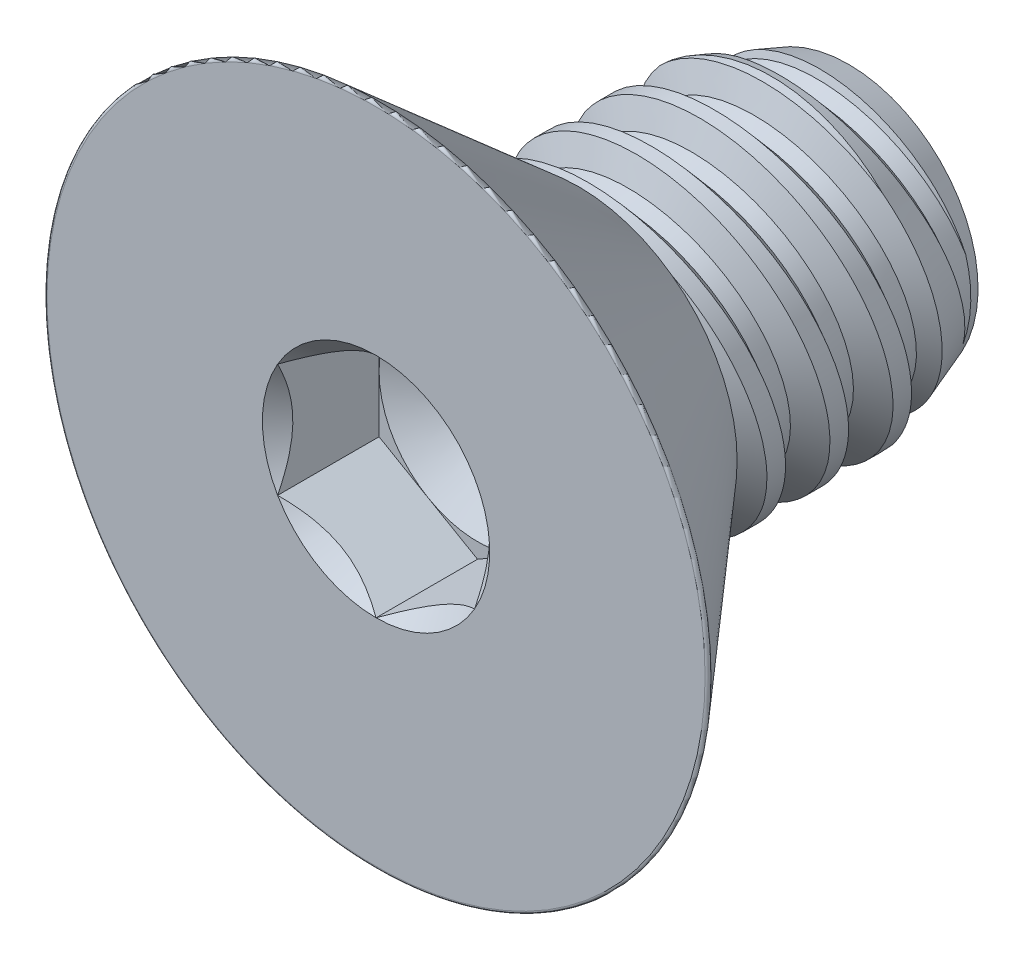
ISO-10303-21;
HEADER;
FILE_DESCRIPTION(('STEP AP214'),'2;1');
FILE_NAME('part.step','',(''),(''),'','','');
FILE_SCHEMA(('AUTOMOTIVE_DESIGN { 1 0 10303 214 1 1 1 1 }'));
ENDSEC;
DATA;
#1=APPLICATION_CONTEXT('core data for automotive mechanical design processes');
#2=APPLICATION_PROTOCOL_DEFINITION('international standard','automotive_design',2000,#1);
#3=PRODUCT_CONTEXT('',#1,'mechanical');
#4=PRODUCT('Part','Part','',(#3));
#5=PRODUCT_RELATED_PRODUCT_CATEGORY('part','',(#4));
#6=PRODUCT_DEFINITION_FORMATION('','',#4);
#7=PRODUCT_DEFINITION_CONTEXT('part definition',#1,'design');
#8=PRODUCT_DEFINITION('design','',#6,#7);
#9=PRODUCT_DEFINITION_SHAPE('','',#8);
#10=(LENGTH_UNIT() NAMED_UNIT(*) SI_UNIT(.MILLI.,.METRE.));
#11=(NAMED_UNIT(*) PLANE_ANGLE_UNIT() SI_UNIT($,.RADIAN.));
#12=(NAMED_UNIT(*) SI_UNIT($,.STERADIAN.) SOLID_ANGLE_UNIT());
#13=UNCERTAINTY_MEASURE_WITH_UNIT(LENGTH_MEASURE(1.E-05),#10,'distance_accuracy_value','');
#14=(GEOMETRIC_REPRESENTATION_CONTEXT(3) GLOBAL_UNCERTAINTY_ASSIGNED_CONTEXT((#13)) GLOBAL_UNIT_ASSIGNED_CONTEXT((#10,
#11,#12)) REPRESENTATION_CONTEXT('',''));
#15=CARTESIAN_POINT('',(0.,0.,0.));
#16=DIRECTION('',(0.,0.,1.));
#17=DIRECTION('',(1.,0.,0.));
#18=AXIS2_PLACEMENT_3D('',#15,#16,#17);
#19=CARTESIAN_POINT('',(1.984375,-3.43703832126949,2.0447));
#20=DIRECTION('',(0.,0.,1.));
#21=DIRECTION('',(1.,0.,0.));
#22=AXIS2_PLACEMENT_3D('',#19,#20,#21);
#23=PLANE('',#22);
#24=CARTESIAN_POINT('',(0.,0.,2.0447));
#25=DIRECTION('',(0.,0.,1.));
#26=DIRECTION('',(1.,0.,0.));
#27=AXIS2_PLACEMENT_3D('',#24,#25,#26);
#28=CIRCLE('',#27,1.984375);
#29=CARTESIAN_POINT('',(1.984375,0.,2.0447));
#30=VERTEX_POINT('',#29);
#31=CARTESIAN_POINT('',(0.9921875,1.71851916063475,2.0447));
#32=VERTEX_POINT('',#31);
#33=EDGE_CURVE('E42',#30,#32,#28,.T.);
#34=ORIENTED_EDGE('',*,*,#33,.F.);
#35=DIRECTION('',(0.,1.,0.));
#36=VECTOR('',#35,1.);
#37=CARTESIAN_POINT('',(1.984375,-1.14567944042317,2.0447));
#38=LINE('',#37,#36);
#39=CARTESIAN_POINT('',(1.984375,1.14567944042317,2.0447));
#40=VERTEX_POINT('',#39);
#41=EDGE_CURVE('E160',#30,#40,#38,.T.);
#42=ORIENTED_EDGE('',*,*,#41,.T.);
#43=DIRECTION('',(-0.866025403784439,0.5,0.));
#44=VECTOR('',#43,1.);
#45=CARTESIAN_POINT('',(1.984375,1.14567944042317,2.0447));
#46=LINE('',#45,#44);
#47=EDGE_CURVE('E163',#40,#32,#46,.T.);
#48=ORIENTED_EDGE('',*,*,#47,.T.);
#49=EDGE_LOOP('',(#34,#42,#48));
#50=FACE_BOUND('',#49,.T.);
#51=ADVANCED_FACE('F30',(#50),#23,.T.);
#52=CARTESIAN_POINT('',(-0.9921875,1.71851916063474,2.0447));
#53=VERTEX_POINT('',#52);
#54=EDGE_CURVE('E11',#32,#53,#28,.T.);
#55=ORIENTED_EDGE('',*,*,#54,.F.);
#56=CARTESIAN_POINT('',(0.,2.29135888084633,2.0447));
#57=VERTEX_POINT('',#56);
#58=EDGE_CURVE('E177',#32,#57,#46,.T.);
#59=ORIENTED_EDGE('',*,*,#58,.T.);
#60=DIRECTION('',(-0.866025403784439,-0.5,0.));
#61=VECTOR('',#60,1.);
#62=CARTESIAN_POINT('',(0.,2.29135888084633,2.0447));
#63=LINE('',#62,#61);
#64=EDGE_CURVE('E183',#57,#53,#63,.T.);
#65=ORIENTED_EDGE('',*,*,#64,.T.);
#66=EDGE_LOOP('',(#55,#59,#65));
#67=FACE_BOUND('',#66,.T.);
#68=ADVANCED_FACE('F404',(#67),#23,.T.);
#69=CARTESIAN_POINT('',(-1.984375,0.,2.0447));
#70=VERTEX_POINT('',#69);
#71=EDGE_CURVE('E40',#53,#70,#28,.T.);
#72=ORIENTED_EDGE('',*,*,#71,.F.);
#73=CARTESIAN_POINT('',(-1.984375,1.14567944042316,2.0447));
#74=VERTEX_POINT('',#73);
#75=EDGE_CURVE('E182',#53,#74,#63,.T.);
#76=ORIENTED_EDGE('',*,*,#75,.T.);
#77=DIRECTION('',(0.,-1.,0.));
#78=VECTOR('',#77,1.);
#79=CARTESIAN_POINT('',(-1.984375,1.14567944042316,2.0447));
#80=LINE('',#79,#78);
#81=EDGE_CURVE('E187',#74,#70,#80,.T.);
#82=ORIENTED_EDGE('',*,*,#81,.T.);
#83=EDGE_LOOP('',(#72,#76,#82));
#84=FACE_BOUND('',#83,.T.);
#85=ADVANCED_FACE('F409',(#84),#23,.T.);
#86=CARTESIAN_POINT('',(-0.992187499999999,-1.71851916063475,2.0447));
#87=VERTEX_POINT('',#86);
#88=EDGE_CURVE('E441',#70,#87,#28,.T.);
#89=ORIENTED_EDGE('',*,*,#88,.F.);
#90=CARTESIAN_POINT('',(-1.984375,-1.14567944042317,2.0447));
#91=VERTEX_POINT('',#90);
#92=EDGE_CURVE('E186',#70,#91,#80,.T.);
#93=ORIENTED_EDGE('',*,*,#92,.T.);
#94=DIRECTION('',(0.866025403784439,-0.5,0.));
#95=VECTOR('',#94,1.);
#96=CARTESIAN_POINT('',(-1.984375,-1.14567944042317,2.0447));
#97=LINE('',#96,#95);
#98=EDGE_CURVE('E446',#91,#87,#97,.T.);
#99=ORIENTED_EDGE('',*,*,#98,.T.);
#100=EDGE_LOOP('',(#89,#93,#99));
#101=FACE_BOUND('',#100,.T.);
#102=ADVANCED_FACE('F427',(#101),#23,.T.);
#103=CARTESIAN_POINT('',(0.9921875,-1.71851916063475,2.0447));
#104=VERTEX_POINT('',#103);
#105=EDGE_CURVE('E49',#87,#104,#28,.T.);
#106=ORIENTED_EDGE('',*,*,#105,.F.);
#107=CARTESIAN_POINT('',(0.,-2.29135888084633,2.0447));
#108=VERTEX_POINT('',#107);
#109=EDGE_CURVE('E438',#87,#108,#97,.T.);
#110=ORIENTED_EDGE('',*,*,#109,.T.);
#111=DIRECTION('',(0.866025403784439,0.5,0.));
#112=VECTOR('',#111,1.);
#113=CARTESIAN_POINT('',(0.,-2.29135888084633,2.0447));
#114=LINE('',#113,#112);
#115=EDGE_CURVE('E172',#108,#104,#114,.T.);
#116=ORIENTED_EDGE('',*,*,#115,.T.);
#117=EDGE_LOOP('',(#106,#110,#116));
#118=FACE_BOUND('',#117,.T.);
#119=ADVANCED_FACE('F416',(#118),#23,.T.);
#120=CARTESIAN_POINT('',(0.,0.,0.));
#121=DIRECTION('',(0.,0.,-1.));
#122=DIRECTION('',(0.,1.,0.));
#123=AXIS2_PLACEMENT_3D('',#120,#121,#122);
#124=CYLINDRICAL_SURFACE('',#123,3.175);
#125=CARTESIAN_POINT('',(0.,0.,0.));
#126=DIRECTION('',(0.,0.,-1.));
#127=DIRECTION('',(0.,1.,0.));
#128=AXIS2_PLACEMENT_3D('',#125,#126,#127);
#129=CIRCLE('',#128,3.175);
#130=CARTESIAN_POINT('',(2.6933588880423,-1.68120281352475,0.));
#131=VERTEX_POINT('',#130);
#132=CARTESIAN_POINT('',(-2.6933588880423,-1.68120281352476,0.));
#133=VERTEX_POINT('',#132);
#134=EDGE_CURVE('E317',#131,#133,#129,.T.);
#135=ORIENTED_EDGE('',*,*,#134,.T.);
#136=CARTESIAN_POINT('',(-3.12680695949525,0.551092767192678,0.473351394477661));
#137=CARTESIAN_POINT('',(-3.14262002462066,0.461421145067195,0.453496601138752));
#138=CARTESIAN_POINT('',(-3.15455741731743,0.37107627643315,0.433602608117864));
#139=CARTESIAN_POINT('',(-3.17063464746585,0.189677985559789,0.393874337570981));
#140=CARTESIAN_POINT('',(-3.17477414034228,0.0986245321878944,0.374040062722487));
#141=CARTESIAN_POINT('',(-3.17520851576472,-0.0837805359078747,0.334520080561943));
#142=CARTESIAN_POINT('',(-3.17148308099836,-0.175132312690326,0.314834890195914));
#143=CARTESIAN_POINT('',(-3.15616108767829,-0.35723905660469,0.27580011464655));
#144=CARTESIAN_POINT('',(-3.14456511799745,-0.447994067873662,0.2564505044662));
#145=CARTESIAN_POINT('',(-3.11369600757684,-0.627491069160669,0.21837692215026));
#146=CARTESIAN_POINT('',(-3.09448910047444,-0.716243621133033,0.199649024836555));
#147=CARTESIAN_POINT('',(-3.04850789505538,-0.891888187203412,0.162767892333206));
#148=CARTESIAN_POINT('',(-3.02173380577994,-0.97878025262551,0.144614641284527));
#149=CARTESIAN_POINT('',(-2.96087942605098,-1.14979649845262,0.109054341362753));
#150=CARTESIAN_POINT('',(-2.92682262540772,-1.23392859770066,0.091645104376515));
#151=CARTESIAN_POINT('',(-2.85157256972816,-1.3990638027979,0.0576261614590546));
#152=CARTESIAN_POINT('',(-2.81038376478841,-1.48006882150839,0.0410159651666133));
#153=CARTESIAN_POINT('',(-2.74275218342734,-1.60004439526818,0.0165174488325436));
#154=CARTESIAN_POINT('',(-2.71881627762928,-1.64039063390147,0.00829738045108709));
#155=CARTESIAN_POINT('',(-2.59974569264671,-1.83128077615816,-0.0305118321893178));
#156=CARTESIAN_POINT('',(-2.49246140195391,-1.97489363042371,-0.0594587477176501));
#157=CARTESIAN_POINT('',(-2.25457522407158,-2.24270565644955,-0.113089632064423));
#158=CARTESIAN_POINT('',(-2.12391558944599,-2.36685528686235,-0.137762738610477));
#159=CARTESIAN_POINT('',(-1.84326813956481,-2.59136552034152,-0.182152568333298));
#160=CARTESIAN_POINT('',(-1.69332663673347,-2.69178153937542,-0.201880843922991));
#161=CARTESIAN_POINT('',(-1.37823280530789,-2.86591785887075,-0.235966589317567));
#162=CARTESIAN_POINT('',(-1.21309030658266,-2.93965526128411,-0.250327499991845));
#163=CARTESIAN_POINT('',(-0.875350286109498,-3.05708768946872,-0.273148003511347));
#164=CARTESIAN_POINT('',(-0.702935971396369,-3.10129036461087,-0.281707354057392));
#165=CARTESIAN_POINT('',(-0.352949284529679,-3.16030738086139,-0.293127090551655));
#166=CARTESIAN_POINT('',(-0.175376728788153,-3.17512067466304,-0.295987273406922));
#167=CARTESIAN_POINT('',(0.177807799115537,-3.17487914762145,-0.295940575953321));
#168=CARTESIAN_POINT('',(0.353420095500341,-3.16014733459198,-0.293096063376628));
#169=CARTESIAN_POINT('',(0.699609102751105,-3.10193135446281,-0.281831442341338));
#170=CARTESIAN_POINT('',(0.870186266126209,-3.05844977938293,-0.273411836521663));
#171=CARTESIAN_POINT('',(1.20143042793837,-2.94412502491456,-0.2511969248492));
#172=CARTESIAN_POINT('',(1.36210261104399,-2.87329630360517,-0.237404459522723));
#173=CARTESIAN_POINT('',(1.66925642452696,-2.70643150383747,-0.204754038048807));
#174=CARTESIAN_POINT('',(1.81573333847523,-2.61038708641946,-0.185894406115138));
#175=CARTESIAN_POINT('',(2.09994222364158,-2.38862540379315,-0.142083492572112));
#176=CARTESIAN_POINT('',(2.23639405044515,-2.26132976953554,-0.116804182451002));
#177=CARTESIAN_POINT('',(2.48452462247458,-1.98548396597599,-0.0615929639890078));
#178=CARTESIAN_POINT('',(2.59621423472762,-1.83694316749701,-0.0316631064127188));
#179=CARTESIAN_POINT('',(2.77228839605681,-1.55466515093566,0.0257259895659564));
#180=CARTESIAN_POINT('',(2.84166330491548,-1.42385932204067,0.0524927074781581));
#181=CARTESIAN_POINT('',(2.96143844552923,-1.15422331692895,0.108096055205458));
#182=CARTESIAN_POINT('',(3.01184385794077,-1.01539534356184,0.136932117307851));
#183=CARTESIAN_POINT('',(3.07707758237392,-0.787598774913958,0.184637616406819));
#184=CARTESIAN_POINT('',(3.09811751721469,-0.700249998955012,0.203018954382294));
#185=CARTESIAN_POINT('',(3.13272029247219,-0.524151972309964,0.240265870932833));
#186=CARTESIAN_POINT('',(3.1462817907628,-0.435402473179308,0.259131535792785));
#187=CARTESIAN_POINT('',(3.16585822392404,-0.256976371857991,0.297258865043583));
#188=CARTESIAN_POINT('',(3.17185801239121,-0.167298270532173,0.316521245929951));
#189=CARTESIAN_POINT('',(3.1762470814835,0.0121798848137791,0.35527655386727));
#190=CARTESIAN_POINT('',(3.1746375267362,0.1019799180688,0.374769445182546));
#191=CARTESIAN_POINT('',(3.16921717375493,0.191539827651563,0.39431616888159));
#192=B_SPLINE_CURVE_WITH_KNOTS('',3,(#136,#137,#138,#139,#140,#141,#142,#143,#144,#145,#146,
#147,#148,#149,#150,#151,#152,#153,#154,#155,#156,#157,#158,#159,#160,#161,#162,#163,#164,#165,
#166,#167,#168,#169,#170,#171,#172,#173,#174,#175,#176,#177,#178,#179,#180,#181,#182,#183,#184,
#185,#186,#187,#188,#189,#190,#191),.UNSPECIFIED.,.F.,.F.,(4,2,2,2,2,2,2,2,2,2,2,2,2,2,2,2,2,2,
2,2,2,2,2,2,2,2,2,4),(0.,0.279500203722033,0.55901275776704,0.839248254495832,1.11946278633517,
1.39729051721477,1.67511057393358,1.95204770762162,2.22881266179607,2.3716760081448,
2.91352965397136,3.45674088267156,3.99867094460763,4.54025299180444,5.07226876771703,
5.60430350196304,6.1305533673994,6.65675579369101,7.18268040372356,7.70877915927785,
8.27080252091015,8.83257874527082,9.28262570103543,9.73254965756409,10.0073949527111,
10.2822895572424,10.5577339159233,10.8331361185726),.UNSPECIFIED.);
#193=EDGE_CURVE('E220',#133,#131,#192,.T.);
#194=ORIENTED_EDGE('',*,*,#193,.T.);
#195=EDGE_LOOP('',(#135,#194));
#196=FACE_BOUND('',#195,.T.);
#197=ADVANCED_FACE('F32',(#196),#124,.T.);
#198=CARTESIAN_POINT('',(-2.58012691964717,-1.85028918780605,-1.30427181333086));
#199=CARTESIAN_POINT('',(-2.47648524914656,-1.99479904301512,-1.33347419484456));
#200=CARTESIAN_POINT('',(-2.3604200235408,-2.13093837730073,-1.36076001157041));
#201=CARTESIAN_POINT('',(-2.10648607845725,-2.38229216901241,-1.41083755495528));
#202=CARTESIAN_POINT('',(-1.96859505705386,-2.49748496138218,-1.43362463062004));
#203=CARTESIAN_POINT('',(-1.67510368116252,-2.70308805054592,-1.47411026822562));
#204=CARTESIAN_POINT('',(-1.51953477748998,-2.79354141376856,-1.49181767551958));
#205=CARTESIAN_POINT('',(-1.19496280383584,-2.94701630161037,-1.52176841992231));
#206=CARTESIAN_POINT('',(-1.02596344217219,-3.01004536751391,-1.5340132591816));
#207=CARTESIAN_POINT('',(-0.682367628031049,-3.10584492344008,-1.55259386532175));
#208=CARTESIAN_POINT('',(-0.507913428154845,-3.13910727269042,-1.55902570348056));
#209=CARTESIAN_POINT('',(-0.155786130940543,-3.17611266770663,-1.56618002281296));
#210=CARTESIAN_POINT('',(0.0218868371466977,-3.179856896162,-1.56690273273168));
#211=CARTESIAN_POINT('',(0.373694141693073,-3.15780972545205,-1.56264183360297));
#212=CARTESIAN_POINT('',(0.547845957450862,-3.1322859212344,-1.55770992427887));
#213=CARTESIAN_POINT('',(0.889320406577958,-3.05294267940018,-1.54233814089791));
#214=CARTESIAN_POINT('',(1.05664310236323,-2.99912350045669,-1.53189831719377));
#215=CARTESIAN_POINT('',(1.38005086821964,-2.8647508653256,-1.5057285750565));
#216=CARTESIAN_POINT('',(1.53611733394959,-2.78415433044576,-1.48999013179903));
#217=CARTESIAN_POINT('',(1.83245764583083,-2.59870760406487,-1.45358473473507));
#218=CARTESIAN_POINT('',(1.97273080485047,-2.49385635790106,-1.43291756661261));
#219=CARTESIAN_POINT('',(2.23530209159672,-2.26166288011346,-1.38685062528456));
#220=CARTESIAN_POINT('',(2.35737212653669,-2.13407319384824,-1.36139859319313));
#221=CARTESIAN_POINT('',(2.57840400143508,-1.86100052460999,-1.30650190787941));
#222=CARTESIAN_POINT('',(2.67736385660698,-1.71551600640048,-1.27705691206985));
#223=CARTESIAN_POINT('',(2.85129222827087,-1.40801914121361,-1.21427621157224));
#224=CARTESIAN_POINT('',(2.92579423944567,-1.24575536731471,-1.18087974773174));
#225=CARTESIAN_POINT('',(3.04651380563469,-0.911566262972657,-1.11142676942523));
#226=CARTESIAN_POINT('',(3.09272849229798,-0.739639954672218,-1.07536998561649));
#227=CARTESIAN_POINT('',(3.15642107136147,-0.387587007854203,-1.00077241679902));
#228=CARTESIAN_POINT('',(3.17334399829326,-0.207367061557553,-0.962197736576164));
#229=CARTESIAN_POINT('',(3.1764245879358,0.153155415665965,-0.884193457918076));
#230=CARTESIAN_POINT('',(3.16257959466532,0.333457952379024,-0.844763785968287));
#231=CARTESIAN_POINT('',(3.10418267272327,0.691332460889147,-0.765655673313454));
#232=CARTESIAN_POINT('',(3.05925981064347,0.868844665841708,-0.725980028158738));
#233=CARTESIAN_POINT('',(2.9394914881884,1.21381777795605,-0.648064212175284));
#234=CARTESIAN_POINT('',(2.86464526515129,1.38127842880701,-0.609824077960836));
#235=CARTESIAN_POINT('',(2.68707885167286,1.70106798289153,-0.536089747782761));
#236=CARTESIAN_POINT('',(2.58439795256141,1.8534178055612,-0.500591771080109));
#237=CARTESIAN_POINT('',(2.35379850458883,2.13866382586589,-0.433561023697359));
#238=CARTESIAN_POINT('',(2.22588197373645,2.27156157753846,-0.402027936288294));
#239=CARTESIAN_POINT('',(1.9507438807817,2.51156573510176,-0.344679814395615));
#240=CARTESIAN_POINT('',(1.80390103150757,2.61908429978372,-0.318774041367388));
#241=CARTESIAN_POINT('',(1.49330931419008,2.8077844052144,-0.273069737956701));
#242=CARTESIAN_POINT('',(1.32956327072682,2.88897033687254,-0.253270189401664));
#243=CARTESIAN_POINT('',(0.994580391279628,3.02041883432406,-0.221104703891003));
#244=CARTESIAN_POINT('',(0.823667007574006,3.07146011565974,-0.208551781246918));
#245=CARTESIAN_POINT('',(0.475353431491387,3.14424949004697,-0.190625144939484));
#246=CARTESIAN_POINT('',(0.297954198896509,3.16600189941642,-0.185250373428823));
#247=CARTESIAN_POINT('',(-0.0541576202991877,3.17931747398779,-0.181961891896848));
#248=CARTESIAN_POINT('',(-0.228844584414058,3.17152775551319,-0.183888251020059));
#249=CARTESIAN_POINT('',(-0.574356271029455,3.1274696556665,-0.194758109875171));
#250=CARTESIAN_POINT('',(-0.745181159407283,3.09120249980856,-0.203701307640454));
#251=CARTESIAN_POINT('',(-1.07758958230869,2.99156061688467,-0.228172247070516));
#252=CARTESIAN_POINT('',(-1.2392022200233,2.92827731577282,-0.243677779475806));
#253=CARTESIAN_POINT('',(-1.54944804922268,2.7766266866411,-0.280625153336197));
#254=CARTESIAN_POINT('',(-1.69808033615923,2.68825761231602,-0.30206740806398));
#255=CARTESIAN_POINT('',(-1.98086853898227,2.48743976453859,-0.35045095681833));
#256=CARTESIAN_POINT('',(-2.11474258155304,2.37461495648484,-0.377477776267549));
#257=CARTESIAN_POINT('',(-2.36174434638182,2.12911292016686,-0.435792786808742));
#258=CARTESIAN_POINT('',(-2.47486931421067,1.99643306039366,-0.467081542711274));
#259=CARTESIAN_POINT('',(-2.68034674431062,1.71116299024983,-0.533724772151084));
#260=CARTESIAN_POINT('',(-2.77206603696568,1.55813676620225,-0.569165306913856));
#261=CARTESIAN_POINT('',(-2.92851164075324,1.23934677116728,-0.642235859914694));
#262=CARTESIAN_POINT('',(-2.99323558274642,1.07358188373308,-0.679866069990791));
#263=CARTESIAN_POINT('',(-3.09524577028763,0.730000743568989,-0.757031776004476));
#264=CARTESIAN_POINT('',(-3.13188659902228,0.551997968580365,-0.796591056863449));
#265=CARTESIAN_POINT('',(-3.17434385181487,0.192285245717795,-0.875662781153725));
#266=CARTESIAN_POINT('',(-3.18015057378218,0.0105741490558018,-0.915175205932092));
#267=CARTESIAN_POINT('',(-3.16060800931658,-0.353040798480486,-0.993408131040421));
#268=CARTESIAN_POINT('',(-3.13497939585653,-0.534931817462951,-1.03211837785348));
#269=CARTESIAN_POINT('',(-3.05265084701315,-0.891859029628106,-1.10732203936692));
#270=CARTESIAN_POINT('',(-2.99598911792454,-1.06690336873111,-1.14381811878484));
#271=CARTESIAN_POINT('',(-2.87888232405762,-1.34405331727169,-1.20108313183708));
#272=CARTESIAN_POINT('',(-2.82714416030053,-1.44972928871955,-1.22278358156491));
#273=CARTESIAN_POINT('',(-2.71213451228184,-1.65492717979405,-1.26469429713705));
#274=CARTESIAN_POINT('',(-2.64886293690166,-1.7544490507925,-1.28490455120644));
#275=CARTESIAN_POINT('',(-2.58012691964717,-1.85028918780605,-1.30427181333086));
#276=B_SPLINE_CURVE_WITH_KNOTS('',3,(#198,#199,#200,#201,#202,#203,#204,#205,#206,#207,#208,
#209,#210,#211,#212,#213,#214,#215,#216,#217,#218,#219,#220,#221,#222,#223,#224,#225,#226,#227,
#228,#229,#230,#231,#232,#233,#234,#235,#236,#237,#238,#239,#240,#241,#242,#243,#244,#245,#246,
#247,#248,#249,#250,#251,#252,#253,#254,#255,#256,#257,#258,#259,#260,#261,#262,#263,#264,#265,
#266,#267,#268,#269,#270,#271,#272,#273,#274,#275),.UNSPECIFIED.,.T.,.F.,(4,2,2,2,2,2,2,2,2,2,2,
2,2,2,2,2,2,2,2,2,2,2,2,2,2,2,2,2,2,2,2,2,2,2,2,2,2,2,4),(0.,0.540213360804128,1.08098232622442,
1.62080384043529,2.16047681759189,2.69105826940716,3.22161846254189,3.74736620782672,
4.27310914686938,4.79970201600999,5.32631778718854,5.85905984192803,6.39184763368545,
6.93427582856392,7.47675901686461,8.0294120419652,8.58211277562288,9.14152678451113,
9.70095505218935,10.2595977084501,10.8181957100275,11.3669783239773,11.9156693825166,
12.4494843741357,12.9832206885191,13.5053338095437,14.0274244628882,14.547762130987,
15.0681360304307,15.5971644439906,16.1262630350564,16.6694470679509,17.212678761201,
17.7680490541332,18.3235940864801,18.8841115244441,19.4439404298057,19.8022115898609,
20.1604855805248),.UNSPECIFIED.);
#277=CARTESIAN_POINT('',(-2.58012691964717,-1.85028918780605,-1.30427181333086));
#278=VERTEX_POINT('',#277);
#279=EDGE_CURVE('E350',#278,#278,#276,.T.);
#280=ORIENTED_EDGE('',*,*,#279,.T.);
#281=EDGE_LOOP('',(#280));
#282=FACE_BOUND('',#281,.T.);
#283=CARTESIAN_POINT('',(-1.79859251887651,2.61642694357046,0.));
#284=VERTEX_POINT('',#283);
#285=CARTESIAN_POINT('',(1.7985925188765,2.61642694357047,0.));
#286=VERTEX_POINT('',#285);
#287=EDGE_CURVE('E378',#284,#286,#129,.T.);
#288=ORIENTED_EDGE('',*,*,#287,.T.);
#289=CARTESIAN_POINT('',(0.350976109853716,3.15554128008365,0.105158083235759));
#290=CARTESIAN_POINT('',(0.438586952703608,3.14580710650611,0.103275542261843));
#291=CARTESIAN_POINT('',(0.525772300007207,3.13240625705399,0.100684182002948));
#292=CARTESIAN_POINT('',(0.698706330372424,3.09841648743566,0.0941042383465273));
#293=CARTESIAN_POINT('',(0.784454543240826,3.07782526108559,0.0901152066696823));
#294=CARTESIAN_POINT('',(0.953386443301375,3.02974454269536,0.0807883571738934));
#295=CARTESIAN_POINT('',(1.03658200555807,3.00229523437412,0.0754583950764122));
#296=CARTESIAN_POINT('',(1.20030158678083,2.94067134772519,0.0634724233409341));
#297=CARTESIAN_POINT('',(1.28082677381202,2.90649975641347,0.0568170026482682));
#298=CARTESIAN_POINT('',(1.43590538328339,2.83300162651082,0.0424732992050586));
#299=CARTESIAN_POINT('',(1.51056926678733,2.79389962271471,0.0348297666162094));
#300=CARTESIAN_POINT('',(1.65649964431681,2.70993309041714,0.0183794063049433));
#301=CARTESIAN_POINT('',(1.72776347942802,2.66506415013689,0.00957168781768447));
#302=CARTESIAN_POINT('',(1.94400502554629,2.51657591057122,-0.0196504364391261));
#303=CARTESIAN_POINT('',(2.08230949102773,2.40336180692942,-0.04203110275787));
#304=CARTESIAN_POINT('',(2.3377411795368,2.15576665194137,-0.0913203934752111));
#305=CARTESIAN_POINT('',(2.45483598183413,2.02135377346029,-0.118235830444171));
#306=CARTESIAN_POINT('',(2.66472707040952,1.73531684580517,-0.175980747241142));
#307=CARTESIAN_POINT('',(2.75750632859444,1.58368084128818,-0.206812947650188));
#308=CARTESIAN_POINT('',(2.9163062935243,1.26769607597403,-0.271648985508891));
#309=CARTESIAN_POINT('',(2.98233414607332,1.10335072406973,-0.305651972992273));
#310=CARTESIAN_POINT('',(3.08715399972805,0.763150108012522,-0.376735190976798));
#311=CARTESIAN_POINT('',(3.1253870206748,0.58713241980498,-0.413862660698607));
#312=CARTESIAN_POINT('',(3.17162545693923,0.231484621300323,-0.489674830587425));
#313=CARTESIAN_POINT('',(3.17962591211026,0.051853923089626,-0.528359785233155));
#314=CARTESIAN_POINT('',(3.16517299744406,-0.308825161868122,-0.606874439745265));
#315=CARTESIAN_POINT('',(3.14225087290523,-0.489853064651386,-0.646712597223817));
#316=CARTESIAN_POINT('',(3.06576445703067,-0.845454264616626,-0.725815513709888));
#317=CARTESIAN_POINT('',(3.01219877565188,-1.02002726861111,-0.765080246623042));
#318=CARTESIAN_POINT('',(2.8755252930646,-1.35846086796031,-0.841983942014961));
#319=CARTESIAN_POINT('',(2.79229852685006,-1.52227513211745,-0.879615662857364));
#320=CARTESIAN_POINT('',(2.5984887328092,-1.83360220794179,-0.951808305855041));
#321=CARTESIAN_POINT('',(2.48790681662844,-1.98111568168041,-0.98636935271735));
#322=CARTESIAN_POINT('',(2.2438023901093,-2.25367272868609,-1.05074767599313));
#323=CARTESIAN_POINT('',(2.11057184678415,-2.37896525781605,-1.0806170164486));
#324=CARTESIAN_POINT('',(1.82389352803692,-2.60525807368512,-1.13491636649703));
#325=CARTESIAN_POINT('',(1.67044865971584,-2.70626184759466,-1.15934715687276));
#326=CARTESIAN_POINT('',(1.35180761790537,-2.87840358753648,-1.20118223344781));
#327=CARTESIAN_POINT('',(1.18700379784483,-2.95022847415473,-1.21874770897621));
#328=CARTESIAN_POINT('',(0.847110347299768,-3.06515843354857,-1.24693308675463));
#329=CARTESIAN_POINT('',(0.672022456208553,-3.10826834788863,-1.25755415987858));
#330=CARTESIAN_POINT('',(0.321341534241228,-3.16355345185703,-1.27118632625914));
#331=CARTESIAN_POINT('',(0.145875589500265,-3.17649052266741,-1.27438483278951));
#332=CARTESIAN_POINT('',(-0.204761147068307,-3.17323643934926,-1.27358110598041));
#333=CARTESIAN_POINT('',(-0.379931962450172,-3.15704773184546,-1.26957947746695));
#334=CARTESIAN_POINT('',(-0.723039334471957,-3.09642792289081,-1.25463815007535));
#335=CARTESIAN_POINT('',(-0.891033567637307,-3.05230354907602,-1.24377380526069));
#336=CARTESIAN_POINT('',(-1.21712477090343,-2.93753521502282,-1.21564318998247));
#337=CARTESIAN_POINT('',(-1.37522142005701,-2.86689039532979,-1.19837671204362));
#338=CARTESIAN_POINT('',(-1.67884822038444,-2.70043946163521,-1.15794060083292));
#339=CARTESIAN_POINT('',(-1.82423392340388,-2.60438432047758,-1.13471261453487));
#340=CARTESIAN_POINT('',(-2.09686654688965,-2.39036002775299,-1.08334560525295));
#341=CARTESIAN_POINT('',(-2.22411136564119,-2.27238834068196,-1.05520601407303));
#342=CARTESIAN_POINT('',(-2.46021899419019,-2.01475138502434,-0.994282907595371));
#343=CARTESIAN_POINT('',(-2.56855108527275,-1.87462286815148,-0.961401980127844));
#344=CARTESIAN_POINT('',(-2.76023153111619,-1.57886461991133,-0.892679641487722));
#345=CARTESIAN_POINT('',(-2.84357652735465,-1.4232328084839,-0.856837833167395));
#346=CARTESIAN_POINT('',(-2.98506062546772,-1.09659031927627,-0.782389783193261));
#347=CARTESIAN_POINT('',(-3.04250507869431,-0.925289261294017,-0.743736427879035));
#348=CARTESIAN_POINT('',(-3.12757209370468,-0.575593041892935,-0.665685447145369));
#349=CARTESIAN_POINT('',(-3.15519175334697,-0.39719719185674,-0.626287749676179));
#350=CARTESIAN_POINT('',(-3.18003655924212,-0.035686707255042,-0.547308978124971));
#351=CARTESIAN_POINT('',(-3.17682895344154,0.147459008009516,-0.507733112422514));
#352=CARTESIAN_POINT('',(-3.13896131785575,0.510791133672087,-0.430042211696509));
#353=CARTESIAN_POINT('',(-3.10430132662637,0.690977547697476,-0.391927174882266));
#354=CARTESIAN_POINT('',(-3.00440913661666,1.04284960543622,-0.318217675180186));
#355=CARTESIAN_POINT('',(-2.93923315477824,1.2145502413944,-0.282618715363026));
#356=CARTESIAN_POINT('',(-2.77995047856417,1.5446957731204,-0.214763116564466));
#357=CARTESIAN_POINT('',(-2.68584483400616,1.70314114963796,-0.182506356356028));
#358=CARTESIAN_POINT('',(-2.47204727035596,2.0007285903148,-0.122374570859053));
#359=CARTESIAN_POINT('',(-2.35256112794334,2.1400118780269,-0.0944672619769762));
#360=CARTESIAN_POINT('',(-2.09084801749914,2.39635397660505,-0.0434165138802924));
#361=CARTESIAN_POINT('',(-1.94862159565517,2.51341332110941,-0.0202729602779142));
#362=CARTESIAN_POINT('',(-1.65188177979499,2.71716322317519,0.0198247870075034));
#363=CARTESIAN_POINT('',(-1.498121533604,2.80491101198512,0.0369956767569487));
#364=CARTESIAN_POINT('',(-1.17780998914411,2.95372516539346,0.0660282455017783));
#365=CARTESIAN_POINT('',(-1.01127211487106,3.01481909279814,0.0778954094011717));
#366=CARTESIAN_POINT('',(-0.750974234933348,3.08632123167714,0.0917617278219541));
#367=CARTESIAN_POINT('',(-0.660030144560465,3.10703693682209,0.0957737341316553));
#368=CARTESIAN_POINT('',(-0.476765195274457,3.14037824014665,0.102226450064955));
#369=CARTESIAN_POINT('',(-0.384446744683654,3.15301659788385,0.104669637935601));
#370=CARTESIAN_POINT('',(-0.291691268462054,3.1615725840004,0.10632408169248));
#371=B_SPLINE_CURVE_WITH_KNOTS('',3,(#289,#290,#291,#292,#293,#294,#295,#296,#297,#298,#299,
#300,#301,#302,#303,#304,#305,#306,#307,#308,#309,#310,#311,#312,#313,#314,#315,#316,#317,#318,
#319,#320,#321,#322,#323,#324,#325,#326,#327,#328,#329,#330,#331,#332,#333,#334,#335,#336,#337,
#338,#339,#340,#341,#342,#343,#344,#345,#346,#347,#348,#349,#350,#351,#352,#353,#354,#355,#356,
#357,#358,#359,#360,#361,#362,#363,#364,#365,#366,#367,#368,#369,#370),.UNSPECIFIED.,.F.,.F.,(4,
2,2,2,2,2,2,2,2,2,2,2,2,2,2,2,2,2,2,2,2,2,2,2,2,2,2,2,2,2,2,2,2,2,2,2,2,2,2,2,4),(0.,
0.264427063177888,0.528939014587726,0.791936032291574,1.05481645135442,1.30841773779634,
1.56221420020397,2.09978764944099,2.63817601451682,3.17694040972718,3.71556079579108,
4.2647343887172,4.81399807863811,5.37168229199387,5.92939180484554,6.48936383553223,
7.04931311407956,7.60252646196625,8.15566033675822,8.69488997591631,9.23402867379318,
9.7593991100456,10.2847254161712,10.8043814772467,11.3240543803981,11.8490220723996,
12.3740505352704,12.9120270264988,13.4500757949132,14.0018028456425,14.5535835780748,
15.1131213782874,15.672658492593,16.2311688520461,16.7896589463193,17.3437829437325,
17.8978936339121,18.4290480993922,18.9596519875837,19.2394023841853,19.5187097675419),.UNSPECIFIED.);
#372=EDGE_CURVE('E213',#286,#284,#371,.T.);
#373=ORIENTED_EDGE('',*,*,#372,.T.);
#374=EDGE_LOOP('',(#288,#373));
#375=FACE_BOUND('',#374,.T.);
#376=ADVANCED_FACE('F433',(#282,#375),#124,.T.);
#377=CARTESIAN_POINT('',(0.,0.,-3.8830234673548));
#378=DIRECTION('',(0.,0.,1.));
#379=DIRECTION('',(0.,-1.,0.));
#380=AXIS2_PLACEMENT_3D('',#377,#378,#379);
#381=CONICAL_SURFACE('',#380,3.17500000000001,0.349065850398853);
#382=CARTESIAN_POINT('',(-1.17606850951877,2.99747778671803,-3.75955327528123));
#383=CARTESIAN_POINT('',(-1.24213979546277,2.96978671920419,-3.76407589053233));
#384=CARTESIAN_POINT('',(-1.30718828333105,2.9397787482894,-3.76898074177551));
#385=CARTESIAN_POINT('',(-1.43495370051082,2.8752835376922,-3.77953448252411));
#386=CARTESIAN_POINT('',(-1.49767089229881,2.84079680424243,-3.78518328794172));
#387=CARTESIAN_POINT('',(-1.68140847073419,2.73114455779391,-3.80316671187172));
#388=CARTESIAN_POINT('',(-1.79856830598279,2.64955428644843,-3.81657626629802));
#389=CARTESIAN_POINT('',(-2.02769711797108,2.46485632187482,-3.84703165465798));
#390=CARTESIAN_POINT('',(-2.13875942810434,2.36065687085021,-3.86426376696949));
#391=CARTESIAN_POINT('',(-2.33681915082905,2.14484754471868,-3.90010349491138));
#392=CARTESIAN_POINT('',(-2.42494782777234,2.03424397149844,-3.91853435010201));
#393=CARTESIAN_POINT('',(-2.58498311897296,1.8019920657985,-3.95740842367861));
#394=CARTESIAN_POINT('',(-2.65686840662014,1.68032950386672,-3.9778542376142));
#395=CARTESIAN_POINT('',(-2.79657705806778,1.40126221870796,-4.0249858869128));
#396=CARTESIAN_POINT('',(-2.86019816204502,1.24179965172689,-4.05206777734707));
#397=CARTESIAN_POINT('',(-2.95969676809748,0.914723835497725,-4.10799243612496));
#398=CARTESIAN_POINT('',(-2.99556585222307,0.747108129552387,-4.13683573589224));
#399=CARTESIAN_POINT('',(-3.03888260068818,0.406690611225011,-4.19584424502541));
#400=CARTESIAN_POINT('',(-3.04603986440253,0.233853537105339,-4.22601985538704));
#401=CARTESIAN_POINT('',(-3.03097531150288,-0.110485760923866,-4.28660660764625));
#402=CARTESIAN_POINT('',(-3.00875387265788,-0.28198800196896,-4.31701774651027));
#403=CARTESIAN_POINT('',(-2.93533514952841,-0.619783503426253,-4.37739292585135));
#404=CARTESIAN_POINT('',(-2.88397900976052,-0.786042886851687,-4.40735358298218));
#405=CARTESIAN_POINT('',(-2.7535431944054,-1.1076011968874,-4.46575685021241));
#406=CARTESIAN_POINT('',(-2.67446325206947,-1.26290001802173,-4.49419944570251));
#407=CARTESIAN_POINT('',(-2.49102202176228,-1.55750728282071,-4.54855846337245));
#408=CARTESIAN_POINT('',(-2.38674899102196,-1.69686909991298,-4.57448327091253));
#409=CARTESIAN_POINT('',(-2.1556166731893,-1.95608130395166,-4.62302497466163));
#410=CARTESIAN_POINT('',(-2.02875874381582,-2.07593286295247,-4.64564206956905));
#411=CARTESIAN_POINT('',(-1.75766967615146,-2.29113831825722,-4.68647972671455));
#412=CARTESIAN_POINT('',(-1.61366871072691,-2.38677254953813,-4.70475043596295));
#413=CARTESIAN_POINT('',(-1.31115418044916,-2.55246081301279,-4.73653613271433));
#414=CARTESIAN_POINT('',(-1.15264201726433,-2.62251731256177,-4.75005157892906));
#415=CARTESIAN_POINT('',(-0.828329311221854,-2.73392049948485,-4.77159857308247));
#416=CARTESIAN_POINT('',(-0.662685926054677,-2.77570853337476,-4.77971438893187));
#417=CARTESIAN_POINT('',(-0.326576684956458,-2.83103505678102,-4.79046842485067));
#418=CARTESIAN_POINT('',(-0.156111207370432,-2.84457575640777,-4.79310707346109));
#419=CARTESIAN_POINT('',(0.182714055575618,-2.84298815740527,-4.79279801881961));
#420=CARTESIAN_POINT('',(0.351075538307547,-2.82818735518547,-4.78991413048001));
#421=CARTESIAN_POINT('',(0.682866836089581,-2.77103043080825,-4.7788059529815));
#422=CARTESIAN_POINT('',(0.846296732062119,-2.72867476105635,-4.77058175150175));
#423=CARTESIAN_POINT('',(1.16358135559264,-2.61773687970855,-4.74912939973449));
#424=CARTESIAN_POINT('',(1.3174390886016,-2.54916294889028,-4.73590282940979));
#425=CARTESIAN_POINT('',(1.61142009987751,-2.38785768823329,-4.70495925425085));
#426=CARTESIAN_POINT('',(1.75154273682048,-2.29512523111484,-4.68724203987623));
#427=CARTESIAN_POINT('',(2.01574737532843,-2.0870871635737,-4.64775333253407));
#428=CARTESIAN_POINT('',(2.13963841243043,-1.97154709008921,-4.62593985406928));
#429=CARTESIAN_POINT('',(2.3663010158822,-1.72188874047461,-4.57915277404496));
#430=CARTESIAN_POINT('',(2.46907080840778,-1.58776890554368,-4.55417890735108));
#431=CARTESIAN_POINT('',(2.65228327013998,-1.30246717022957,-4.50147112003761));
#432=CARTESIAN_POINT('',(2.7323478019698,-1.15104931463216,-4.47369984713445));
#433=CARTESIAN_POINT('',(2.86587402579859,-0.837182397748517,-4.41660367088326));
#434=CARTESIAN_POINT('',(2.91933431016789,-0.674732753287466,-4.38727868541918));
#435=CARTESIAN_POINT('',(2.99877458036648,-0.341176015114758,-4.32755073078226));
#436=CARTESIAN_POINT('',(3.02439564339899,-0.169984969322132,-4.29713878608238));
#437=CARTESIAN_POINT('',(3.04623971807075,0.174309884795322,-4.23645195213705));
#438=CARTESIAN_POINT('',(3.04245868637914,0.347413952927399,-4.20617708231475));
#439=CARTESIAN_POINT('',(3.00547075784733,0.691454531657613,-4.14644165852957));
#440=CARTESIAN_POINT('',(2.97212339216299,0.862376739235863,-4.11698568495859));
#441=CARTESIAN_POINT('',(2.87665186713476,1.19625482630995,-4.0598233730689));
#442=CARTESIAN_POINT('',(2.81453951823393,1.35921394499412,-4.03211632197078));
#443=CARTESIAN_POINT('',(2.67453891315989,1.64903115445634,-3.98312141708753));
#444=CARTESIAN_POINT('',(2.60038085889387,1.77765021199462,-3.96149226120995));
#445=CARTESIAN_POINT('',(2.43395059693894,2.02290037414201,-3.92042480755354));
#446=CARTESIAN_POINT('',(2.3416902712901,2.13953926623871,-3.9009850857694));
#447=CARTESIAN_POINT('',(2.15895445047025,2.33865253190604,-3.86791802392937));
#448=CARTESIAN_POINT('',(2.07112461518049,2.42350292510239,-3.85387346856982));
#449=CARTESIAN_POINT('',(1.88577928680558,2.58218897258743,-3.8276736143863));
#450=CARTESIAN_POINT('',(1.78826431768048,2.65602522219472,-3.81551821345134));
#451=CARTESIAN_POINT('',(1.68651819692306,2.72375442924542,-3.80439035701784));
#452=B_SPLINE_CURVE_WITH_KNOTS('',3,(#382,#383,#384,#385,#386,#387,#388,#389,#390,#391,#392,
#393,#394,#395,#396,#397,#398,#399,#400,#401,#402,#403,#404,#405,#406,#407,#408,#409,#410,#411,
#412,#413,#414,#415,#416,#417,#418,#419,#420,#421,#422,#423,#424,#425,#426,#427,#428,#429,#430,
#431,#432,#433,#434,#435,#436,#437,#438,#439,#440,#441,#442,#443,#444,#445,#446,#447,#448,#449,
#450,#451),.UNSPECIFIED.,.F.,.F.,(4,2,2,2,2,2,2,2,2,2,2,2,2,2,2,2,2,2,2,2,2,2,2,2,2,2,2,2,2,2,2,
2,2,2,4),(0.,0.215254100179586,0.430483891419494,0.859155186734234,1.31721769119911,
1.7436972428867,2.1707335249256,2.68965644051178,3.20873669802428,3.73305406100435,
4.25736468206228,4.78456194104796,5.31176427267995,5.8371458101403,6.36249577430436,
6.88145345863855,7.40036106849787,7.91096764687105,8.42153427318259,8.926236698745,
9.43093083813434,9.9354657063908,10.4400241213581,10.9500683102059,11.4601553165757,
11.9782959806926,12.4964640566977,13.0212362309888,13.5460805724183,14.0734318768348,
14.6005668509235,15.0491489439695,15.4974375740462,15.8653530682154,16.233248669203),.UNSPECIFIED.);
#453=CARTESIAN_POINT('',(-2.24242983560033,2.24769513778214,-3.8830234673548));
#454=VERTEX_POINT('',#453);
#455=CARTESIAN_POINT('',(2.24242983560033,2.24769513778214,-3.88302346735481));
#456=VERTEX_POINT('',#455);
#457=EDGE_CURVE('E284',#454,#456,#452,.T.);
#458=ORIENTED_EDGE('',*,*,#457,.F.);
#459=CARTESIAN_POINT('',(0.,0.,-3.8830234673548));
#460=DIRECTION('',(0.,0.,-1.));
#461=DIRECTION('',(0.,1.,0.));
#462=AXIS2_PLACEMENT_3D('',#459,#460,#461);
#463=CIRCLE('',#462,3.17500000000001);
#464=EDGE_CURVE('E362',#454,#456,#463,.T.);
#465=ORIENTED_EDGE('',*,*,#464,.T.);
#466=EDGE_LOOP('',(#458,#465));
#467=FACE_BOUND('',#466,.T.);
#468=CARTESIAN_POINT('',(0.,0.,-5.43559999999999));
#469=DIRECTION('',(0.,0.,-1.));
#470=DIRECTION('',(0.,1.,0.));
#471=AXIS2_PLACEMENT_3D('',#468,#469,#470);
#472=CIRCLE('',#471,2.60990835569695);
#473=CARTESIAN_POINT('',(0.,2.60990835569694,-5.4356));
#474=VERTEX_POINT('',#473);
#475=EDGE_CURVE('E358',#474,#474,#472,.T.);
#476=ORIENTED_EDGE('',*,*,#475,.F.);
#477=EDGE_LOOP('',(#476));
#478=FACE_BOUND('',#477,.T.);
#479=CARTESIAN_POINT('',(-0.561446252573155,2.67237522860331,-5.10368302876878));
#480=CARTESIAN_POINT('',(-0.646597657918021,2.65409737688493,-5.10476309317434));
#481=CARTESIAN_POINT('',(-0.730840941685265,2.63163527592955,-5.10608791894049));
#482=CARTESIAN_POINT('',(-0.896736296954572,2.57862366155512,-5.10918825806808));
#483=CARTESIAN_POINT('',(-0.978388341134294,2.54807406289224,-5.11096377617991));
#484=CARTESIAN_POINT('',(-1.13810355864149,2.47926408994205,-5.11492116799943));
#485=CARTESIAN_POINT('',(-1.21617602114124,2.44102524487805,-5.11710190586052));
#486=CARTESIAN_POINT('',(-1.36821007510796,2.35719083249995,-5.12181862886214));
#487=CARTESIAN_POINT('',(-1.44217236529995,2.31159652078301,-5.12435455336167));
#488=CARTESIAN_POINT('',(-1.63785145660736,2.1774442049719,-5.1316918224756));
#489=CARTESIAN_POINT('',(-1.75485810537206,2.0818813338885,-5.13679179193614));
#490=CARTESIAN_POINT('',(-1.97121168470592,1.87269655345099,-5.1474799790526));
#491=CARTESIAN_POINT('',(-2.07056434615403,1.75908052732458,-5.15306803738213));
#492=CARTESIAN_POINT('',(-2.24983943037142,1.515922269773,-5.1642983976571));
#493=CARTESIAN_POINT('',(-2.32959022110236,1.386253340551,-5.16994075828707));
#494=CARTESIAN_POINT('',(-2.46646241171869,1.11543118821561,-5.18065314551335));
#495=CARTESIAN_POINT('',(-2.52357817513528,0.974275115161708,-5.18572302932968));
#496=CARTESIAN_POINT('',(-2.61422798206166,0.682896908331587,-5.19468444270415));
#497=CARTESIAN_POINT('',(-2.64750445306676,0.532594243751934,-5.1985628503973));
#498=CARTESIAN_POINT('',(-2.68875074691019,0.228534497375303,-5.2043394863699));
#499=CARTESIAN_POINT('',(-2.69672098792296,0.0747774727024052,-5.20623774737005));
#500=CARTESIAN_POINT('',(-2.68731523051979,-0.233881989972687,-5.20731624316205));
#501=CARTESIAN_POINT('',(-2.66962272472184,-0.388774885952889,-5.20646237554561));
#502=CARTESIAN_POINT('',(-2.60908709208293,-0.693492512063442,-5.20124641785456));
#503=CARTESIAN_POINT('',(-2.56624338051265,-0.843317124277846,-5.19688424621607));
#504=CARTESIAN_POINT('',(-2.4561126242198,-1.13587418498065,-5.18403603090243));
#505=CARTESIAN_POINT('',(-2.38849630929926,-1.2784801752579,-5.1754938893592));
#506=CARTESIAN_POINT('',(-2.23101051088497,-1.55053893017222,-5.1541261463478));
#507=CARTESIAN_POINT('',(-2.14113150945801,-1.67998603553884,-5.14129871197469));
#508=CARTESIAN_POINT('',(-1.94010250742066,-1.9241161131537,-5.11172194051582));
#509=CARTESIAN_POINT('',(-1.82863883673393,-2.03853347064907,-5.09491383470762));
#510=CARTESIAN_POINT('',(-1.58830055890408,-2.24676304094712,-5.05922234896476));
#511=CARTESIAN_POINT('',(-1.45944631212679,-2.34059901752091,-5.04034140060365));
#512=CARTESIAN_POINT('',(-1.23774942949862,-2.47415856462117,-5.01035929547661));
#513=CARTESIAN_POINT('',(-1.14920844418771,-2.52106124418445,-4.99896293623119));
#514=CARTESIAN_POINT('',(-0.967320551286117,-2.60459957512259,-4.9775476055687));
#515=CARTESIAN_POINT('',(-0.873976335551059,-2.64124090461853,-4.96752787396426));
#516=CARTESIAN_POINT('',(-0.778612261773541,-2.67237522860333,-4.95868349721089));
#517=B_SPLINE_CURVE_WITH_KNOTS('',3,(#479,#480,#481,#482,#483,#484,#485,#486,#487,#488,#489,
#490,#491,#492,#493,#494,#495,#496,#497,#498,#499,#500,#501,#502,#503,#504,#505,#506,#507,#508,
#509,#510,#511,#512,#513,#514,#515,#516),.UNSPECIFIED.,.F.,.F.,(4,2,2,2,2,2,2,2,2,2,2,2,2,2,2,2,
2,2,4),(0.,0.261178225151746,0.522359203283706,0.782818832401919,1.04323404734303,
1.49442662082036,1.94547245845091,2.40033716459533,2.85531506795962,3.3151375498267,
3.7749524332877,4.24048681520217,4.70603202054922,5.17800397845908,5.6501780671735,
6.12981316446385,6.60889151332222,6.9108255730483,7.21259222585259),.UNSPECIFIED.);
#518=CARTESIAN_POINT('',(-2.60326553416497,0.708454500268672,-5.19372538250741));
#519=VERTEX_POINT('',#518);
#520=CARTESIAN_POINT('',(-2.53966882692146,-0.910484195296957,-5.19372538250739));
#521=VERTEX_POINT('',#520);
#522=EDGE_CURVE('E256',#519,#521,#517,.T.);
#523=ORIENTED_EDGE('',*,*,#522,.F.);
#524=CARTESIAN_POINT('',(1.81147758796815,-1.78208102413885,-5.62460906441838));
#525=CARTESIAN_POINT('',(1.86670102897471,-1.73077389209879,-5.61533047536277));
#526=CARTESIAN_POINT('',(1.91969374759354,-1.67714152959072,-5.60566039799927));
#527=CARTESIAN_POINT('',(2.02090022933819,-1.56562823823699,-5.5856220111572));
#528=CARTESIAN_POINT('',(2.06911232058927,-1.50774583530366,-5.57525345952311));
#529=CARTESIAN_POINT('',(2.16011798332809,-1.3885415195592,-5.55397564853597));
#530=CARTESIAN_POINT('',(2.20294330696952,-1.32724316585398,-5.54307014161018));
#531=CARTESIAN_POINT('',(2.28322263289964,-1.20135329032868,-5.52075398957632));
#532=CARTESIAN_POINT('',(2.32067920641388,-1.13676336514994,-5.5093435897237));
#533=CARTESIAN_POINT('',(2.38528792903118,-1.01369224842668,-5.48768172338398));
#534=CARTESIAN_POINT('',(2.41314866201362,-0.955572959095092,-5.47748335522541));
#535=CARTESIAN_POINT('',(2.46457878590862,-0.8374679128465,-5.45682491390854));
#536=CARTESIAN_POINT('',(2.48814455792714,-0.777480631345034,-5.44636462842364));
#537=CARTESIAN_POINT('',(2.55963188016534,-0.574003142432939,-5.41099721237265));
#538=CARTESIAN_POINT('',(2.59757453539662,-0.426932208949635,-5.38561930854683));
#539=CARTESIAN_POINT('',(2.6479222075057,-0.128394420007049,-5.33448708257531));
#540=CARTESIAN_POINT('',(2.6602863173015,0.0230790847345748,-5.30873222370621));
#541=CARTESIAN_POINT('',(2.65905684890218,0.325948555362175,-5.25759437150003));
#542=CARTESIAN_POINT('',(2.64547335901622,0.477344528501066,-5.2322112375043));
#543=CARTESIAN_POINT('',(2.59269682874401,0.775724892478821,-5.18250241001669));
#544=CARTESIAN_POINT('',(2.5535129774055,0.922710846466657,-5.15817634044));
#545=CARTESIAN_POINT('',(2.45063679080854,1.20791063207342,-5.11124135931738));
#546=CARTESIAN_POINT('',(2.38697744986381,1.34613598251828,-5.08863018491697));
#547=CARTESIAN_POINT('',(2.23684369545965,1.60999084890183,-5.04567624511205));
#548=CARTESIAN_POINT('',(2.15036867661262,1.73562003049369,-5.02533353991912));
#549=CARTESIAN_POINT('',(1.95784040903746,1.96948409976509,-4.98761535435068));
#550=CARTESIAN_POINT('',(1.85196599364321,2.07786221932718,-4.9702153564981));
#551=CARTESIAN_POINT('',(1.62309323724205,2.27528149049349,-4.93861812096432));
#552=CARTESIAN_POINT('',(1.50009615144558,2.36432405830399,-4.92442064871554));
#553=CARTESIAN_POINT('',(1.2420646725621,2.5193917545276,-4.89975131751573));
#554=CARTESIAN_POINT('',(1.10719383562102,2.58568221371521,-4.88923648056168));
#555=CARTESIAN_POINT('',(0.828015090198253,2.69469016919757,-4.87197001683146));
#556=CARTESIAN_POINT('',(0.683707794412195,2.73740919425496,-4.86521814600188));
#557=CARTESIAN_POINT('',(0.3913818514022,2.7976316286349,-4.85570526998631));
#558=CARTESIAN_POINT('',(0.243418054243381,2.81539498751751,-4.85290312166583));
#559=CARTESIAN_POINT('',(-0.0534196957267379,2.82600084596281,-4.85122967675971));
#560=CARTESIAN_POINT('',(-0.20229361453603,2.81884427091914,-4.8523582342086));
#561=CARTESIAN_POINT('',(-0.495975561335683,2.77992628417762,-4.85850168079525));
#562=CARTESIAN_POINT('',(-0.640799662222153,2.74828301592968,-4.86349790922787));
#563=CARTESIAN_POINT('',(-0.923035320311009,2.66149470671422,-4.87722565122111));
#564=CARTESIAN_POINT('',(-1.06044685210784,2.6063495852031,-4.88595717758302));
#565=CARTESIAN_POINT('',(-1.32438202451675,2.4740309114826,-4.90696178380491));
#566=CARTESIAN_POINT('',(-1.45087558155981,2.39679887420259,-4.91924426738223));
#567=CARTESIAN_POINT('',(-1.68909207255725,2.22264863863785,-4.94703224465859));
#568=CARTESIAN_POINT('',(-1.80081425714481,2.12572944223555,-4.96253790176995));
#569=CARTESIAN_POINT('',(-2.00742609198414,1.91404842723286,-4.99654185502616));
#570=CARTESIAN_POINT('',(-2.10215323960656,1.79913220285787,-5.01506611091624));
#571=CARTESIAN_POINT('',(-2.27098772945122,1.55542742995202,-5.05454123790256));
#572=CARTESIAN_POINT('',(-2.34509570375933,1.42663930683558,-5.0754920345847));
#573=CARTESIAN_POINT('',(-2.47152772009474,1.15722519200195,-5.11956171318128));
#574=CARTESIAN_POINT('',(-2.52358431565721,1.01647741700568,-5.14270326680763));
#575=CARTESIAN_POINT('',(-2.60331292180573,0.728375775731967,-5.19036725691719));
#576=CARTESIAN_POINT('',(-2.63097134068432,0.58101827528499,-5.21489045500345));
#577=CARTESIAN_POINT('',(-2.66134748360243,0.282230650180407,-5.26494936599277));
#578=CARTESIAN_POINT('',(-2.66378183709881,0.130773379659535,-5.29049335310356));
#579=CARTESIAN_POINT('',(-2.64291451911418,-0.170124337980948,-5.3416060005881));
#580=CARTESIAN_POINT('',(-2.61966896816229,-0.319568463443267,-5.3671744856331));
#581=CARTESIAN_POINT('',(-2.57364531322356,-0.508213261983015,-5.39968534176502));
#582=CARTESIAN_POINT('',(-2.56225798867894,-0.550337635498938,-5.4069606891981));
#583=CARTESIAN_POINT('',(-2.53742226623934,-0.633985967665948,-5.42143823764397));
#584=CARTESIAN_POINT('',(-2.52397391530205,-0.675509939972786,-5.42864044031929));
#585=CARTESIAN_POINT('',(-2.45965181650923,-0.85853953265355,-5.46045443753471));
#586=CARTESIAN_POINT('',(-2.39762702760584,-0.996416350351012,-5.48460320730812));
#587=CARTESIAN_POINT('',(-2.25081673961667,-1.26014721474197,-5.53111948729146));
#588=CARTESIAN_POINT('',(-2.16597463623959,-1.38597029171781,-5.55348238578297));
#589=CARTESIAN_POINT('',(-1.97597972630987,-1.62151892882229,-5.59561732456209));
#590=CARTESIAN_POINT('',(-1.87084624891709,-1.73125963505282,-5.61539180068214));
#591=CARTESIAN_POINT('',(-1.64325658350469,-1.93129261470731,-5.65163653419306));
#592=CARTESIAN_POINT('',(-1.52084032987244,-2.02162854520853,-5.6681142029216));
#593=CARTESIAN_POINT('',(-1.35704326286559,-2.12210719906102,-5.68652161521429));
#594=CARTESIAN_POINT('',(-1.32193792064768,-2.142547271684,-5.69027132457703));
#595=CARTESIAN_POINT('',(-1.2508532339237,-2.18178384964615,-5.69747776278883));
#596=CARTESIAN_POINT('',(-1.21487512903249,-2.20058252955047,-5.70093487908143));
#597=CARTESIAN_POINT('',(-1.17846191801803,-2.21856311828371,-5.70424510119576));
#598=B_SPLINE_CURVE_WITH_KNOTS('',3,(#524,#525,#526,#527,#528,#529,#530,#531,#532,#533,#534,
#535,#536,#537,#538,#539,#540,#541,#542,#543,#544,#545,#546,#547,#548,#549,#550,#551,#552,#553,
#554,#555,#556,#557,#558,#559,#560,#561,#562,#563,#564,#565,#566,#567,#568,#569,#570,#571,#572,
#573,#574,#575,#576,#577,#578,#579,#580,#581,#582,#583,#584,#585,#586,#587,#588,#589,#590,#591,
#592,#593,#594,#595,#596,#597),.UNSPECIFIED.,.F.,.F.,(4,2,2,2,2,2,2,2,2,2,2,2,2,2,2,2,2,2,2,2,2,
2,2,2,2,2,2,2,2,2,2,2,2,2,2,2,4),(0.,0.227771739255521,0.455622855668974,0.68206079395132,
0.908389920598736,1.10397713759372,1.29972840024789,1.7592975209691,2.21960105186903,
2.67972565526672,3.1396851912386,3.59902683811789,4.05838067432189,4.51369549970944,
4.96897696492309,5.41875265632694,5.86849917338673,6.3135252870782,6.75853487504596,
7.20141066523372,7.64428797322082,8.08834903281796,8.53243261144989,8.98055911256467,
9.42867187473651,9.88207383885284,10.3357282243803,10.79447357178,11.2522183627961,
11.3848998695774,11.5175783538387,11.974465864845,12.4324974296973,12.8900948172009,
13.3466516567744,13.4690096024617,13.5912029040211),.UNSPECIFIED.);
#599=CARTESIAN_POINT('',(2.60326553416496,0.708454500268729,-5.19372538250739));
#600=VERTEX_POINT('',#599);
#601=EDGE_CURVE('E300',#600,#519,#598,.T.);
#602=ORIENTED_EDGE('',*,*,#601,.F.);
#603=CARTESIAN_POINT('',(0.778612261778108,-2.67237522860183,-4.95868349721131));
#604=CARTESIAN_POINT('',(0.862829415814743,-2.64488586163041,-4.96649323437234));
#605=CARTESIAN_POINT('',(0.945506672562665,-2.61307912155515,-4.97522463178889));
#606=CARTESIAN_POINT('',(1.10711091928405,-2.54142518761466,-4.99384121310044));
#607=CARTESIAN_POINT('',(1.18604012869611,-2.50158282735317,-5.00372570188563));
#608=CARTESIAN_POINT('',(1.33932894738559,-2.41456029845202,-5.02393679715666));
#609=CARTESIAN_POINT('',(1.41370267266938,-2.36740458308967,-5.03426185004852));
#610=CARTESIAN_POINT('',(1.55762111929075,-2.2662399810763,-5.05480050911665));
#611=CARTESIAN_POINT('',(1.62716571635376,-2.21223091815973,-5.06501411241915));
#612=CARTESIAN_POINT('',(1.8094586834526,-2.05640564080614,-5.09203521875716));
#613=CARTESIAN_POINT('',(1.91701561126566,-1.94829648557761,-5.10826050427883));
#614=CARTESIAN_POINT('',(2.11376958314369,-1.71616382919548,-5.13732366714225));
#615=CARTESIAN_POINT('',(2.20296459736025,-1.59213857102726,-5.15016117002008));
#616=CARTESIAN_POINT('',(2.36474954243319,-1.3245574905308,-5.17239068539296));
#617=CARTESIAN_POINT('',(2.43625943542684,-1.18032788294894,-5.18157336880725));
#618=CARTESIAN_POINT('',(2.55413243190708,-0.88171871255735,-5.19558273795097));
#619=CARTESIAN_POINT('',(2.60049310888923,-0.72733817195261,-5.20040900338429));
#620=CARTESIAN_POINT('',(2.66605777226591,-0.414458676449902,-5.20623531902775));
#621=CARTESIAN_POINT('',(2.68553024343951,-0.256016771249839,-5.20727336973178));
#622=CARTESIAN_POINT('',(2.69731587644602,0.061863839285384,-5.20639002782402));
#623=CARTESIAN_POINT('',(2.68963193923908,0.221302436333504,-5.20446895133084));
#624=CARTESIAN_POINT('',(2.64740020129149,0.534079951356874,-5.19854235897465));
#625=CARTESIAN_POINT('',(2.61326123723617,0.687474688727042,-5.19456887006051));
#626=CARTESIAN_POINT('',(2.51939113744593,0.986187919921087,-5.18533012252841));
#627=CARTESIAN_POINT('',(2.45966153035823,1.13150689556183,-5.18006494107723));
#628=CARTESIAN_POINT('',(2.31716198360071,1.40786388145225,-5.16903165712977));
#629=CARTESIAN_POINT('',(2.23471367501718,1.53906807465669,-5.16327129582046));
#630=CARTESIAN_POINT('',(2.04868383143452,1.78555486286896,-5.15179422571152));
#631=CARTESIAN_POINT('',(1.9451017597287,1.90083705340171,-5.14607751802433));
#632=CARTESIAN_POINT('',(1.72106148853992,2.11078410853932,-5.13526876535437));
#633=CARTESIAN_POINT('',(1.60081228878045,2.20567196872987,-5.13017026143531));
#634=CARTESIAN_POINT('',(1.34596261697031,2.3736452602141,-5.12093006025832));
#635=CARTESIAN_POINT('',(1.21137335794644,2.44674755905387,-5.11678762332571));
#636=CARTESIAN_POINT('',(0.989574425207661,2.54374483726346,-5.11121462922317));
#637=CARTESIAN_POINT('',(0.905723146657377,2.57549880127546,-5.10937029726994));
#638=CARTESIAN_POINT('',(0.735391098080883,2.63041520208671,-5.10615989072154));
#639=CARTESIAN_POINT('',(0.648914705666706,2.65359117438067,-5.10479306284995));
#640=CARTESIAN_POINT('',(0.561446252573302,2.67237522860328,-5.10368302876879));
#641=B_SPLINE_CURVE_WITH_KNOTS('',3,(#603,#604,#605,#606,#607,#608,#609,#610,#611,#612,#613,
#614,#615,#616,#617,#618,#619,#620,#621,#622,#623,#624,#625,#626,#627,#628,#629,#630,#631,#632,
#633,#634,#635,#636,#637,#638,#639,#640),.UNSPECIFIED.,.F.,.F.,(4,2,2,2,2,2,2,2,2,2,2,2,2,2,2,2,
2,2,4),(0.,0.266616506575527,0.533073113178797,0.798657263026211,1.06424824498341,
1.52220728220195,1.98021691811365,2.4616061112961,2.94304174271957,3.41963449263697,
3.89617633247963,4.36549705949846,4.83478975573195,5.29775269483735,5.76072739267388,
6.21834842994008,6.67561422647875,6.94424875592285,7.21245757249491),.UNSPECIFIED.);
#642=CARTESIAN_POINT('',(2.53966882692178,-0.910484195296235,-5.19372538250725));
#643=VERTEX_POINT('',#642);
#644=EDGE_CURVE('E248',#643,#600,#641,.T.);
#645=ORIENTED_EDGE('',*,*,#644,.F.);
#646=CARTESIAN_POINT('',(-0.227129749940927,-2.54597196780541,-5.58348347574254));
#647=CARTESIAN_POINT('',(-0.303421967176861,-2.53969463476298,-5.58206254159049));
#648=CARTESIAN_POINT('',(-0.379433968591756,-2.53023392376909,-5.5799223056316));
#649=CARTESIAN_POINT('',(-0.530360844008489,-2.5050680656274,-5.5742196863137));
#650=CARTESIAN_POINT('',(-0.605275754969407,-2.4893631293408,-5.57065735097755));
#651=CARTESIAN_POINT('',(-0.753274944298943,-2.45188186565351,-5.56213852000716));
#652=CARTESIAN_POINT('',(-0.826363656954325,-2.4301222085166,-5.55718585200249));
#653=CARTESIAN_POINT('',(-0.970388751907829,-2.38071441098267,-5.54591103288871));
#654=CARTESIAN_POINT('',(-1.04132534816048,-2.35306685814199,-5.53958901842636));
#655=CARTESIAN_POINT('',(-1.23239243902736,-2.26940425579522,-5.52039882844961));
#656=CARTESIAN_POINT('',(-1.34990357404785,-2.20757721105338,-5.50615742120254));
#657=CARTESIAN_POINT('',(-1.57457298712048,-2.06819091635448,-5.47381323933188));
#658=CARTESIAN_POINT('',(-1.68172756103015,-1.99062606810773,-5.45570909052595));
#659=CARTESIAN_POINT('',(-1.9043160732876,-1.80428988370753,-5.41183223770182));
#660=CARTESIAN_POINT('',(-2.01698460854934,-1.69238030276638,-5.3852486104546));
#661=CARTESIAN_POINT('',(-2.2215589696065,-1.45197027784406,-5.32741945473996));
#662=CARTESIAN_POINT('',(-2.31345182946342,-1.32345955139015,-5.29617103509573));
#663=CARTESIAN_POINT('',(-2.47465858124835,-1.05329937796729,-5.22955923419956));
#664=CARTESIAN_POINT('',(-2.54388831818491,-0.911603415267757,-5.19418116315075));
#665=CARTESIAN_POINT('',(-2.65793906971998,-0.619548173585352,-5.12016954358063));
#666=CARTESIAN_POINT('',(-2.70276061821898,-0.469189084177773,-5.08153606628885));
#667=CARTESIAN_POINT('',(-2.76861388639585,-0.157538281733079,-5.00022595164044));
#668=CARTESIAN_POINT('',(-2.78859657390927,0.00394900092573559,-4.95744854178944));
#669=CARTESIAN_POINT('',(-2.80116357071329,0.327588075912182,-4.87035079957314));
#670=CARTESIAN_POINT('',(-2.7937410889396,0.48974002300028,-4.82603008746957));
#671=CARTESIAN_POINT('',(-2.75118939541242,0.815268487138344,-4.73569452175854));
#672=CARTESIAN_POINT('',(-2.71523056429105,0.978534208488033,-4.68966891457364));
#673=CARTESIAN_POINT('',(-2.61545717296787,1.29666166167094,-4.59868624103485));
#674=CARTESIAN_POINT('',(-2.55164017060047,1.45152265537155,-4.55372926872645));
#675=CARTESIAN_POINT('',(-2.39739750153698,1.74865325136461,-4.46636457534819));
#676=CARTESIAN_POINT('',(-2.30691498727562,1.89089509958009,-4.42396253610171));
#677=CARTESIAN_POINT('',(-2.10145666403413,2.1578814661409,-4.34351190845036));
#678=CARTESIAN_POINT('',(-1.98648487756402,2.28262885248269,-4.30546260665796));
#679=CARTESIAN_POINT('',(-1.73947958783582,2.50609903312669,-4.2367165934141));
#680=CARTESIAN_POINT('',(-1.60820772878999,2.6055959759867,-4.2058047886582));
#681=CARTESIAN_POINT('',(-1.32912003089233,2.78044361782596,-4.15115314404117));
#682=CARTESIAN_POINT('',(-1.18131101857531,2.85580423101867,-4.12741035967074));
#683=CARTESIAN_POINT('',(-0.882856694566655,2.97552832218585,-4.08954814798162));
#684=CARTESIAN_POINT('',(-0.732908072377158,3.02147433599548,-4.07493864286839));
#685=CARTESIAN_POINT('',(-0.42685316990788,3.08734134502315,-4.05396284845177));
#686=CARTESIAN_POINT('',(-0.270749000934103,3.10727118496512,-4.04759375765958));
#687=CARTESIAN_POINT('',(0.0350998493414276,3.11995328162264,-4.04354272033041));
#688=CARTESIAN_POINT('',(0.184788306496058,3.11396944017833,-4.04545677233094));
#689=CARTESIAN_POINT('',(0.480918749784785,3.07791812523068,-4.05696174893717));
#690=CARTESIAN_POINT('',(0.627361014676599,3.04785272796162,-4.06655201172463));
#691=CARTESIAN_POINT('',(0.911734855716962,2.96513483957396,-4.09283009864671));
#692=CARTESIAN_POINT('',(1.04972524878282,2.91266535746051,-4.10946040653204));
#693=CARTESIAN_POINT('',(1.31494032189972,2.78703675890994,-4.14905139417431));
#694=CARTESIAN_POINT('',(1.44216363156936,2.71387501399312,-4.17201287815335));
#695=CARTESIAN_POINT('',(1.68704555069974,2.54638247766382,-4.2241954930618));
#696=CARTESIAN_POINT('',(1.80422419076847,2.45140970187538,-4.25360488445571));
#697=CARTESIAN_POINT('',(2.02135108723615,2.2447811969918,-4.31700247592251));
#698=CARTESIAN_POINT('',(2.12129494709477,2.1331212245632,-4.35099184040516));
#699=CARTESIAN_POINT('',(2.30714301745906,1.88943152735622,-4.42438188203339));
#700=CARTESIAN_POINT('',(2.39192248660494,1.75660358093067,-4.46398055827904));
#701=CARTESIAN_POINT('',(2.53833951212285,1.47942501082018,-4.5455658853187));
#702=CARTESIAN_POINT('',(2.59997072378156,1.33507124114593,-4.58755318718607));
#703=CARTESIAN_POINT('',(2.70138707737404,1.03100462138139,-4.67477491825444));
#704=CARTESIAN_POINT('',(2.73990445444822,0.870884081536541,-4.72006598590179));
#705=CARTESIAN_POINT('',(2.78912916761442,0.546366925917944,-4.810451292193));
#706=CARTESIAN_POINT('',(2.79983398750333,0.381969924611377,-4.85554551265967));
#707=CARTESIAN_POINT('',(2.79294590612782,0.0499660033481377,-4.9451910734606));
#708=CARTESIAN_POINT('',(2.77476740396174,-0.117637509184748,-4.98971225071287));
#709=CARTESIAN_POINT('',(2.70912797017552,-0.447833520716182,-5.07604879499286));
#710=CARTESIAN_POINT('',(2.66165637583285,-0.610424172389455,-5.11786317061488));
#711=CARTESIAN_POINT('',(2.5392036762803,-0.923204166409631,-5.19711517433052));
#712=CARTESIAN_POINT('',(2.46462444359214,-1.07353727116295,-5.23460670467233));
#713=CARTESIAN_POINT('',(2.28960536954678,-1.35927522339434,-5.30493196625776));
#714=CARTESIAN_POINT('',(2.18922017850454,-1.49471076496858,-5.33777531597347));
#715=CARTESIAN_POINT('',(2.03191591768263,-1.67134723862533,-5.38013361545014));
#716=CARTESIAN_POINT('',(1.9845633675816,-1.72076698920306,-5.3919243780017));
#717=CARTESIAN_POINT('',(1.88627780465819,-1.81610820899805,-5.41457172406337));
#718=CARTESIAN_POINT('',(1.83534642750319,-1.86203125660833,-5.42542872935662));
#719=CARTESIAN_POINT('',(1.69647921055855,-1.97826942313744,-5.45279937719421));
#720=CARTESIAN_POINT('',(1.60569621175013,-2.0454168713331,-5.46849378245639));
#721=CARTESIAN_POINT('',(1.41623964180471,-2.1684748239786,-5.4971047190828));
#722=CARTESIAN_POINT('',(1.31755671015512,-2.22437171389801,-5.51001788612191));
#723=CARTESIAN_POINT('',(1.14549704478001,-2.30838148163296,-5.52934620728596));
#724=CARTESIAN_POINT('',(1.07376892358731,-2.33973377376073,-5.53653436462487));
#725=CARTESIAN_POINT('',(0.927780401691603,-2.39631719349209,-5.5494766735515));
#726=CARTESIAN_POINT('',(0.853519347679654,-2.42154672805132,-5.55523045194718));
#727=CARTESIAN_POINT('',(0.702856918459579,-2.46569197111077,-5.5652806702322));
#728=CARTESIAN_POINT('',(0.626450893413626,-2.48459259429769,-5.56957362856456));
#729=CARTESIAN_POINT('',(0.472250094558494,-2.51583816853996,-5.57666161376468));
#730=CARTESIAN_POINT('',(0.394455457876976,-2.52818376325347,-5.57945678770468));
#731=CARTESIAN_POINT('',(0.316250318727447,-2.53717397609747,-5.58149261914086));
#732=B_SPLINE_CURVE_WITH_KNOTS('',3,(#646,#647,#648,#649,#650,#651,#652,#653,#654,#655,#656,
#657,#658,#659,#660,#661,#662,#663,#664,#665,#666,#667,#668,#669,#670,#671,#672,#673,#674,#675,
#676,#677,#678,#679,#680,#681,#682,#683,#684,#685,#686,#687,#688,#689,#690,#691,#692,#693,#694,
#695,#696,#697,#698,#699,#700,#701,#702,#703,#704,#705,#706,#707,#708,#709,#710,#711,#712,#713,
#714,#715,#716,#717,#718,#719,#720,#721,#722,#723,#724,#725,#726,#727,#728,#729,#730,#731),
.UNSPECIFIED.,.F.,.F.,(4,2,2,2,2,2,2,2,2,2,2,2,2,2,2,2,2,2,2,2,2,2,2,2,2,2,2,2,2,2,2,2,2,2,2,2,
2,2,2,2,2,2,4),(0.,0.22961249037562,0.459217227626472,0.688195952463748,0.917151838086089,
1.31626245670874,1.71551529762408,2.19615991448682,2.67710367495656,3.1598135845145,
3.64251293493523,4.14497315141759,4.64755788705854,5.16531414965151,5.68311581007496,
6.20202944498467,6.72085791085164,7.22104093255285,7.72101823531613,8.19113328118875,
8.66108846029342,9.10838725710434,9.55564749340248,9.99932212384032,10.4430531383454,
10.902058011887,11.3611798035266,11.8464672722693,12.3318876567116,12.8419490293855,
13.3520565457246,13.8726389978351,14.3934110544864,14.9067580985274,15.4190268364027,
15.6272386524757,15.8353559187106,16.1764774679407,16.5180093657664,16.7535702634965,
16.9891923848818,17.2253721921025,17.4615288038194),.UNSPECIFIED.);
#733=EDGE_CURVE('E263',#521,#643,#732,.T.);
#734=ORIENTED_EDGE('',*,*,#733,.F.);
#735=EDGE_LOOP('',(#523,#602,#645,#734));
#736=FACE_BOUND('',#735,.T.);
#737=ADVANCED_FACE('F274',(#467,#478,#736),#381,.T.);
#738=CARTESIAN_POINT('',(3.24091686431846,-0.656046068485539,-3.52131626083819));
#739=CARTESIAN_POINT('',(3.2122693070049,-0.750660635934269,-3.54691448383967));
#740=CARTESIAN_POINT('',(3.1795225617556,-0.844175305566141,-3.57202123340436));
#741=CARTESIAN_POINT('',(3.10599449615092,-1.02837640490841,-3.62112379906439));
#742=CARTESIAN_POINT('',(3.06520724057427,-1.11906068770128,-3.64511877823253));
#743=CARTESIAN_POINT('',(2.9760983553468,-1.29624691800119,-3.69167815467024));
#744=CARTESIAN_POINT('',(2.92782793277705,-1.3827724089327,-3.71425090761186));
#745=CARTESIAN_POINT('',(2.82385458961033,-1.55153795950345,-3.75799036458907));
#746=CARTESIAN_POINT('',(2.76815664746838,-1.63378083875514,-3.77915799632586));
#747=CARTESIAN_POINT('',(2.66626050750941,-1.77097156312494,-3.8142504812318));
#748=CARTESIAN_POINT('',(2.62177821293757,-1.82710628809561,-3.82854183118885));
#749=CARTESIAN_POINT('',(2.52923986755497,-1.93663085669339,-3.85630716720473));
#750=CARTESIAN_POINT('',(2.4811806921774,-1.99001822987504,-3.86978041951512));
#751=CARTESIAN_POINT('',(2.30109333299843,-2.17773088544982,-3.91696220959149));
#752=CARTESIAN_POINT('',(2.15897493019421,-2.30330561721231,-3.94815373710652));
#753=CARTESIAN_POINT('',(1.85477370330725,-2.52960695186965,-4.00391305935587));
#754=CARTESIAN_POINT('',(1.69266071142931,-2.63029530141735,-4.02847066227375));
#755=CARTESIAN_POINT('',(1.353693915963,-2.80283052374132,-4.07030974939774));
#756=CARTESIAN_POINT('',(1.17690419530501,-2.87479555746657,-4.08762105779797));
#757=CARTESIAN_POINT('',(0.813232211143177,-2.98782584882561,-4.11472191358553));
#758=CARTESIAN_POINT('',(0.626354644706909,-3.0289053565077,-4.12451492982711));
#759=CARTESIAN_POINT('',(0.253740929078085,-3.07796053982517,-4.13620095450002));
#760=CARTESIAN_POINT('',(0.0681363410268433,-3.08688506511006,-4.13832040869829));
#761=CARTESIAN_POINT('',(-0.301947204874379,-3.07395813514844,-4.13524523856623));
#762=CARTESIAN_POINT('',(-0.486426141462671,-3.05210610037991,-4.13005047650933));
#763=CARTESIAN_POINT('',(-0.847156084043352,-2.97876036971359,-4.11254217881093));
#764=CARTESIAN_POINT('',(-1.02346939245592,-2.92755527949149,-4.10029795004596));
#765=CARTESIAN_POINT('',(-1.36486478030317,-2.79747117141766,-4.06899501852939));
#766=CARTESIAN_POINT('',(-1.52995051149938,-2.71860120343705,-4.04993854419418));
#767=CARTESIAN_POINT('',(-1.82473341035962,-2.54734507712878,-4.00821200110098));
#768=CARTESIAN_POINT('',(-1.95626880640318,-2.45791318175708,-3.98629955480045));
#769=CARTESIAN_POINT('',(-2.20504816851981,-2.26206629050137,-3.93790003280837));
#770=CARTESIAN_POINT('',(-2.3222923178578,-2.15565151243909,-3.9114130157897));
#771=CARTESIAN_POINT('',(-2.5659419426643,-1.90164676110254,-3.84756755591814));
#772=CARTESIAN_POINT('',(-2.6881089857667,-1.75024159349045,-3.80911428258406));
#773=CARTESIAN_POINT('',(-2.90476294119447,-1.42997356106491,-3.7266508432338));
#774=CARTESIAN_POINT('',(-2.99922579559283,-1.26109569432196,-3.68263589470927));
#775=CARTESIAN_POINT('',(-3.13960280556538,-0.952490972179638,-3.6010181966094));
#776=CARTESIAN_POINT('',(-3.19171306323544,-0.815287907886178,-3.564352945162));
#777=CARTESIAN_POINT('',(-3.27802600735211,-0.536311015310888,-3.48896196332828));
#778=CARTESIAN_POINT('',(-3.31227414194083,-0.394549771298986,-3.45024174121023));
#779=CARTESIAN_POINT('',(-3.33746232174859,-0.25140463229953,-3.41068307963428));
#780=B_SPLINE_CURVE_WITH_KNOTS('',3,(#738,#739,#740,#741,#742,#743,#744,#745,#746,#747,#748,
#749,#750,#751,#752,#753,#754,#755,#756,#757,#758,#759,#760,#761,#762,#763,#764,#765,#766,#767,
#768,#769,#770,#771,#772,#773,#774,#775,#776,#777,#778,#779),.UNSPECIFIED.,.F.,.F.,(4,2,2,2,2,2,
2,2,2,2,2,2,2,2,2,2,2,2,2,2,4),(0.,0.306274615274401,0.612776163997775,0.917266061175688,
1.22155288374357,1.44051169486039,1.65966407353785,2.23327130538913,2.80775483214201,
3.37985008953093,3.9516812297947,4.50649351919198,5.06131625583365,5.61077519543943,
6.16005456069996,6.64013980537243,7.12021889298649,7.7122403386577,8.30477437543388,
8.75749841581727,9.20906486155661),.UNSPECIFIED.);
#781=CARTESIAN_POINT('',(2.4306333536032,-2.04270568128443,-3.8830234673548));
#782=VERTEX_POINT('',#781);
#783=CARTESIAN_POINT('',(-2.43063335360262,-2.04270568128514,-3.8830234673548));
#784=VERTEX_POINT('',#783);
#785=EDGE_CURVE('E293',#782,#784,#780,.T.);
#786=ORIENTED_EDGE('',*,*,#785,.F.);
#787=EDGE_CURVE('E367',#782,#784,#463,.T.);
#788=ORIENTED_EDGE('',*,*,#787,.T.);
#789=EDGE_LOOP('',(#786,#788));
#790=FACE_BOUND('',#789,.T.);
#791=ADVANCED_FACE('F268',(#790),#381,.T.);
#792=CARTESIAN_POINT('',(-1.8691329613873,-2.5665087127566,-3.66564660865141));
#793=CARTESIAN_POINT('',(-1.98856009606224,-2.47953102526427,-3.6447104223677));
#794=CARTESIAN_POINT('',(-2.10170429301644,-2.3843489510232,-3.62191477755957));
#795=CARTESIAN_POINT('',(-2.31340881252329,-2.1795612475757,-3.57320877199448));
#796=CARTESIAN_POINT('',(-2.4119590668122,-2.06994575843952,-3.54729628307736));
#797=CARTESIAN_POINT('',(-2.61190741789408,-1.81389558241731,-3.48723218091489));
#798=CARTESIAN_POINT('',(-2.70947541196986,-1.66458292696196,-3.45249880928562));
#799=CARTESIAN_POINT('',(-2.87814973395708,-1.35219437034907,-3.38056896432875));
#800=CARTESIAN_POINT('',(-2.94924293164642,-1.18911168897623,-3.34337127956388));
#801=CARTESIAN_POINT('',(-3.06442480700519,-0.850082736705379,-3.26686074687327));
#802=CARTESIAN_POINT('',(-3.10790877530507,-0.673937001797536,-3.22751977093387));
#803=CARTESIAN_POINT('',(-3.1643152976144,-0.316873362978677,-3.14864139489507));
#804=CARTESIAN_POINT('',(-3.17723825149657,-0.135955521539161,-3.10910399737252));
#805=CARTESIAN_POINT('',(-3.17210175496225,0.227524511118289,-3.03051461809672));
#806=CARTESIAN_POINT('',(-3.1537197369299,0.410084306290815,-2.99147191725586));
#807=CARTESIAN_POINT('',(-3.08571577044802,0.769722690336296,-2.91533895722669));
#808=CARTESIAN_POINT('',(-3.03609357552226,0.946801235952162,-2.87824871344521));
#809=CARTESIAN_POINT('',(-2.90715276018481,1.28933918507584,-2.80716590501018));
#810=CARTESIAN_POINT('',(-2.82799553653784,1.45485603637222,-2.77315773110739));
#811=CARTESIAN_POINT('',(-2.64198528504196,1.7703276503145,-2.7088636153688));
#812=CARTESIAN_POINT('',(-2.53513450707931,1.9202836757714,-2.67857737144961));
#813=CARTESIAN_POINT('',(-2.29859333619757,2.19767505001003,-2.62293446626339));
#814=CARTESIAN_POINT('',(-2.1693047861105,2.32543842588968,-2.59750532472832));
#815=CARTESIAN_POINT('',(-1.8903100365,2.55739143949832,-2.55158479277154));
#816=CARTESIAN_POINT('',(-1.7406060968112,2.66158368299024,-2.53109285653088));
#817=CARTESIAN_POINT('',(-1.4281833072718,2.84125978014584,-2.49589177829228));
#818=CARTESIAN_POINT('',(-1.26577617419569,2.917265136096,-2.48107739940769));
#819=CARTESIAN_POINT('',(-0.930128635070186,3.04096464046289,-2.45702342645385));
#820=CARTESIAN_POINT('',(-0.756889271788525,3.08866150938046,-2.44778329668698));
#821=CARTESIAN_POINT('',(-0.407374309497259,3.15369364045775,-2.43519588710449));
#822=CARTESIAN_POINT('',(-0.231186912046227,3.17148639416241,-2.43175980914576));
#823=CARTESIAN_POINT('',(0.121711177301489,3.17756983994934,-2.43058431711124));
#824=CARTESIAN_POINT('',(0.29842184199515,3.16586203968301,-2.43284461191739));
#825=CARTESIAN_POINT('',(0.646169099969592,3.11348897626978,-2.44297587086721));
#826=CARTESIAN_POINT('',(0.817234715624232,3.07300906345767,-2.45081092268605));
#827=CARTESIAN_POINT('',(1.15006063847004,2.96456072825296,-2.47187192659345));
#828=CARTESIAN_POINT('',(1.31182089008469,2.89659214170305,-2.48509791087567));
#829=CARTESIAN_POINT('',(1.62226714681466,2.73489327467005,-2.51671022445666));
#830=CARTESIAN_POINT('',(1.770892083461,2.64105024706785,-2.5351191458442));
#831=CARTESIAN_POINT('',(2.05025638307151,2.43056925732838,-2.57665563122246));
#832=CARTESIAN_POINT('',(2.18099471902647,2.31392998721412,-2.59978346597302));
#833=CARTESIAN_POINT('',(2.42284694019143,2.05952947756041,-2.65058871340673));
#834=CARTESIAN_POINT('',(2.53366578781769,1.92149948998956,-2.67832439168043));
#835=CARTESIAN_POINT('',(2.73061310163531,1.62953807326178,-2.73748086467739));
#836=CARTESIAN_POINT('',(2.81673929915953,1.47560518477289,-2.76890199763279));
#837=CARTESIAN_POINT('',(2.96359098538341,1.15313837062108,-2.83533423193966));
#838=CARTESIAN_POINT('',(3.02380557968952,0.984383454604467,-2.87040196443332));
#839=CARTESIAN_POINT('',(3.11501613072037,0.639614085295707,-2.94277368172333));
#840=CARTESIAN_POINT('',(3.14600912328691,0.463598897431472,-2.98007789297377));
#841=CARTESIAN_POINT('',(3.17839424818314,0.105990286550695,-3.05667194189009));
#842=CARTESIAN_POINT('',(3.17925111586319,-0.0756466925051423,-3.09598527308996));
#843=CARTESIAN_POINT('',(3.15007316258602,-0.436363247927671,-3.17491078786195));
#844=CARTESIAN_POINT('',(3.12003603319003,-0.615442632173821,-3.2145229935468));
#845=CARTESIAN_POINT('',(3.02945516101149,-0.96767478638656,-3.29326878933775));
#846=CARTESIAN_POINT('',(2.96863363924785,-1.14075797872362,-3.33239463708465));
#847=CARTESIAN_POINT('',(2.8179109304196,-1.47427585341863,-3.40855293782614));
#848=CARTESIAN_POINT('',(2.72800968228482,-1.6347105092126,-3.44558538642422));
#849=CARTESIAN_POINT('',(2.52204850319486,-1.93731834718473,-3.51607466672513));
#850=CARTESIAN_POINT('',(2.40614025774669,-2.07959020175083,-3.54955063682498));
#851=CARTESIAN_POINT('',(2.15095173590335,-2.34256001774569,-3.61190754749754));
#852=CARTESIAN_POINT('',(2.01167398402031,-2.46326030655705,-3.64078898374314));
#853=CARTESIAN_POINT('',(1.71678228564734,-2.67688841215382,-3.69222091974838));
#854=CARTESIAN_POINT('',(1.56157579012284,-2.77034925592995,-3.71489231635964));
#855=CARTESIAN_POINT('',(1.23687582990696,-2.92975324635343,-3.75372463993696));
#856=CARTESIAN_POINT('',(1.06738512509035,-2.99570169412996,-3.7698868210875));
#857=CARTESIAN_POINT('',(0.723916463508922,-3.09640490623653,-3.79462419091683));
#858=CARTESIAN_POINT('',(0.550188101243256,-3.1319636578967,-3.80339483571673));
#859=CARTESIAN_POINT('',(0.199008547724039,-3.1736849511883,-3.81368954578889));
#860=CARTESIAN_POINT('',(0.021557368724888,-3.17984758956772,-3.81521363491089));
#861=CARTESIAN_POINT('',(-0.328665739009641,-3.16272236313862,-3.81098477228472));
#862=CARTESIAN_POINT('',(-0.501464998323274,-3.13995197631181,-3.80535968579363));
#863=CARTESIAN_POINT('',(-0.840611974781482,-3.06660338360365,-3.78729871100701));
#864=CARTESIAN_POINT('',(-1.00696346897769,-3.01604172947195,-3.77486687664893));
#865=CARTESIAN_POINT('',(-1.29257722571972,-2.90308752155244,-3.74723087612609));
#866=CARTESIAN_POINT('',(-1.41404505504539,-2.84587649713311,-3.73327014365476));
#867=CARTESIAN_POINT('',(-1.64842356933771,-2.71683740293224,-3.701925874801));
#868=CARTESIAN_POINT('',(-1.76133759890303,-2.64501508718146,-3.68454368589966));
#869=CARTESIAN_POINT('',(-1.8691329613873,-2.5665087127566,-3.66564660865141));
#870=B_SPLINE_CURVE_WITH_KNOTS('',3,(#792,#793,#794,#795,#796,#797,#798,#799,#800,#801,#802,
#803,#804,#805,#806,#807,#808,#809,#810,#811,#812,#813,#814,#815,#816,#817,#818,#819,#820,#821,
#822,#823,#824,#825,#826,#827,#828,#829,#830,#831,#832,#833,#834,#835,#836,#837,#838,#839,#840,
#841,#842,#843,#844,#845,#846,#847,#848,#849,#850,#851,#852,#853,#854,#855,#856,#857,#858,#859,
#860,#861,#862,#863,#864,#865,#866,#867,#868,#869),.UNSPECIFIED.,.T.,.F.,(4,2,2,2,2,2,2,2,2,2,2,
2,2,2,2,2,2,2,2,2,2,2,2,2,2,2,2,2,2,2,2,2,2,2,2,2,2,2,4),(0.,0.44731543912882,0.894938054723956,
1.43750956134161,1.98034980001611,2.53470297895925,3.08904890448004,3.64914145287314,
4.20923842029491,4.7663184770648,5.32335328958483,5.87128372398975,6.41915355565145,
6.95631084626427,7.4934165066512,8.02222778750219,8.55101204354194,9.07642038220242,
9.60183185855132,10.1295700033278,10.6573384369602,11.1923746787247,11.7274600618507,
12.2726596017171,12.8179144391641,13.3728490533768,13.9278251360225,14.4879007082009,
15.0479774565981,15.6048687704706,16.1616999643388,16.7067632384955,17.2517214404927,
17.7817716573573,18.3118201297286,18.8325205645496,19.3529112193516,19.7568185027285,
20.1605670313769),.UNSPECIFIED.);
#871=CARTESIAN_POINT('',(-1.8691329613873,-2.5665087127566,-3.66564660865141));
#872=VERTEX_POINT('',#871);
#873=EDGE_CURVE('E343',#872,#872,#870,.T.);
#874=ORIENTED_EDGE('',*,*,#873,.T.);
#875=EDGE_LOOP('',(#874));
#876=FACE_BOUND('',#875,.T.);
#877=ORIENTED_EDGE('',*,*,#787,.F.);
#878=CARTESIAN_POINT('',(1.67465328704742,-2.69743607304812,-4.0129661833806));
#879=CARTESIAN_POINT('',(1.74593488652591,-2.65318296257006,-4.00428036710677));
#880=CARTESIAN_POINT('',(1.81538081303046,-2.60615169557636,-3.99503039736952));
#881=CARTESIAN_POINT('',(1.95023034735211,-2.50683887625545,-3.975445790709));
#882=CARTESIAN_POINT('',(2.01563466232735,-2.45455824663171,-3.96511134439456));
#883=CARTESIAN_POINT('',(2.20507970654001,-2.29043738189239,-3.93257377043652));
#884=CARTESIAN_POINT('',(2.32256418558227,-2.17118629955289,-3.9088106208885));
#885=CARTESIAN_POINT('',(2.54581856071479,-1.90576593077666,-3.8555384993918));
#886=CARTESIAN_POINT('',(2.64983829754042,-1.7581912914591,-3.82571817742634));
#887=CARTESIAN_POINT('',(2.83120927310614,-1.44814891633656,-3.76250913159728));
#888=CARTESIAN_POINT('',(2.90855644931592,-1.28567891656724,-3.72911986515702));
#889=CARTESIAN_POINT('',(3.03473489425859,-0.950341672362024,-3.65953029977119));
#890=CARTESIAN_POINT('',(3.08352772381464,-0.777460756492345,-3.62332628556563));
#891=CARTESIAN_POINT('',(3.15132370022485,-0.426336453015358,-3.5490298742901));
#892=CARTESIAN_POINT('',(3.17032300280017,-0.248092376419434,-3.5109372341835));
#893=CARTESIAN_POINT('',(3.17821635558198,0.111868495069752,-3.43318422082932));
#894=CARTESIAN_POINT('',(3.16659854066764,0.293593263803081,-3.39350825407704));
#895=CARTESIAN_POINT('',(3.11253615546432,0.652433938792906,-3.31430874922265));
#896=CARTESIAN_POINT('',(3.07009071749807,0.829549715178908,-3.27478521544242));
#897=CARTESIAN_POINT('',(2.95509633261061,1.1753498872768,-3.19680863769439));
#898=CARTESIAN_POINT('',(2.8823502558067,1.34397081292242,-3.15836439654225));
#899=CARTESIAN_POINT('',(2.70860995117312,1.66662114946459,-3.08408160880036));
#900=CARTESIAN_POINT('',(2.60761581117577,1.82065060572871,-3.04824305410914));
#901=CARTESIAN_POINT('',(2.38105964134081,2.10816855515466,-2.98076618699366));
#902=CARTESIAN_POINT('',(2.25572792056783,2.24183012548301,-2.94909283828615));
#903=CARTESIAN_POINT('',(1.98329149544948,2.48608848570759,-2.89079866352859));
#904=CARTESIAN_POINT('',(1.83618972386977,2.5966883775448,-2.86417715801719));
#905=CARTESIAN_POINT('',(1.52803956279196,2.78889234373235,-2.81766256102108));
#906=CARTESIAN_POINT('',(1.36739913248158,2.87111557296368,-2.79762632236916));
#907=CARTESIAN_POINT('',(1.03391256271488,3.00733678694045,-2.76431611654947));
#908=CARTESIAN_POINT('',(0.861068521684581,3.06133961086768,-2.7510409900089));
#909=CARTESIAN_POINT('',(0.51304711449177,3.13820303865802,-2.73211692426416));
#910=CARTESIAN_POINT('',(0.338055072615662,3.16185616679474,-2.72627394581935));
#911=CARTESIAN_POINT('',(-0.0135132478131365,3.17984491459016,-2.72183186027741));
#912=CARTESIAN_POINT('',(-0.190089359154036,3.17418359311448,-2.72323199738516));
#913=CARTESIAN_POINT('',(-0.537148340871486,3.1340357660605,-2.73313891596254));
#914=CARTESIAN_POINT('',(-0.707682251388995,3.09996303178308,-2.74154368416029));
#915=CARTESIAN_POINT('',(-1.04049563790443,3.0046560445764,-2.76496096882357));
#916=CARTESIAN_POINT('',(-1.20277502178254,2.94342148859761,-2.7799735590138));
#917=CARTESIAN_POINT('',(-1.51570247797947,2.79525269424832,-2.81609877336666));
#918=CARTESIAN_POINT('',(-1.66626782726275,2.70815351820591,-2.8372505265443));
#919=CARTESIAN_POINT('',(-1.95065928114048,2.5110742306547,-2.88477541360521));
#920=CARTESIAN_POINT('',(-2.08448360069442,2.40109168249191,-2.91114910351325));
#921=CARTESIAN_POINT('',(-2.33491386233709,2.15867164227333,-2.96880324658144));
#922=CARTESIAN_POINT('',(-2.45105410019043,2.02577669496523,-3.00018242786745));
#923=CARTESIAN_POINT('',(-2.6594748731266,1.74317456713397,-3.06628222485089));
#924=CARTESIAN_POINT('',(-2.75175199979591,1.59346498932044,-3.10100331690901));
#925=CARTESIAN_POINT('',(-2.91232962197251,1.27719702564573,-3.17361174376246));
#926=CARTESIAN_POINT('',(-2.97993351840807,1.11029838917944,-3.21155843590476));
#927=CARTESIAN_POINT('',(-3.08599206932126,0.767744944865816,-3.28860460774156));
#928=CARTESIAN_POINT('',(-3.12444570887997,0.592089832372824,-3.32770412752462));
#929=CARTESIAN_POINT('',(-3.17160863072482,0.233869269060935,-3.4065811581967));
#930=CARTESIAN_POINT('',(-3.17981540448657,0.0512375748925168,-3.44635918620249));
#931=CARTESIAN_POINT('',(-3.16478491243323,-0.313052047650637,-3.5248584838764));
#932=CARTESIAN_POINT('',(-3.14153366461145,-0.49470950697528,-3.56357927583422));
#933=CARTESIAN_POINT('',(-3.06400674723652,-0.852052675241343,-3.63898639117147));
#934=CARTESIAN_POINT('',(-3.00967594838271,-1.02772718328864,-3.67566897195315));
#935=CARTESIAN_POINT('',(-2.87131779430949,-1.36735381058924,-3.74594101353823));
#936=CARTESIAN_POINT('',(-2.78735071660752,-1.53132891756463,-3.77953657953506));
#937=CARTESIAN_POINT('',(-2.65071204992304,-1.74922361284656,-3.82382608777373));
#938=CARTESIAN_POINT('',(-2.60945600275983,-1.81018954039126,-3.83617544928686));
#939=CARTESIAN_POINT('',(-2.5227418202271,-1.92920152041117,-3.8602087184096));
#940=CARTESIAN_POINT('',(-2.47728343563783,-1.98724739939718,-3.87189258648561));
#941=CARTESIAN_POINT('',(-2.31569445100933,-2.17934839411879,-3.91044866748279));
#942=CARTESIAN_POINT('',(-2.18987683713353,-2.30580871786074,-3.93563601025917));
#943=CARTESIAN_POINT('',(-1.91815829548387,-2.53635479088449,-3.98130992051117));
#944=CARTESIAN_POINT('',(-1.77222902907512,-2.64040842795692,-4.00178974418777));
#945=CARTESIAN_POINT('',(-1.51798799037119,-2.79105514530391,-4.03132390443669));
#946=CARTESIAN_POINT('',(-1.41417465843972,-2.84506255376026,-4.04187778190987));
#947=CARTESIAN_POINT('',(-1.2013327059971,-2.94126799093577,-4.06063749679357));
#948=CARTESIAN_POINT('',(-1.09231798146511,-2.98349562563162,-4.06884922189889));
#949=CARTESIAN_POINT('',(-0.98117661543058,-3.01958895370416,-4.07585954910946));
#950=B_SPLINE_CURVE_WITH_KNOTS('',3,(#878,#879,#880,#881,#882,#883,#884,#885,#886,#887,#888,
#889,#890,#891,#892,#893,#894,#895,#896,#897,#898,#899,#900,#901,#902,#903,#904,#905,#906,#907,
#908,#909,#910,#911,#912,#913,#914,#915,#916,#917,#918,#919,#920,#921,#922,#923,#924,#925,#926,
#927,#928,#929,#930,#931,#932,#933,#934,#935,#936,#937,#938,#939,#940,#941,#942,#943,#944,#945,
#946,#947,#948,#949),.UNSPECIFIED.,.F.,.F.,(4,2,2,2,2,2,2,2,2,2,2,2,2,2,2,2,2,2,2,2,2,2,2,2,2,2,
2,2,2,2,2,2,2,2,2,4),(0.,0.252911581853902,0.505778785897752,1.01076966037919,1.55716323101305,
2.10363998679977,2.65085071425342,3.19813204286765,3.75462077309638,4.31112516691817,
4.87130805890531,5.43148920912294,5.98660712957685,6.54165033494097,7.08367726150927,
7.62561121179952,8.15308463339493,8.68050301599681,9.20037179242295,9.72024636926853,
10.2435100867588,10.7668295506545,11.3021604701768,11.8375678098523,12.387096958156,
12.9366452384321,13.4952833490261,14.0541698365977,14.61405077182,15.172799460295,
15.3965831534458,15.6203801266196,16.1581068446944,16.6965991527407,17.0483995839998,
17.3993077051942),.UNSPECIFIED.);
#951=EDGE_CURVE('E309',#782,#784,#950,.T.);
#952=ORIENTED_EDGE('',*,*,#951,.T.);
#953=EDGE_LOOP('',(#877,#952));
#954=FACE_BOUND('',#953,.T.);
#955=ADVANCED_FACE('F273',(#876,#954),#124,.T.);
#956=CARTESIAN_POINT('',(-2.58864191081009,-1.83835743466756,-2.22303596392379));
#957=CARTESIAN_POINT('',(-2.69387982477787,-1.69015504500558,-2.18843914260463));
#958=CARTESIAN_POINT('',(-2.78625687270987,-1.5330458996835,-2.15208715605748));
#959=CARTESIAN_POINT('',(-2.94279220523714,-1.20565759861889,-2.07713640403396));
#960=CARTESIAN_POINT('',(-3.00690981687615,-1.03535987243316,-2.03853449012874));
#961=CARTESIAN_POINT('',(-3.10520273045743,-0.686435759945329,-1.96030529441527));
#962=CARTESIAN_POINT('',(-3.13936167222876,-0.507804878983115,-1.92067746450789));
#963=CARTESIAN_POINT('',(-3.17674953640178,-0.14735861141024,-1.84158561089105));
#964=CARTESIAN_POINT('',(-3.17998713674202,0.0344558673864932,-1.80212154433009));
#965=CARTESIAN_POINT('',(-3.15528900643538,0.397722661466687,-1.7241005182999));
#966=CARTESIAN_POINT('',(-3.12709926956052,0.579159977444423,-1.68555355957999));
#967=CARTESIAN_POINT('',(-3.03975074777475,0.934927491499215,-1.61071763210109));
#968=CARTESIAN_POINT('',(-2.98059077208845,1.1092574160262,-1.57442875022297));
#969=CARTESIAN_POINT('',(-2.83332357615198,1.44434824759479,-1.50529831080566));
#970=CARTESIAN_POINT('',(-2.7454384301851,1.60520171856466,-1.47243277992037));
#971=CARTESIAN_POINT('',(-2.54289080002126,1.90991904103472,-1.41065215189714));
#972=CARTESIAN_POINT('',(-2.42823078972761,2.05378446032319,-1.38173669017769));
#973=CARTESIAN_POINT('',(-2.17748864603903,2.31769795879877,-1.32903033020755));
#974=CARTESIAN_POINT('',(-2.04181330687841,2.43811641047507,-1.30515912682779));
#975=CARTESIAN_POINT('',(-1.75142999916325,2.65440803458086,-1.26249099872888));
#976=CARTESIAN_POINT('',(-1.59672417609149,2.75028397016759,-1.24369350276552));
#977=CARTESIAN_POINT('',(-1.27589912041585,2.91280242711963,-1.21193820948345));
#978=CARTESIAN_POINT('',(-1.11005864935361,2.97997469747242,-1.19887445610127));
#979=CARTESIAN_POINT('',(-0.769140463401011,3.08559293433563,-1.1783723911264));
#980=CARTESIAN_POINT('',(-0.594063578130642,3.12404147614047,-1.17093357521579));
#981=CARTESIAN_POINT('',(-0.242329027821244,3.17063514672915,-1.16192265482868));
#982=CARTESIAN_POINT('',(-0.0657296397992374,3.17920517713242,-1.16026828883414));
#983=CARTESIAN_POINT('',(0.286404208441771,3.16695923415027,-1.16263462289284));
#984=CARTESIAN_POINT('',(0.46193871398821,3.14614452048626,-1.16665507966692));
#985=CARTESIAN_POINT('',(0.806104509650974,3.07595858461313,-1.18024468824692));
#986=CARTESIAN_POINT('',(0.97476451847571,3.02672286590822,-1.18978751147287));
#987=CARTESIAN_POINT('',(1.30134427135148,2.90133151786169,-1.21418248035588));
#988=CARTESIAN_POINT('',(1.459263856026,2.82517548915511,-1.22903470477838));
#989=CARTESIAN_POINT('',(1.7609614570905,2.64772593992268,-1.26381760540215));
#990=CARTESIAN_POINT('',(1.90464799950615,2.54628291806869,-1.28377850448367));
#991=CARTESIAN_POINT('',(2.17294541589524,2.32154328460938,-1.32828230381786));
#992=CARTESIAN_POINT('',(2.29755506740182,2.19824527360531,-1.3528254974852));
#993=CARTESIAN_POINT('',(2.52618952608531,1.93140299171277,-1.40634165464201));
#994=CARTESIAN_POINT('',(2.62987974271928,1.78758428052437,-1.43537520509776));
#995=CARTESIAN_POINT('',(2.81170032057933,1.48529005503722,-1.49693084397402));
#996=CARTESIAN_POINT('',(2.88982824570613,1.32681314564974,-1.52945326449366));
#997=CARTESIAN_POINT('',(3.01989077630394,0.99648888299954,-1.59788810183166));
#998=CARTESIAN_POINT('',(3.07129429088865,0.824443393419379,-1.63385357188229));
#999=CARTESIAN_POINT('',(3.14441799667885,0.47456421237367,-1.70775213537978));
#1000=CARTESIAN_POINT('',(3.16613522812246,0.296729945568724,-1.74568542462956));
#1001=CARTESIAN_POINT('',(3.17955762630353,-0.062868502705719,-1.82321165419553));
#1002=CARTESIAN_POINT('',(3.17074895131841,-0.244648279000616,-1.86282181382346));
#1003=CARTESIAN_POINT('',(3.12227769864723,-0.60406579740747,-1.9419938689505));
#1004=CARTESIAN_POINT('',(3.08261303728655,-0.781703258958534,-1.98155576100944));
#1005=CARTESIAN_POINT('',(2.97306954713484,-1.12911073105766,-2.05974399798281));
#1006=CARTESIAN_POINT('',(2.90297507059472,-1.29881483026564,-2.09836154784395));
#1007=CARTESIAN_POINT('',(2.73433791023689,-1.6240608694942,-2.17310575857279));
#1008=CARTESIAN_POINT('',(2.63579567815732,-1.77960303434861,-2.20923245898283));
#1009=CARTESIAN_POINT('',(2.41376589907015,-2.07064763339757,-2.27742448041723));
#1010=CARTESIAN_POINT('',(2.29049170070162,-2.20630536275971,-2.30952095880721));
#1011=CARTESIAN_POINT('',(2.02179852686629,-2.45488043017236,-2.36876196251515));
#1012=CARTESIAN_POINT('',(1.87638227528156,-2.56780056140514,-2.39590709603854));
#1013=CARTESIAN_POINT('',(1.57106172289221,-2.76489552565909,-2.44355206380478));
#1014=CARTESIAN_POINT('',(1.41156702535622,-2.84967115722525,-2.4641902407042));
#1015=CARTESIAN_POINT('',(1.07989907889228,-2.99114185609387,-2.49875657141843));
#1016=CARTESIAN_POINT('',(0.907728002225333,-3.04784172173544,-2.51268587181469));
#1017=CARTESIAN_POINT('',(0.560575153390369,-3.13007127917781,-2.53292186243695));
#1018=CARTESIAN_POINT('',(0.385793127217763,-3.15639737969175,-2.53942326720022));
#1019=CARTESIAN_POINT('',(0.0341795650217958,-3.17969944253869,-2.54517673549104));
#1020=CARTESIAN_POINT('',(-0.142651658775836,-3.17667981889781,-2.54442988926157));
#1021=CARTESIAN_POINT('',(-0.490501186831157,-3.14167633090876,-2.53579054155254));
#1022=CARTESIAN_POINT('',(-0.661567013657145,-3.11013486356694,-2.5280071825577));
#1023=CARTESIAN_POINT('',(-0.995907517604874,-3.01973284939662,-2.5057832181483));
#1024=CARTESIAN_POINT('',(-1.15918018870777,-2.9608653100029,-2.49134090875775));
#1025=CARTESIAN_POINT('',(-1.47438413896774,-2.81726935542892,-2.45630132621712));
#1026=CARTESIAN_POINT('',(-1.62624086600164,-2.73238671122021,-2.43566736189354));
#1027=CARTESIAN_POINT('',(-1.91342179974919,-2.53954730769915,-2.38911342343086));
#1028=CARTESIAN_POINT('',(-2.04876363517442,-2.43161549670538,-2.36319916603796));
#1029=CARTESIAN_POINT('',(-2.25110557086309,-2.24150021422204,-2.3179221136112));
#1030=CARTESIAN_POINT('',(-2.32430726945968,-2.16547985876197,-2.29989638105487));
#1031=CARTESIAN_POINT('',(-2.46265292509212,-2.00675121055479,-2.26245464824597));
#1032=CARTESIAN_POINT('',(-2.52779695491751,-1.92404297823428,-2.24303866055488));
#1033=CARTESIAN_POINT('',(-2.58864191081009,-1.83835743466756,-2.22303596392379));
#1034=B_SPLINE_CURVE_WITH_KNOTS('',3,(#956,#957,#958,#959,#960,#961,#962,#963,#964,#965,#966,
#967,#968,#969,#970,#971,#972,#973,#974,#975,#976,#977,#978,#979,#980,#981,#982,#983,#984,#985,
#986,#987,#988,#989,#990,#991,#992,#993,#994,#995,#996,#997,#998,#999,#1000,#1001,#1002,#1003,
#1004,#1005,#1006,#1007,#1008,#1009,#1010,#1011,#1012,#1013,#1014,#1015,#1016,#1017,#1018,#1019,
#1020,#1021,#1022,#1023,#1024,#1025,#1026,#1027,#1028,#1029,#1030,#1031,#1032,#1033),
.UNSPECIFIED.,.T.,.F.,(4,2,2,2,2,2,2,2,2,2,2,2,2,2,2,2,2,2,2,2,2,2,2,2,2,2,2,2,2,2,2,2,2,2,2,2,
2,2,4),(0.,0.554694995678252,1.11018576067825,1.66597968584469,2.22161762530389,
2.78177918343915,3.34196228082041,3.89791317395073,4.45381271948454,5.00005416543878,
5.54623408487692,6.08184583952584,6.6174095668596,7.14532527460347,7.67321835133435,
8.19861512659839,8.72401969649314,9.25260745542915,9.78122907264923,10.3177317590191,
10.8542855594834,11.40112976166,11.9480284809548,12.5041775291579,13.060364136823,
13.6205583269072,14.1807436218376,14.7362896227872,15.2917673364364,15.8344834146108,
16.3771067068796,16.9051535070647,17.4331208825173,17.9530369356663,18.4730861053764,
18.9962800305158,19.5189104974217,19.8396190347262,20.1603246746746),.UNSPECIFIED.);
#1035=CARTESIAN_POINT('',(-2.58864191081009,-1.83835743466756,-2.22303596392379));
#1036=VERTEX_POINT('',#1035);
#1037=EDGE_CURVE('E377',#1036,#1036,#1034,.T.);
#1038=ORIENTED_EDGE('',*,*,#1037,.T.);
#1039=EDGE_LOOP('',(#1038));
#1040=FACE_BOUND('',#1039,.T.);
#1041=CARTESIAN_POINT('',(-1.85566423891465,-2.57626381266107,-2.71913519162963));
#1042=CARTESIAN_POINT('',(-1.71283492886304,-2.67913350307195,-2.73940793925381));
#1043=CARTESIAN_POINT('',(-1.56110863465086,-2.77033006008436,-2.75727543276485));
#1044=CARTESIAN_POINT('',(-1.24406707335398,-2.92646634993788,-2.78776758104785));
#1045=CARTESIAN_POINT('',(-1.07873792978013,-2.99137886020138,-2.8003868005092));
#1046=CARTESIAN_POINT('',(-0.739473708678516,-3.09274856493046,-2.82005816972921));
#1047=CARTESIAN_POINT('',(-0.565550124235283,-3.12924272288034,-2.82711755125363));
#1048=CARTESIAN_POINT('',(-0.213959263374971,-3.1727303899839,-2.8355268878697));
#1049=CARTESIAN_POINT('',(-0.0362929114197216,-3.17973110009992,-2.83687823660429));
#1050=CARTESIAN_POINT('',(0.316004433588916,-3.16410561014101,-2.833858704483));
#1051=CARTESIAN_POINT('',(0.490648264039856,-3.14175693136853,-2.82954142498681));
#1052=CARTESIAN_POINT('',(0.833640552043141,-3.06861818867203,-2.81537745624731));
#1053=CARTESIAN_POINT('',(1.00198892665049,-3.01782775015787,-2.80553069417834));
#1054=CARTESIAN_POINT('',(1.32783905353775,-2.88932059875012,-2.78052100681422));
#1055=CARTESIAN_POINT('',(1.48532973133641,-2.81157686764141,-2.76535274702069));
#1056=CARTESIAN_POINT('',(1.7849726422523,-2.63154929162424,-2.73004670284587));
#1057=CARTESIAN_POINT('',(1.92712422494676,-2.52926440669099,-2.70990870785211));
#1058=CARTESIAN_POINT('',(2.19380426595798,-2.30193131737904,-2.66486419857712));
#1059=CARTESIAN_POINT('',(2.3181185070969,-2.17664197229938,-2.63990700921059));
#1060=CARTESIAN_POINT('',(2.54398929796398,-1.9077683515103,-2.58593900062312));
#1061=CARTESIAN_POINT('',(2.64554399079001,-1.76418258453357,-2.55692785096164));
#1062=CARTESIAN_POINT('',(2.82496892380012,-1.46009999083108,-2.49495681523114));
#1063=CARTESIAN_POINT('',(2.90238340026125,-1.29934677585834,-2.46193561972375));
#1064=CARTESIAN_POINT('',(3.0291477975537,-0.967686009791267,-2.39314838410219));
#1065=CARTESIAN_POINT('',(3.07849484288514,-0.796777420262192,-2.3573820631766));
#1066=CARTESIAN_POINT('',(3.14865826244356,-0.446233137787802,-2.28326837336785));
#1067=CARTESIAN_POINT('',(3.16891807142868,-0.266493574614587,-2.24488501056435));
#1068=CARTESIAN_POINT('',(3.17872825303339,0.0936174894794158,-2.16715105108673));
#1069=CARTESIAN_POINT('',(3.16827592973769,0.273989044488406,-2.12780036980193));
#1070=CARTESIAN_POINT('',(3.11666592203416,0.632659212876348,-2.04870451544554));
#1071=CARTESIAN_POINT('',(3.07511981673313,0.810902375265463,-2.00896068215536));
#1072=CARTESIAN_POINT('',(2.96196217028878,1.15788940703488,-1.93077252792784));
#1073=CARTESIAN_POINT('',(2.89034971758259,1.32663298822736,-1.89232824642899));
#1074=CARTESIAN_POINT('',(2.71894322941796,1.64966213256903,-1.81801103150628));
#1075=CARTESIAN_POINT('',(2.61916410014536,1.80395528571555,-1.78213675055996));
#1076=CARTESIAN_POINT('',(2.39400896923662,2.09355619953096,-1.71421743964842));
#1077=CARTESIAN_POINT('',(2.26863485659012,2.22886536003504,-1.6821721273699));
#1078=CARTESIAN_POINT('',(1.99798592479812,2.47416096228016,-1.62365860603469));
#1079=CARTESIAN_POINT('',(1.85307979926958,2.58453375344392,-1.59710593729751));
#1080=CARTESIAN_POINT('',(1.54582972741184,2.77922556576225,-1.55001327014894));
#1081=CARTESIAN_POINT('',(1.38348864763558,2.86354886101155,-1.52947228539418));
#1082=CARTESIAN_POINT('',(1.05066771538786,3.00138137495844,-1.49577629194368));
#1083=CARTESIAN_POINT('',(0.880524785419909,3.05565928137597,-1.48243727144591));
#1084=CARTESIAN_POINT('',(0.533164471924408,3.13497741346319,-1.46291308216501));
#1085=CARTESIAN_POINT('',(0.355948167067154,3.16002207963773,-1.45672682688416));
#1086=CARTESIAN_POINT('',(0.00374316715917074,3.17978374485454,-1.4518469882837));
#1087=CARTESIAN_POINT('',(-0.171206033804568,3.17516992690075,-1.45298807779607));
#1088=CARTESIAN_POINT('',(-0.517783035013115,3.13734098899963,-1.46232377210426));
#1089=CARTESIAN_POINT('',(-0.689410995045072,3.10412724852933,-1.4705180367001));
#1090=CARTESIAN_POINT('',(-1.02372092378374,3.01041930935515,-1.49354711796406));
#1091=CARTESIAN_POINT('',(-1.18643992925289,2.95004949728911,-1.50835165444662));
#1092=CARTESIAN_POINT('',(-1.49936301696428,2.80398930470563,-1.54397400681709));
#1093=CARTESIAN_POINT('',(-1.64956632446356,2.71829735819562,-1.56479219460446));
#1094=CARTESIAN_POINT('',(-1.93580139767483,2.52266110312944,-1.61199223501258));
#1095=CARTESIAN_POINT('',(-2.07157336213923,2.41235683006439,-1.63845637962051));
#1096=CARTESIAN_POINT('',(-2.32276221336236,2.17156232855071,-1.69574986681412));
#1097=CARTESIAN_POINT('',(-2.43817644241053,2.04106946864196,-1.72657977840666));
#1098=CARTESIAN_POINT('',(-2.64860743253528,1.75987127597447,-1.79240012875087));
#1099=CARTESIAN_POINT('',(-2.74300463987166,1.60872296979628,-1.82747897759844));
#1100=CARTESIAN_POINT('',(-2.90510224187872,1.2932399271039,-1.89994827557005));
#1101=CARTESIAN_POINT('',(-2.97279915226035,1.12890347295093,-1.93733902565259));
#1102=CARTESIAN_POINT('',(-3.08108406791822,0.787607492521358,-2.01416861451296));
#1103=CARTESIAN_POINT('',(-3.12101207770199,0.610444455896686,-2.05363478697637));
#1104=CARTESIAN_POINT('',(-3.17015805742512,0.251923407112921,-2.13263112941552));
#1105=CARTESIAN_POINT('',(-3.1793750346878,0.0705652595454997,-2.17216130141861));
#1106=CARTESIAN_POINT('',(-3.16672892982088,-0.292977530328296,-2.25056250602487));
#1107=CARTESIAN_POINT('',(-3.14457780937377,-0.475154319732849,-2.28942407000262));
#1108=CARTESIAN_POINT('',(-3.06912211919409,-0.833445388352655,-2.36508565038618));
#1109=CARTESIAN_POINT('',(-3.0158101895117,-1.00955822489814,-2.40188517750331));
#1110=CARTESIAN_POINT('',(-2.87973494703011,-1.34947727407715,-2.47226411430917));
#1111=CARTESIAN_POINT('',(-2.79714234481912,-1.51334829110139,-2.50586078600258));
#1112=CARTESIAN_POINT('',(-2.60463617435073,-1.82480823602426,-2.56920828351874));
#1113=CARTESIAN_POINT('',(-2.49475840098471,-1.97241813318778,-2.59896407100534));
#1114=CARTESIAN_POINT('',(-2.29568239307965,-2.19635658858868,-2.64380729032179));
#1115=CARTESIAN_POINT('',(-2.21371790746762,-2.27894923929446,-2.66026738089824));
#1116=CARTESIAN_POINT('',(-2.04102557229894,-2.4348239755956,-2.69121533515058));
#1117=CARTESIAN_POINT('',(-1.9502977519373,-2.50810609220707,-2.70570320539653));
#1118=CARTESIAN_POINT('',(-1.85566423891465,-2.57626381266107,-2.71913519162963));
#1119=B_SPLINE_CURVE_WITH_KNOTS('',3,(#1041,#1042,#1043,#1044,#1045,#1046,#1047,#1048,#1049,
#1050,#1051,#1052,#1053,#1054,#1055,#1056,#1057,#1058,#1059,#1060,#1061,#1062,#1063,#1064,#1065,
#1066,#1067,#1068,#1069,#1070,#1071,#1072,#1073,#1074,#1075,#1076,#1077,#1078,#1079,#1080,#1081,
#1082,#1083,#1084,#1085,#1086,#1087,#1088,#1089,#1090,#1091,#1092,#1093,#1094,#1095,#1096,#1097,
#1098,#1099,#1100,#1101,#1102,#1103,#1104,#1105,#1106,#1107,#1108,#1109,#1110,#1111,#1112,#1113,
#1114,#1115,#1116,#1117,#1118),.UNSPECIFIED.,.T.,.F.,(4,2,2,2,2,2,2,2,2,2,2,2,2,2,2,2,2,2,2,2,2,
2,2,2,2,2,2,2,2,2,2,2,2,2,2,2,2,2,4),(0.,0.531120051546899,1.06278878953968,1.59376483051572,
2.12461122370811,2.6504740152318,3.17634373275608,3.70274211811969,4.22916281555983,
4.76145428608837,5.29378916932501,5.83563867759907,6.37754368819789,6.92968550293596,
7.48187578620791,8.04108158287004,8.6003043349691,9.15923169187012,9.71811781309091,
10.2676383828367,10.8170687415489,11.3517025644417,11.8862551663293,12.4087896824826,
12.9312989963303,13.4514389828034,13.9716111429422,14.4999578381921,15.028373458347,
15.5707516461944,16.1132005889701,16.6681380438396,17.2230934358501,17.7831778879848,
18.3433946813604,18.9003976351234,19.4566736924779,19.8085757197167,20.1604765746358),.UNSPECIFIED.);
#1120=CARTESIAN_POINT('',(-1.85566423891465,-2.57626381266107,-2.71913519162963));
#1121=VERTEX_POINT('',#1120);
#1122=EDGE_CURVE('E348',#1121,#1121,#1119,.T.);
#1123=ORIENTED_EDGE('',*,*,#1122,.T.);
#1124=EDGE_LOOP('',(#1123));
#1125=FACE_BOUND('',#1124,.T.);
#1126=ADVANCED_FACE('F390',(#1040,#1125),#124,.T.);
#1127=CARTESIAN_POINT('',(0.,-0.108967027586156,-0.818687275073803));
#1128=DIRECTION('',(0.,-0.196116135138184,0.98058067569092));
#1129=DIRECTION('',(0.,-0.98058067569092,-0.196116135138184));
#1130=AXIS2_PLACEMENT_3D('',#1127,#1128,#1129);
#1131=CONICAL_SURFACE('',#1130,3.38075239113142,1.0471975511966);
#1132=ORIENTED_EDGE('',*,*,#279,.F.);
#1133=EDGE_LOOP('',(#1132));
#1134=FACE_BOUND('',#1133,.T.);
#1135=CARTESIAN_POINT('',(0.,-0.0311334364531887,-1.20785523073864));
#1136=DIRECTION('',(0.,-0.196116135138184,0.98058067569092));
#1137=DIRECTION('',(0.,-0.98058067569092,-0.196116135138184));
#1138=AXIS2_PLACEMENT_3D('',#1135,#1136,#1137);
#1139=CIRCLE('',#1138,2.69334472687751);
#1140=CARTESIAN_POINT('',(0.,-2.67217522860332,-1.73606358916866));
#1141=VERTEX_POINT('',#1140);
#1142=EDGE_CURVE('E371',#1141,#1141,#1139,.T.);
#1143=ORIENTED_EDGE('',*,*,#1142,.T.);
#1144=EDGE_LOOP('',(#1143));
#1145=FACE_BOUND('',#1144,.T.);
#1146=ADVANCED_FACE('F386',(#1134,#1145),#1131,.T.);
#1147=CARTESIAN_POINT('',(0.,0.0311334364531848,-1.51918959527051));
#1148=DIRECTION('',(0.,0.196116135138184,-0.98058067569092));
#1149=DIRECTION('',(0.,0.98058067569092,0.196116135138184));
#1150=AXIS2_PLACEMENT_3D('',#1147,#1148,#1149);
#1151=CONICAL_SURFACE('',#1150,2.69334472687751,1.0471975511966);
#1152=ORIENTED_EDGE('',*,*,#1037,.F.);
#1153=EDGE_LOOP('',(#1152));
#1154=FACE_BOUND('',#1153,.T.);
#1155=CARTESIAN_POINT('',(0.,0.0311334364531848,-1.51918959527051));
#1156=DIRECTION('',(0.,-0.196116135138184,0.98058067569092));
#1157=DIRECTION('',(0.,-0.98058067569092,-0.196116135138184));
#1158=AXIS2_PLACEMENT_3D('',#1155,#1156,#1157);
#1159=CIRCLE('',#1158,2.69334472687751);
#1160=CARTESIAN_POINT('',(0.,-2.60990835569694,-2.04739795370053));
#1161=VERTEX_POINT('',#1160);
#1162=EDGE_CURVE('E374',#1161,#1161,#1159,.T.);
#1163=ORIENTED_EDGE('',*,*,#1162,.F.);
#1164=EDGE_LOOP('',(#1163));
#1165=FACE_BOUND('',#1164,.T.);
#1166=ADVANCED_FACE('F383',(#1154,#1165),#1151,.T.);
#1167=CARTESIAN_POINT('',(0.,-0.272704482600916,0.));
#1168=DIRECTION('',(0.,-0.196116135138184,0.98058067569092));
#1169=DIRECTION('',(0.,-0.98058067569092,-0.196116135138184));
#1170=AXIS2_PLACEMENT_3D('',#1167,#1168,#1169);
#1171=CYLINDRICAL_SURFACE('',#1170,2.69334472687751);
#1172=ORIENTED_EDGE('',*,*,#1162,.T.);
#1173=EDGE_LOOP('',(#1172));
#1174=FACE_BOUND('',#1173,.T.);
#1175=ORIENTED_EDGE('',*,*,#1142,.F.);
#1176=EDGE_LOOP('',(#1175));
#1177=FACE_BOUND('',#1176,.T.);
#1178=ADVANCED_FACE('F279',(#1174,#1177),#1171,.T.);
#1179=CARTESIAN_POINT('',(0.,-0.108967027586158,-2.0886872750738));
#1180=DIRECTION('',(0.,-0.196116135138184,0.98058067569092));
#1181=DIRECTION('',(0.,-0.98058067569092,-0.196116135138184));
#1182=AXIS2_PLACEMENT_3D('',#1179,#1180,#1181);
#1183=CONICAL_SURFACE('',#1182,3.38075239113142,1.0471975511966);
#1184=ORIENTED_EDGE('',*,*,#1122,.F.);
#1185=EDGE_LOOP('',(#1184));
#1186=FACE_BOUND('',#1185,.T.);
#1187=CARTESIAN_POINT('',(0.,-0.031133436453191,-2.47785523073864));
#1188=DIRECTION('',(0.,-0.196116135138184,0.98058067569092));
#1189=DIRECTION('',(0.,-0.98058067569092,-0.196116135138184));
#1190=AXIS2_PLACEMENT_3D('',#1187,#1188,#1189);
#1191=CIRCLE('',#1190,2.69334472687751);
#1192=CARTESIAN_POINT('',(0.,-2.67217522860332,-3.00606358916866));
#1193=VERTEX_POINT('',#1192);
#1194=EDGE_CURVE('E845',#1193,#1193,#1191,.T.);
#1195=ORIENTED_EDGE('',*,*,#1194,.T.);
#1196=EDGE_LOOP('',(#1195));
#1197=FACE_BOUND('',#1196,.T.);
#1198=ADVANCED_FACE('F276',(#1186,#1197),#1183,.T.);
#1199=CARTESIAN_POINT('',(0.,0.0311334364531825,-2.7891895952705));
#1200=DIRECTION('',(0.,0.196116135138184,-0.98058067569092));
#1201=DIRECTION('',(0.,0.98058067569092,0.196116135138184));
#1202=AXIS2_PLACEMENT_3D('',#1199,#1200,#1201);
#1203=CONICAL_SURFACE('',#1202,2.69334472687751,1.0471975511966);
#1204=ORIENTED_EDGE('',*,*,#873,.F.);
#1205=EDGE_LOOP('',(#1204));
#1206=FACE_BOUND('',#1205,.T.);
#1207=CARTESIAN_POINT('',(0.,0.0311334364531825,-2.7891895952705));
#1208=DIRECTION('',(0.,-0.196116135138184,0.98058067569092));
#1209=DIRECTION('',(0.,-0.98058067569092,-0.196116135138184));
#1210=AXIS2_PLACEMENT_3D('',#1207,#1208,#1209);
#1211=CIRCLE('',#1210,2.69334472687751);
#1212=CARTESIAN_POINT('',(0.,-2.60990835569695,-3.31739795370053));
#1213=VERTEX_POINT('',#1212);
#1214=EDGE_CURVE('E349',#1213,#1213,#1211,.T.);
#1215=ORIENTED_EDGE('',*,*,#1214,.F.);
#1216=EDGE_LOOP('',(#1215));
#1217=FACE_BOUND('',#1216,.T.);
#1218=ADVANCED_FACE('F337',(#1206,#1217),#1203,.T.);
#1219=CARTESIAN_POINT('',(0.,-0.272704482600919,-1.27));
#1220=DIRECTION('',(0.,-0.196116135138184,0.98058067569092));
#1221=DIRECTION('',(0.,-0.98058067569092,-0.196116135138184));
#1222=AXIS2_PLACEMENT_3D('',#1219,#1220,#1221);
#1223=CYLINDRICAL_SURFACE('',#1222,2.69334472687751);
#1224=ORIENTED_EDGE('',*,*,#1214,.T.);
#1225=EDGE_LOOP('',(#1224));
#1226=FACE_BOUND('',#1225,.T.);
#1227=ORIENTED_EDGE('',*,*,#1194,.F.);
#1228=EDGE_LOOP('',(#1227));
#1229=FACE_BOUND('',#1228,.T.);
#1230=ADVANCED_FACE('F331',(#1226,#1229),#1223,.T.);
#1231=CARTESIAN_POINT('',(0.,-0.10896702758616,-3.3586872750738));
#1232=DIRECTION('',(0.,-0.196116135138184,0.98058067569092));
#1233=DIRECTION('',(0.,-0.98058067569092,-0.196116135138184));
#1234=AXIS2_PLACEMENT_3D('',#1231,#1232,#1233);
#1235=CONICAL_SURFACE('',#1234,3.38075239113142,1.0471975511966);
#1236=CARTESIAN_POINT('',(0.,-0.0311334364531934,-3.74785523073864));
#1237=DIRECTION('',(0.,-0.196116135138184,0.98058067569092));
#1238=DIRECTION('',(0.,-0.98058067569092,-0.196116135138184));
#1239=AXIS2_PLACEMENT_3D('',#1236,#1237,#1238);
#1240=CIRCLE('',#1239,2.69334472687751);
#1241=CARTESIAN_POINT('',(0.,-2.67217522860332,-4.27606358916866));
#1242=VERTEX_POINT('',#1241);
#1243=EDGE_CURVE('E851',#1242,#1242,#1240,.T.);
#1244=ORIENTED_EDGE('',*,*,#1243,.T.);
#1245=EDGE_LOOP('',(#1244));
#1246=FACE_BOUND('',#1245,.T.);
#1247=ORIENTED_EDGE('',*,*,#785,.T.);
#1248=ORIENTED_EDGE('',*,*,#951,.F.);
#1249=EDGE_LOOP('',(#1247,#1248));
#1250=FACE_BOUND('',#1249,.T.);
#1251=ADVANCED_FACE('F326',(#1246,#1250),#1235,.T.);
#1252=CARTESIAN_POINT('',(0.,0.0311334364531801,-4.0591895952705));
#1253=DIRECTION('',(0.,0.196116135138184,-0.98058067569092));
#1254=DIRECTION('',(0.,0.98058067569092,0.196116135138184));
#1255=AXIS2_PLACEMENT_3D('',#1252,#1253,#1254);
#1256=CONICAL_SURFACE('',#1255,2.69334472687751,1.0471975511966);
#1257=CARTESIAN_POINT('',(0.,0.0311334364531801,-4.0591895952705));
#1258=DIRECTION('',(0.,-0.196116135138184,0.98058067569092));
#1259=DIRECTION('',(0.,-0.98058067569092,-0.196116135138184));
#1260=AXIS2_PLACEMENT_3D('',#1257,#1258,#1259);
#1261=CIRCLE('',#1260,2.69334472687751);
#1262=CARTESIAN_POINT('',(0.,-2.60990835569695,-4.58739795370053));
#1263=VERTEX_POINT('',#1262);
#1264=EDGE_CURVE('E847',#1263,#1263,#1261,.T.);
#1265=ORIENTED_EDGE('',*,*,#1264,.F.);
#1266=EDGE_LOOP('',(#1265));
#1267=FACE_BOUND('',#1266,.T.);
#1268=ORIENTED_EDGE('',*,*,#457,.T.);
#1269=CARTESIAN_POINT('',(-3.16415895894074,0.262150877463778,-4.29322726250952));
#1270=CARTESIAN_POINT('',(-3.15670852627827,0.352173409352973,-4.27392690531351));
#1271=CARTESIAN_POINT('',(-3.14539784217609,0.441909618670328,-4.254791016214));
#1272=CARTESIAN_POINT('',(-3.11514852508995,0.620191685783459,-4.21696534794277));
#1273=CARTESIAN_POINT('',(-3.09620914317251,0.708737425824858,-4.19827561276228));
#1274=CARTESIAN_POINT('',(-3.050730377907,0.884258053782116,-4.16140967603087));
#1275=CARTESIAN_POINT('',(-3.02416902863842,0.971227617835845,-4.14323512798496));
#1276=CARTESIAN_POINT('',(-2.96364789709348,1.14266652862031,-4.10757696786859));
#1277=CARTESIAN_POINT('',(-2.92968885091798,1.22713612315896,-4.09009328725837));
#1278=CARTESIAN_POINT('',(-2.81801279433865,1.47364420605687,-4.03929939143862));
#1279=CARTESIAN_POINT('',(-2.72983798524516,1.63130925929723,-4.00711672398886));
#1280=CARTESIAN_POINT('',(-2.52789834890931,1.92940826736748,-3.94672737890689));
#1281=CARTESIAN_POINT('',(-2.41422967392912,2.06990397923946,-3.91850639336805));
#1282=CARTESIAN_POINT('',(-2.27429391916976,2.21555806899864,-3.88943076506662));
#1283=CARTESIAN_POINT('',(-2.25894861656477,2.23120197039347,-3.88631050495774));
#1284=CARTESIAN_POINT('',(-2.11849538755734,2.37144056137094,-3.8583613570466));
#1285=CARTESIAN_POINT('',(-1.98265674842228,2.48618277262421,-3.83565413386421));
#1286=CARTESIAN_POINT('',(-1.69298932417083,2.69185995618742,-3.79513793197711));
#1287=CARTESIAN_POINT('',(-1.53911311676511,2.78273004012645,-3.77734229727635));
#1288=CARTESIAN_POINT('',(-1.21817651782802,2.93739706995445,-3.747148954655));
#1289=CARTESIAN_POINT('',(-1.05114537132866,3.00125216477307,-3.73473965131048));
#1290=CARTESIAN_POINT('',(-0.708559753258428,3.10005407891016,-3.71557185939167));
#1291=CARTESIAN_POINT('',(-0.533011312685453,3.13502104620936,-3.70880943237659));
#1292=CARTESIAN_POINT('',(-0.180801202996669,3.17473151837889,-3.70113154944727));
#1293=CARTESIAN_POINT('',(-0.00418627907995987,3.17987527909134,-3.7001386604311));
#1294=CARTESIAN_POINT('',(0.347435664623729,3.16084075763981,-3.70381710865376));
#1295=CARTESIAN_POINT('',(0.522442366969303,3.13665680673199,-3.70848954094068));
#1296=CARTESIAN_POINT('',(0.865117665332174,3.05988880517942,-3.72335972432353));
#1297=CARTESIAN_POINT('',(1.03281247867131,3.00741713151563,-3.73353561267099));
#1298=CARTESIAN_POINT('',(1.35688175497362,2.87576750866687,-3.75916698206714));
#1299=CARTESIAN_POINT('',(1.51326222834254,2.79660386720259,-3.77461963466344));
#1300=CARTESIAN_POINT('',(1.7675758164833,2.64040707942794,-3.80526873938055));
#1301=CARTESIAN_POINT('',(1.86937284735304,2.56932388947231,-3.81925779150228));
#1302=CARTESIAN_POINT('',(2.06365637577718,2.4160327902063,-3.84955250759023));
#1303=CARTESIAN_POINT('',(2.15615578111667,2.33384068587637,-3.86585488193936));
#1304=CARTESIAN_POINT('',(2.30567461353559,2.18454526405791,-3.89560906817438));
#1305=CARTESIAN_POINT('',(2.3652595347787,2.1198782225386,-3.90853685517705));
#1306=CARTESIAN_POINT('',(2.47907564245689,1.9855957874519,-3.93547970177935));
#1307=CARTESIAN_POINT('',(2.53327722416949,1.91595630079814,-3.9495000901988));
#1308=CARTESIAN_POINT('',(2.63564234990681,1.7725082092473,-3.97849415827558));
#1309=CARTESIAN_POINT('',(2.68380273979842,1.69869745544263,-3.99346832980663));
#1310=CARTESIAN_POINT('',(2.77400845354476,1.54703777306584,-4.0243653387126));
#1311=CARTESIAN_POINT('',(2.81601778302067,1.46916842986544,-4.04029304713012));
#1312=CARTESIAN_POINT('',(2.89332964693,1.31037324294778,-4.07291815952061));
#1313=CARTESIAN_POINT('',(2.92863553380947,1.22944895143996,-4.089615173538));
#1314=CARTESIAN_POINT('',(2.96047782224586,1.14725588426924,-4.10665395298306));
#1315=B_SPLINE_CURVE_WITH_KNOTS('',3,(#1269,#1270,#1271,#1272,#1273,#1274,#1275,#1276,#1277,
#1278,#1279,#1280,#1281,#1282,#1283,#1284,#1285,#1286,#1287,#1288,#1289,#1290,#1291,#1292,#1293,
#1294,#1295,#1296,#1297,#1298,#1299,#1300,#1301,#1302,#1303,#1304,#1305,#1306,#1307,#1308,#1309,
#1310,#1311,#1312,#1313,#1314),.UNSPECIFIED.,.F.,.F.,(4,2,2,2,2,2,2,2,2,2,2,2,2,2,2,2,2,2,2,2,2,
2,4),(0.,0.277022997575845,0.554073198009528,0.831929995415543,1.1097591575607,1.65752559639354,
2.20325982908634,2.26966914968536,2.80451066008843,3.34079125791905,3.87591158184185,
4.41065837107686,4.93821143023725,5.4658664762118,5.99144062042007,6.51673348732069,
6.89077355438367,7.26428695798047,7.53064071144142,7.79838637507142,8.06627125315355,
8.33566593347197,8.60492553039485),.UNSPECIFIED.);
#1316=EDGE_CURVE('E312',#454,#456,#1315,.T.);
#1317=ORIENTED_EDGE('',*,*,#1316,.F.);
#1318=EDGE_LOOP('',(#1268,#1317));
#1319=FACE_BOUND('',#1318,.T.);
#1320=ADVANCED_FACE('F330',(#1267,#1319),#1256,.T.);
#1321=CARTESIAN_POINT('',(0.,-0.272704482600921,-2.54));
#1322=DIRECTION('',(0.,-0.196116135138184,0.98058067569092));
#1323=DIRECTION('',(0.,-0.98058067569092,-0.196116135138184));
#1324=AXIS2_PLACEMENT_3D('',#1321,#1322,#1323);
#1325=CYLINDRICAL_SURFACE('',#1324,2.69334472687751);
#1326=ORIENTED_EDGE('',*,*,#1264,.T.);
#1327=EDGE_LOOP('',(#1326));
#1328=FACE_BOUND('',#1327,.T.);
#1329=ORIENTED_EDGE('',*,*,#1243,.F.);
#1330=EDGE_LOOP('',(#1329));
#1331=FACE_BOUND('',#1330,.T.);
#1332=ADVANCED_FACE('F395',(#1328,#1331),#1325,.T.);
#1333=CARTESIAN_POINT('',(0.,0.,-5.4356));
#1334=DIRECTION('',(0.,0.,-1.));
#1335=DIRECTION('',(0.,1.,0.));
#1336=AXIS2_PLACEMENT_3D('',#1333,#1334,#1335);
#1337=PLANE('',#1336);
#1338=ORIENTED_EDGE('',*,*,#475,.T.);
#1339=EDGE_LOOP('',(#1338));
#1340=FACE_BOUND('',#1339,.T.);
#1341=ADVANCED_FACE('F392',(#1340),#1337,.T.);
#1342=ORIENTED_EDGE('',*,*,#464,.F.);
#1343=ORIENTED_EDGE('',*,*,#1316,.T.);
#1344=EDGE_LOOP('',(#1342,#1343));
#1345=FACE_BOUND('',#1344,.T.);
#1346=ADVANCED_FACE('F394',(#1345),#124,.T.);
#1347=CARTESIAN_POINT('',(0.,-0.108967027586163,-4.6286872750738));
#1348=DIRECTION('',(0.,-0.196116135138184,0.98058067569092));
#1349=DIRECTION('',(0.,-0.98058067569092,-0.196116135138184));
#1350=AXIS2_PLACEMENT_3D('',#1347,#1348,#1349);
#1351=CONICAL_SURFACE('',#1350,3.38075239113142,1.0471975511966);
#1352=ORIENTED_EDGE('',*,*,#733,.T.);
#1353=CARTESIAN_POINT('',(0.,-0.0311334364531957,-5.01785523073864));
#1354=DIRECTION('',(0.,-0.196116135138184,0.98058067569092));
#1355=DIRECTION('',(0.,-0.98058067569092,-0.196116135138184));
#1356=AXIS2_PLACEMENT_3D('',#1353,#1354,#1355);
#1357=CIRCLE('',#1356,2.69334472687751);
#1358=EDGE_CURVE('E857',#643,#521,#1357,.T.);
#1359=ORIENTED_EDGE('',*,*,#1358,.T.);
#1360=EDGE_LOOP('',(#1352,#1359));
#1361=FACE_BOUND('',#1360,.T.);
#1362=ADVANCED_FACE('F400',(#1361),#1351,.T.);
#1363=CARTESIAN_POINT('',(0.,0.0311334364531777,-5.3291895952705));
#1364=DIRECTION('',(0.,0.196116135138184,-0.98058067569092));
#1365=DIRECTION('',(0.,0.98058067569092,0.196116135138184));
#1366=AXIS2_PLACEMENT_3D('',#1363,#1364,#1365);
#1367=CONICAL_SURFACE('',#1366,2.69334472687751,1.0471975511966);
#1368=ORIENTED_EDGE('',*,*,#601,.T.);
#1369=CARTESIAN_POINT('',(0.,0.0311334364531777,-5.3291895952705));
#1370=DIRECTION('',(0.,-0.196116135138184,0.98058067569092));
#1371=DIRECTION('',(0.,-0.98058067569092,-0.196116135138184));
#1372=AXIS2_PLACEMENT_3D('',#1369,#1370,#1371);
#1373=CIRCLE('',#1372,2.69334472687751);
#1374=EDGE_CURVE('E854',#600,#519,#1373,.T.);
#1375=ORIENTED_EDGE('',*,*,#1374,.F.);
#1376=EDGE_LOOP('',(#1368,#1375));
#1377=FACE_BOUND('',#1376,.T.);
#1378=ADVANCED_FACE('F242',(#1377),#1367,.T.);
#1379=CARTESIAN_POINT('',(0.,-0.272704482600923,-3.81));
#1380=DIRECTION('',(0.,-0.196116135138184,0.98058067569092));
#1381=DIRECTION('',(0.,-0.98058067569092,-0.196116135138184));
#1382=AXIS2_PLACEMENT_3D('',#1379,#1380,#1381);
#1383=CYLINDRICAL_SURFACE('',#1382,2.69334472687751);
#1384=ORIENTED_EDGE('',*,*,#522,.T.);
#1385=ORIENTED_EDGE('',*,*,#1358,.F.);
#1386=ORIENTED_EDGE('',*,*,#644,.T.);
#1387=ORIENTED_EDGE('',*,*,#1374,.T.);
#1388=EDGE_LOOP('',(#1384,#1385,#1386,#1387));
#1389=FACE_BOUND('',#1388,.T.);
#1390=ADVANCED_FACE('F237',(#1389),#1383,.T.);
#1391=CARTESIAN_POINT('',(0.,-0.108967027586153,0.451312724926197));
#1392=DIRECTION('',(0.,-0.196116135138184,0.98058067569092));
#1393=DIRECTION('',(0.,-0.98058067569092,-0.196116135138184));
#1394=AXIS2_PLACEMENT_3D('',#1391,#1392,#1393);
#1395=CONICAL_SURFACE('',#1394,3.38075239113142,1.0471975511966);
#1396=ORIENTED_EDGE('',*,*,#193,.F.);
#1397=CARTESIAN_POINT('',(0.,-1.05586439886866,0.));
#1398=DIRECTION('',(0.,0.,1.));
#1399=DIRECTION('',(0.,-1.,0.));
#1400=AXIS2_PLACEMENT_3D('',#1397,#1398,#1399);
#1401=ELLIPSE('',#1400,2.99402278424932,2.75410039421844);
#1402=CARTESIAN_POINT('',(-2.67463914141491,-0.341857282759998,0.));
#1403=VERTEX_POINT('',#1402);
#1404=EDGE_CURVE('E870',#1403,#133,#1401,.T.);
#1405=ORIENTED_EDGE('',*,*,#1404,.F.);
#1406=CARTESIAN_POINT('',(0.,-0.0311334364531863,0.0621447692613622));
#1407=DIRECTION('',(0.,-0.196116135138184,0.98058067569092));
#1408=DIRECTION('',(0.,-0.98058067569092,-0.196116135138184));
#1409=AXIS2_PLACEMENT_3D('',#1406,#1407,#1408);
#1410=CIRCLE('',#1409,2.69334472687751);
#1411=CARTESIAN_POINT('',(2.67463914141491,-0.341857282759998,0.));
#1412=VERTEX_POINT('',#1411);
#1413=EDGE_CURVE('E208',#1403,#1412,#1410,.T.);
#1414=ORIENTED_EDGE('',*,*,#1413,.T.);
#1415=EDGE_CURVE('E869',#131,#1412,#1401,.T.);
#1416=ORIENTED_EDGE('',*,*,#1415,.F.);
#1417=EDGE_LOOP('',(#1396,#1405,#1414,#1416));
#1418=FACE_BOUND('',#1417,.T.);
#1419=ADVANCED_FACE('F231',(#1418),#1395,.T.);
#1420=CARTESIAN_POINT('',(0.,0.0311334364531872,-0.249189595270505));
#1421=DIRECTION('',(0.,0.196116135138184,-0.98058067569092));
#1422=DIRECTION('',(0.,0.98058067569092,0.196116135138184));
#1423=AXIS2_PLACEMENT_3D('',#1420,#1421,#1422);
#1424=CONICAL_SURFACE('',#1423,2.69334472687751,1.0471975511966);
#1425=ORIENTED_EDGE('',*,*,#372,.F.);
#1426=CARTESIAN_POINT('',(0.,0.885823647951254,0.));
#1427=DIRECTION('',(0.,0.,1.));
#1428=DIRECTION('',(0.,1.,0.));
#1429=AXIS2_PLACEMENT_3D('',#1426,#1427,#1428);
#1430=ELLIPSE('',#1429,2.61114779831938,2.4019066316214);
#1431=CARTESIAN_POINT('',(2.37478925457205,1.27708141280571,0.));
#1432=VERTEX_POINT('',#1431);
#1433=EDGE_CURVE('E875',#1432,#286,#1430,.T.);
#1434=ORIENTED_EDGE('',*,*,#1433,.F.);
#1435=CARTESIAN_POINT('',(0.,0.0311334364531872,-0.249189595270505));
#1436=DIRECTION('',(0.,-0.196116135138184,0.98058067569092));
#1437=DIRECTION('',(0.,-0.98058067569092,-0.196116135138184));
#1438=AXIS2_PLACEMENT_3D('',#1435,#1436,#1437);
#1439=CIRCLE('',#1438,2.69334472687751);
#1440=CARTESIAN_POINT('',(-2.37478925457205,1.27708141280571,0.));
#1441=VERTEX_POINT('',#1440);
#1442=EDGE_CURVE('E211',#1441,#1432,#1439,.T.);
#1443=ORIENTED_EDGE('',*,*,#1442,.F.);
#1444=EDGE_CURVE('E873',#284,#1441,#1430,.T.);
#1445=ORIENTED_EDGE('',*,*,#1444,.F.);
#1446=EDGE_LOOP('',(#1425,#1434,#1443,#1445));
#1447=FACE_BOUND('',#1446,.T.);
#1448=ADVANCED_FACE('F226',(#1447),#1424,.T.);
#1449=CARTESIAN_POINT('',(0.,-0.272704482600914,1.27));
#1450=DIRECTION('',(0.,-0.196116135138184,0.98058067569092));
#1451=DIRECTION('',(0.,-0.98058067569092,-0.196116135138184));
#1452=AXIS2_PLACEMENT_3D('',#1449,#1450,#1451);
#1453=CYLINDRICAL_SURFACE('',#1452,2.69334472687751);
#1454=ORIENTED_EDGE('',*,*,#1413,.F.);
#1455=CARTESIAN_POINT('',(0.,-0.0187044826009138,0.));
#1456=DIRECTION('',(0.,0.,1.));
#1457=DIRECTION('',(0.,-1.,0.));
#1458=AXIS2_PLACEMENT_3D('',#1455,#1456,#1457);
#1459=ELLIPSE('',#1458,2.74668346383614,2.69334472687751);
#1460=EDGE_CURVE('E262',#1441,#1403,#1459,.T.);
#1461=ORIENTED_EDGE('',*,*,#1460,.F.);
#1462=ORIENTED_EDGE('',*,*,#1442,.T.);
#1463=EDGE_CURVE('E872',#1412,#1432,#1459,.T.);
#1464=ORIENTED_EDGE('',*,*,#1463,.F.);
#1465=EDGE_LOOP('',(#1454,#1461,#1462,#1464));
#1466=FACE_BOUND('',#1465,.T.);
#1467=ADVANCED_FACE('F230',(#1466),#1453,.T.);
#1468=CARTESIAN_POINT('',(0.,0.,0.));
#1469=DIRECTION('',(0.,0.,1.));
#1470=DIRECTION('',(1.,0.,0.));
#1471=AXIS2_PLACEMENT_3D('',#1468,#1469,#1470);
#1472=PLANE('',#1471);
#1473=CARTESIAN_POINT('',(0.,0.,0.));
#1474=DIRECTION('',(0.,0.,-1.));
#1475=DIRECTION('',(0.,1.,0.));
#1476=AXIS2_PLACEMENT_3D('',#1473,#1474,#1475);
#1477=CIRCLE('',#1476,3.1888388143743);
#1478=CARTESIAN_POINT('',(0.,3.1888388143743,0.));
#1479=VERTEX_POINT('',#1478);
#1480=EDGE_CURVE('E194',#1479,#1479,#1477,.T.);
#1481=ORIENTED_EDGE('',*,*,#1480,.T.);
#1482=EDGE_LOOP('',(#1481));
#1483=FACE_BOUND('',#1482,.T.);
#1484=ORIENTED_EDGE('',*,*,#1460,.T.);
#1485=ORIENTED_EDGE('',*,*,#1404,.T.);
#1486=ORIENTED_EDGE('',*,*,#134,.F.);
#1487=ORIENTED_EDGE('',*,*,#1415,.T.);
#1488=ORIENTED_EDGE('',*,*,#1463,.T.);
#1489=ORIENTED_EDGE('',*,*,#1433,.T.);
#1490=ORIENTED_EDGE('',*,*,#287,.F.);
#1491=ORIENTED_EDGE('',*,*,#1444,.T.);
#1492=EDGE_LOOP('',(#1484,#1485,#1486,#1487,#1488,#1489,#1490,#1491));
#1493=FACE_BOUND('',#1492,.T.);
#1494=ADVANCED_FACE('F654',(#1483,#1493),#1472,.F.);
#1495=CARTESIAN_POINT('',(0.,0.,4.0894));
#1496=DIRECTION('',(0.,0.,1.));
#1497=DIRECTION('',(0.,-1.,0.));
#1498=AXIS2_PLACEMENT_3D('',#1495,#1496,#1497);
#1499=CONICAL_SURFACE('',#1498,6.7437,0.715584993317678);
#1500=CARTESIAN_POINT('',(0.,0.,4.00527220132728));
#1501=DIRECTION('',(0.,0.,1.));
#1502=DIRECTION('',(0.,-1.,0.));
#1503=AXIS2_PLACEMENT_3D('',#1500,#1501,#1502);
#1504=CIRCLE('',#1503,6.67056882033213);
#1505=CARTESIAN_POINT('',(0.,-6.67056882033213,4.00527220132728));
#1506=VERTEX_POINT('',#1505);
#1507=EDGE_CURVE('E876',#1506,#1506,#1504,.F.);
#1508=ORIENTED_EDGE('',*,*,#1507,.T.);
#1509=EDGE_LOOP('',(#1508));
#1510=FACE_BOUND('',#1509,.T.);
#1511=ORIENTED_EDGE('',*,*,#1480,.F.);
#1512=EDGE_LOOP('',(#1511));
#1513=FACE_BOUND('',#1512,.T.);
#1514=ADVANCED_FACE('F649',(#1510,#1513),#1499,.T.);
#1515=CARTESIAN_POINT('',(0.,0.,4.0894));
#1516=DIRECTION('',(0.,0.,1.));
#1517=DIRECTION('',(1.,0.,0.));
#1518=AXIS2_PLACEMENT_3D('',#1515,#1516,#1517);
#1519=PLANE('',#1518);
#1520=CARTESIAN_POINT('',(0.,0.,4.0894));
#1521=DIRECTION('',(0.,0.,1.));
#1522=DIRECTION('',(1.,0.,0.));
#1523=AXIS2_PLACEMENT_3D('',#1520,#1521,#1522);
#1524=CIRCLE('',#1523,2.29135888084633);
#1525=CARTESIAN_POINT('',(1.984375,1.14567944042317,4.0894));
#1526=VERTEX_POINT('',#1525);
#1527=CARTESIAN_POINT('',(0.,2.29135888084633,4.0894));
#1528=VERTEX_POINT('',#1527);
#1529=EDGE_CURVE('E908',#1526,#1528,#1524,.T.);
#1530=ORIENTED_EDGE('',*,*,#1529,.F.);
#1531=CARTESIAN_POINT('',(1.984375,-1.14567944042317,4.0894));
#1532=VERTEX_POINT('',#1531);
#1533=EDGE_CURVE('E910',#1532,#1526,#1524,.T.);
#1534=ORIENTED_EDGE('',*,*,#1533,.F.);
#1535=CARTESIAN_POINT('',(0.,-2.29135888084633,4.0894));
#1536=VERTEX_POINT('',#1535);
#1537=EDGE_CURVE('E916',#1536,#1532,#1524,.T.);
#1538=ORIENTED_EDGE('',*,*,#1537,.F.);
#1539=CARTESIAN_POINT('',(-1.984375,-1.14567944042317,4.0894));
#1540=VERTEX_POINT('',#1539);
#1541=EDGE_CURVE('E919',#1540,#1536,#1524,.T.);
#1542=ORIENTED_EDGE('',*,*,#1541,.F.);
#1543=CARTESIAN_POINT('',(-1.984375,1.14567944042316,4.0894));
#1544=VERTEX_POINT('',#1543);
#1545=EDGE_CURVE('E56',#1544,#1540,#1524,.T.);
#1546=ORIENTED_EDGE('',*,*,#1545,.F.);
#1547=EDGE_CURVE('E911',#1528,#1544,#1524,.T.);
#1548=ORIENTED_EDGE('',*,*,#1547,.F.);
#1549=EDGE_LOOP('',(#1530,#1534,#1538,#1542,#1546,#1548));
#1550=FACE_BOUND('',#1549,.T.);
#1551=CARTESIAN_POINT('',(0.,0.,4.0894));
#1552=DIRECTION('',(0.,0.,1.));
#1553=DIRECTION('',(1.,0.,0.));
#1554=AXIS2_PLACEMENT_3D('',#1551,#1552,#1553);
#1555=CIRCLE('',#1554,6.63222957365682);
#1556=CARTESIAN_POINT('',(6.63222957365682,0.,4.0894));
#1557=VERTEX_POINT('',#1556);
#1558=EDGE_CURVE('E35',#1557,#1557,#1555,.T.);
#1559=ORIENTED_EDGE('',*,*,#1558,.T.);
#1560=EDGE_LOOP('',(#1559));
#1561=FACE_BOUND('',#1560,.T.);
#1562=ADVANCED_FACE('F645',(#1550,#1561),#1519,.T.);
#1563=CARTESIAN_POINT('',(0.,0.,4.0386));
#1564=DIRECTION('',(0.,0.,1.));
#1565=DIRECTION('',(1.,0.,0.));
#1566=AXIS2_PLACEMENT_3D('',#1563,#1564,#1565);
#1567=TOROIDAL_SURFACE('',#1566,6.63222957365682,0.0508);
#1568=ORIENTED_EDGE('',*,*,#1558,.F.);
#1569=EDGE_LOOP('',(#1568));
#1570=FACE_BOUND('',#1569,.T.);
#1571=ORIENTED_EDGE('',*,*,#1507,.F.);
#1572=EDGE_LOOP('',(#1571));
#1573=FACE_BOUND('',#1572,.T.);
#1574=ADVANCED_FACE('F618',(#1570,#1573),#1567,.T.);
#1575=CARTESIAN_POINT('',(0.,0.,4.0894));
#1576=DIRECTION('',(0.,0.,1.));
#1577=DIRECTION('',(1.,0.,0.));
#1578=AXIS2_PLACEMENT_3D('',#1575,#1576,#1577);
#1579=CONICAL_SURFACE('',#1578,2.29135888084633,0.78539816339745);
#1580=ORIENTED_EDGE('',*,*,#1537,.T.);
#1581=CARTESIAN_POINT('',(-0.000200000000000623,-2.29147435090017,4.08951547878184));
#1582=CARTESIAN_POINT('',(0.0680159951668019,-2.25208982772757,4.05016285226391));
#1583=CARTESIAN_POINT('',(0.137372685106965,-2.21204672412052,4.01312131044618));
#1584=CARTESIAN_POINT('',(0.278798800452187,-2.13039431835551,3.94529885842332));
#1585=CARTESIAN_POINT('',(0.350881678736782,-2.08877724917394,3.91455568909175));
#1586=CARTESIAN_POINT('',(0.496233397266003,-2.00485839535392,3.86189188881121));
#1587=CARTESIAN_POINT('',(0.569465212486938,-1.96257798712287,3.83983887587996));
#1588=CARTESIAN_POINT('',(0.717541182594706,-1.87708628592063,3.80586149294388));
#1589=CARTESIAN_POINT('',(0.792380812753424,-1.83387760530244,3.79391175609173));
#1590=CARTESIAN_POINT('',(0.921360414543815,-1.75941119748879,3.78313009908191));
#1591=CARTESIAN_POINT('',(0.975333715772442,-1.72824969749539,3.78153389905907));
#1592=CARTESIAN_POINT('',(1.0831921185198,-1.66597761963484,3.78422183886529));
#1593=CARTESIAN_POINT('',(1.13707718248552,-1.63486706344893,3.78850804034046));
#1594=CARTESIAN_POINT('',(1.2443385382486,-1.57293969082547,3.80271687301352));
#1595=CARTESIAN_POINT('',(1.29771419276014,-1.54212324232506,3.81264581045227));
#1596=CARTESIAN_POINT('',(1.4035425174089,-1.48102323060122,3.83759508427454));
#1597=CARTESIAN_POINT('',(1.4559952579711,-1.45073962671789,3.85261503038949));
#1598=CARTESIAN_POINT('',(1.59035733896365,-1.37316564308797,3.89720785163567));
#1599=CARTESIAN_POINT('',(1.67143335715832,-1.32635638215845,3.93014299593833));
#1600=CARTESIAN_POINT('',(1.79064830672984,-1.25752759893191,3.9857424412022));
#1601=CARTESIAN_POINT('',(1.829934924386,-1.23484545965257,4.00527759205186));
#1602=CARTESIAN_POINT('',(1.90778036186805,-1.18990137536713,4.0461287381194));
#1603=CARTESIAN_POINT('',(1.9463396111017,-1.16763918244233,4.06744363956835));
#1604=CARTESIAN_POINT('',(1.984575,-1.14556397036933,4.08951547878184));
#1605=B_SPLINE_CURVE_WITH_KNOTS('',3,(#1581,#1582,#1583,#1584,#1585,#1586,#1587,#1588,#1589,
#1590,#1591,#1592,#1593,#1594,#1595,#1596,#1597,#1598,#1599,#1600,#1601,#1602,#1603,#1604),
.UNSPECIFIED.,.F.,.F.,(4,2,2,2,2,2,2,2,2,2,2,4),(0.,0.264339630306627,0.530219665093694,
0.79187641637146,1.05287424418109,1.239639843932,1.42647091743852,1.61351120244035,
1.8005371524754,2.09764209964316,2.24579179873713,2.39385111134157),.UNSPECIFIED.);
#1606=EDGE_CURVE('E471',#1536,#1532,#1605,.T.);
#1607=ORIENTED_EDGE('',*,*,#1606,.F.);
#1608=EDGE_LOOP('',(#1580,#1607));
#1609=FACE_BOUND('',#1608,.T.);
#1610=ADVANCED_FACE('F425',(#1609),#1579,.F.);
#1611=ORIENTED_EDGE('',*,*,#1533,.T.);
#1612=CARTESIAN_POINT('',(1.984375,-2.30930117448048,4.84280975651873));
#1613=CARTESIAN_POINT('',(1.984375,-2.25318066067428,4.80025431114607));
#1614=CARTESIAN_POINT('',(1.984375,-2.19674863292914,4.75810381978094));
#1615=CARTESIAN_POINT('',(1.984375,-2.08313770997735,4.67479293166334));
#1616=CARTESIAN_POINT('',(1.984375,-2.02595863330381,4.63363278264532));
#1617=CARTESIAN_POINT('',(1.984375,-1.91031146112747,4.55218994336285));
#1618=CARTESIAN_POINT('',(1.984375,-1.85183681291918,4.51191651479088));
#1619=CARTESIAN_POINT('',(1.984375,-1.73389897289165,4.43285506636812));
#1620=CARTESIAN_POINT('',(1.984375,-1.67443585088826,4.39406694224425));
#1621=CARTESIAN_POINT('',(1.984375,-1.48730697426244,4.27594893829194));
#1622=CARTESIAN_POINT('',(1.984375,-1.35764525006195,4.19972578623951));
#1623=CARTESIAN_POINT('',(1.984375,-1.09182473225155,4.06014026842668));
#1624=CARTESIAN_POINT('',(1.984375,-0.955689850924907,3.99673451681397));
#1625=CARTESIAN_POINT('',(1.984375,-0.751579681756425,3.91915639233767));
#1626=CARTESIAN_POINT('',(1.984375,-0.686679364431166,3.89693222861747));
#1627=CARTESIAN_POINT('',(1.984375,-0.555290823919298,3.85769140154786));
#1628=CARTESIAN_POINT('',(1.984375,-0.48880249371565,3.84067509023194));
#1629=CARTESIAN_POINT('',(1.984375,-0.355757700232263,3.81302428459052));
#1630=CARTESIAN_POINT('',(1.984375,-0.289224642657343,3.80227894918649));
#1631=CARTESIAN_POINT('',(1.984375,-0.155420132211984,3.78738382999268));
#1632=CARTESIAN_POINT('',(1.984375,-0.0881488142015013,3.78323286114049));
#1633=CARTESIAN_POINT('',(1.984375,0.0439171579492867,3.78184504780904));
#1634=CARTESIAN_POINT('',(1.984375,0.108709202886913,3.78435250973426));
#1635=CARTESIAN_POINT('',(1.984375,0.237749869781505,3.79557340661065));
#1636=CARTESIAN_POINT('',(1.984375,0.30199843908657,3.80428743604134));
#1637=CARTESIAN_POINT('',(1.984375,0.430575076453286,3.82758953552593));
#1638=CARTESIAN_POINT('',(1.984375,0.494884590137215,3.84227842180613));
#1639=CARTESIAN_POINT('',(1.984375,0.622095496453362,3.87674221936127));
#1640=CARTESIAN_POINT('',(1.984375,0.68499699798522,3.89651673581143));
#1641=CARTESIAN_POINT('',(1.984375,0.881936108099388,3.96589789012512));
#1642=CARTESIAN_POINT('',(1.984375,1.01319755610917,4.02336047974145));
#1643=CARTESIAN_POINT('',(1.984375,1.26957386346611,4.15115178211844));
#1644=CARTESIAN_POINT('',(1.984375,1.39466464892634,4.2215264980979));
#1645=CARTESIAN_POINT('',(1.984375,1.5754711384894,4.33136869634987));
#1646=CARTESIAN_POINT('',(1.984375,1.63314521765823,4.36767557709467));
#1647=CARTESIAN_POINT('',(1.984375,1.7475033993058,4.44182795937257));
#1648=CARTESIAN_POINT('',(1.984375,1.80418742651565,4.47967357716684));
#1649=CARTESIAN_POINT('',(1.984375,1.91623595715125,4.55631000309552));
#1650=CARTESIAN_POINT('',(1.984375,1.97160742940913,4.59509067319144));
#1651=CARTESIAN_POINT('',(1.984375,2.08159286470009,4.6736813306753));
#1652=CARTESIAN_POINT('',(1.984375,2.13620703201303,4.7134910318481));
#1653=CARTESIAN_POINT('',(1.984375,2.19050397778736,4.75372239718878));
#1654=B_SPLINE_CURVE_WITH_KNOTS('',3,(#1612,#1613,#1614,#1615,#1616,#1617,#1618,#1619,#1620,
#1621,#1622,#1623,#1624,#1625,#1626,#1627,#1628,#1629,#1630,#1631,#1632,#1633,#1634,#1635,#1636,
#1637,#1638,#1639,#1640,#1641,#1642,#1643,#1644,#1645,#1646,#1647,#1648,#1649,#1650,#1651,#1652,
#1653),.UNSPECIFIED.,.F.,.F.,(4,2,2,2,2,2,2,2,2,2,2,2,2,2,2,2,2,2,2,2,4),(0.,0.21129516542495,
0.422642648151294,0.63562656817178,0.848595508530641,1.29943391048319,1.74871972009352,
1.95434592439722,2.15998602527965,2.36187175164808,2.56372119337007,2.75793244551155,
2.95216230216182,3.14981522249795,3.34745280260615,3.77606500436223,4.2062350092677,
4.4106671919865,4.61511484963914,4.81790661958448,5.02064257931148),.UNSPECIFIED.);
#1655=EDGE_CURVE('E479',#1532,#1526,#1654,.T.);
#1656=ORIENTED_EDGE('',*,*,#1655,.F.);
#1657=EDGE_LOOP('',(#1611,#1656));
#1658=FACE_BOUND('',#1657,.T.);
#1659=ADVANCED_FACE('F603',(#1658),#1579,.F.);
#1660=ORIENTED_EDGE('',*,*,#1529,.T.);
#1661=CARTESIAN_POINT('',(1.984575,1.14556397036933,4.08951547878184));
#1662=CARTESIAN_POINT('',(1.9163590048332,1.18494849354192,4.05016285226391));
#1663=CARTESIAN_POINT('',(1.84700231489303,1.22499159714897,4.01312131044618));
#1664=CARTESIAN_POINT('',(1.70557619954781,1.30664400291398,3.94529885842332));
#1665=CARTESIAN_POINT('',(1.63349332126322,1.34826107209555,3.91455568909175));
#1666=CARTESIAN_POINT('',(1.488141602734,1.43217992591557,3.86189188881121));
#1667=CARTESIAN_POINT('',(1.41490978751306,1.47446033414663,3.83983887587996));
#1668=CARTESIAN_POINT('',(1.26683381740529,1.55995203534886,3.80586149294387));
#1669=CARTESIAN_POINT('',(1.19199418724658,1.60316071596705,3.79391175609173));
#1670=CARTESIAN_POINT('',(1.06301458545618,1.6776271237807,3.7831300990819));
#1671=CARTESIAN_POINT('',(1.00904128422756,1.7087886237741,3.78153389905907));
#1672=CARTESIAN_POINT('',(0.9011828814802,1.77106070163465,3.78422183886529));
#1673=CARTESIAN_POINT('',(0.847297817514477,1.80217125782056,3.78850804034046));
#1674=CARTESIAN_POINT('',(0.740036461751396,1.86409863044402,3.80271687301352));
#1675=CARTESIAN_POINT('',(0.68666080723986,1.89491507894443,3.81264581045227));
#1676=CARTESIAN_POINT('',(0.580832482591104,1.95601509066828,3.83759508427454));
#1677=CARTESIAN_POINT('',(0.528379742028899,1.9862986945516,3.85261503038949));
#1678=CARTESIAN_POINT('',(0.394017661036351,2.06387267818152,3.89720785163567));
#1679=CARTESIAN_POINT('',(0.312941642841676,2.11068193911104,3.93014299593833));
#1680=CARTESIAN_POINT('',(0.193726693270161,2.17951072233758,3.98574244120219));
#1681=CARTESIAN_POINT('',(0.154440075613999,2.20219286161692,4.00527759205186));
#1682=CARTESIAN_POINT('',(0.0765946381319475,2.24713694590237,4.0461287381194));
#1683=CARTESIAN_POINT('',(0.0380353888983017,2.26939913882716,4.06744363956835));
#1684=CARTESIAN_POINT('',(-0.000199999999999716,2.29147435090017,4.08951547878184));
#1685=B_SPLINE_CURVE_WITH_KNOTS('',3,(#1661,#1662,#1663,#1664,#1665,#1666,#1667,#1668,#1669,
#1670,#1671,#1672,#1673,#1674,#1675,#1676,#1677,#1678,#1679,#1680,#1681,#1682,#1683,#1684),
.UNSPECIFIED.,.F.,.F.,(4,2,2,2,2,2,2,2,2,2,2,4),(0.,0.264339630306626,0.530219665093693,
0.791876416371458,1.05287424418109,1.239639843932,1.42647091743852,1.61351120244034,
1.8005371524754,2.09764209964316,2.24579179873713,2.39385111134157),.UNSPECIFIED.);
#1686=EDGE_CURVE('E486',#1526,#1528,#1685,.T.);
#1687=ORIENTED_EDGE('',*,*,#1686,.F.);
#1688=EDGE_LOOP('',(#1660,#1687));
#1689=FACE_BOUND('',#1688,.T.);
#1690=ADVANCED_FACE('F595',(#1689),#1579,.F.);
#1691=ORIENTED_EDGE('',*,*,#1547,.T.);
#1692=CARTESIAN_POINT('',(0.000200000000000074,2.29147435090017,4.08951547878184));
#1693=CARTESIAN_POINT('',(-0.0680159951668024,2.25208982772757,4.05016285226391));
#1694=CARTESIAN_POINT('',(-0.137372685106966,2.21204672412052,4.01312131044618));
#1695=CARTESIAN_POINT('',(-0.278798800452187,2.13039431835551,3.94529885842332));
#1696=CARTESIAN_POINT('',(-0.350881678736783,2.08877724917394,3.91455568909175));
#1697=CARTESIAN_POINT('',(-0.496233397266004,2.00485839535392,3.86189188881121));
#1698=CARTESIAN_POINT('',(-0.569465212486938,1.96257798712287,3.83983887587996));
#1699=CARTESIAN_POINT('',(-0.717541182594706,1.87708628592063,3.80586149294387));
#1700=CARTESIAN_POINT('',(-0.792380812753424,1.83387760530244,3.79391175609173));
#1701=CARTESIAN_POINT('',(-0.921360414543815,1.75941119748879,3.7831300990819));
#1702=CARTESIAN_POINT('',(-0.975333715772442,1.72824969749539,3.78153389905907));
#1703=CARTESIAN_POINT('',(-1.0831921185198,1.66597761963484,3.78422183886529));
#1704=CARTESIAN_POINT('',(-1.13707718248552,1.63486706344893,3.78850804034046));
#1705=CARTESIAN_POINT('',(-1.2443385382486,1.57293969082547,3.80271687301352));
#1706=CARTESIAN_POINT('',(-1.29771419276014,1.54212324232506,3.81264581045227));
#1707=CARTESIAN_POINT('',(-1.4035425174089,1.48102323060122,3.83759508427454));
#1708=CARTESIAN_POINT('',(-1.4559952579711,1.45073962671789,3.85261503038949));
#1709=CARTESIAN_POINT('',(-1.59035733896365,1.37316564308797,3.89720785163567));
#1710=CARTESIAN_POINT('',(-1.67143335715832,1.32635638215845,3.93014299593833));
#1711=CARTESIAN_POINT('',(-1.79064830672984,1.25752759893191,3.98574244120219));
#1712=CARTESIAN_POINT('',(-1.829934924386,1.23484545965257,4.00527759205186));
#1713=CARTESIAN_POINT('',(-1.90778036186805,1.18990137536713,4.0461287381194));
#1714=CARTESIAN_POINT('',(-1.9463396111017,1.16763918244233,4.06744363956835));
#1715=CARTESIAN_POINT('',(-1.984575,1.14556397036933,4.08951547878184));
#1716=B_SPLINE_CURVE_WITH_KNOTS('',3,(#1692,#1693,#1694,#1695,#1696,#1697,#1698,#1699,#1700,
#1701,#1702,#1703,#1704,#1705,#1706,#1707,#1708,#1709,#1710,#1711,#1712,#1713,#1714,#1715),
.UNSPECIFIED.,.F.,.F.,(4,2,2,2,2,2,2,2,2,2,2,4),(0.,0.264339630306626,0.530219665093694,
0.79187641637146,1.05287424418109,1.239639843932,1.42647091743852,1.61351120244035,
1.8005371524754,2.09764209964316,2.24579179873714,2.39385111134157),.UNSPECIFIED.);
#1717=EDGE_CURVE('E491',#1528,#1544,#1716,.T.);
#1718=ORIENTED_EDGE('',*,*,#1717,.F.);
#1719=EDGE_LOOP('',(#1691,#1718));
#1720=FACE_BOUND('',#1719,.T.);
#1721=ADVANCED_FACE('F588',(#1720),#1579,.F.);
#1722=ORIENTED_EDGE('',*,*,#1545,.T.);
#1723=CARTESIAN_POINT('',(-1.984375,-2.30930117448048,4.84280975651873));
#1724=CARTESIAN_POINT('',(-1.984375,-2.25318066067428,4.80025431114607));
#1725=CARTESIAN_POINT('',(-1.984375,-2.19674863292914,4.75810381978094));
#1726=CARTESIAN_POINT('',(-1.984375,-2.08313770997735,4.67479293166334));
#1727=CARTESIAN_POINT('',(-1.984375,-2.02595863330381,4.63363278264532));
#1728=CARTESIAN_POINT('',(-1.984375,-1.91031146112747,4.55218994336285));
#1729=CARTESIAN_POINT('',(-1.984375,-1.85183681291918,4.51191651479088));
#1730=CARTESIAN_POINT('',(-1.984375,-1.73389897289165,4.43285506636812));
#1731=CARTESIAN_POINT('',(-1.984375,-1.67443585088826,4.39406694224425));
#1732=CARTESIAN_POINT('',(-1.984375,-1.48730697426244,4.27594893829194));
#1733=CARTESIAN_POINT('',(-1.984375,-1.35764525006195,4.19972578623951));
#1734=CARTESIAN_POINT('',(-1.984375,-1.09182473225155,4.06014026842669));
#1735=CARTESIAN_POINT('',(-1.984375,-0.955689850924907,3.99673451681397));
#1736=CARTESIAN_POINT('',(-1.984375,-0.751579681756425,3.91915639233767));
#1737=CARTESIAN_POINT('',(-1.984375,-0.686679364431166,3.89693222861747));
#1738=CARTESIAN_POINT('',(-1.984375,-0.555290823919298,3.85769140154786));
#1739=CARTESIAN_POINT('',(-1.984375,-0.48880249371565,3.84067509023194));
#1740=CARTESIAN_POINT('',(-1.984375,-0.355757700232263,3.81302428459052));
#1741=CARTESIAN_POINT('',(-1.984375,-0.289224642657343,3.80227894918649));
#1742=CARTESIAN_POINT('',(-1.984375,-0.155420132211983,3.78738382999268));
#1743=CARTESIAN_POINT('',(-1.984375,-0.088148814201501,3.78323286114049));
#1744=CARTESIAN_POINT('',(-1.984375,0.043917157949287,3.78184504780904));
#1745=CARTESIAN_POINT('',(-1.984375,0.108709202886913,3.78435250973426));
#1746=CARTESIAN_POINT('',(-1.984375,0.237749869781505,3.79557340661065));
#1747=CARTESIAN_POINT('',(-1.984375,0.30199843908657,3.80428743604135));
#1748=CARTESIAN_POINT('',(-1.984375,0.430575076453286,3.82758953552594));
#1749=CARTESIAN_POINT('',(-1.984375,0.494884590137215,3.84227842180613));
#1750=CARTESIAN_POINT('',(-1.984375,0.622095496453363,3.87674221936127));
#1751=CARTESIAN_POINT('',(-1.984375,0.684996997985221,3.89651673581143));
#1752=CARTESIAN_POINT('',(-1.984375,0.881936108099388,3.96589789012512));
#1753=CARTESIAN_POINT('',(-1.984375,1.01319755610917,4.02336047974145));
#1754=CARTESIAN_POINT('',(-1.984375,1.26957386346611,4.15115178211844));
#1755=CARTESIAN_POINT('',(-1.984375,1.39466464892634,4.2215264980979));
#1756=CARTESIAN_POINT('',(-1.984375,1.5754711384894,4.33136869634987));
#1757=CARTESIAN_POINT('',(-1.984375,1.63314521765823,4.36767557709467));
#1758=CARTESIAN_POINT('',(-1.984375,1.7475033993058,4.44182795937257));
#1759=CARTESIAN_POINT('',(-1.984375,1.80418742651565,4.47967357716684));
#1760=CARTESIAN_POINT('',(-1.984375,1.91623595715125,4.55631000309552));
#1761=CARTESIAN_POINT('',(-1.984375,1.97160742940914,4.59509067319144));
#1762=CARTESIAN_POINT('',(-1.984375,2.08159286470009,4.6736813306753));
#1763=CARTESIAN_POINT('',(-1.984375,2.13620703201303,4.7134910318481));
#1764=CARTESIAN_POINT('',(-1.984375,2.19050397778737,4.75372239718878));
#1765=B_SPLINE_CURVE_WITH_KNOTS('',3,(#1723,#1724,#1725,#1726,#1727,#1728,#1729,#1730,#1731,
#1732,#1733,#1734,#1735,#1736,#1737,#1738,#1739,#1740,#1741,#1742,#1743,#1744,#1745,#1746,#1747,
#1748,#1749,#1750,#1751,#1752,#1753,#1754,#1755,#1756,#1757,#1758,#1759,#1760,#1761,#1762,#1763,
#1764),.UNSPECIFIED.,.F.,.F.,(4,2,2,2,2,2,2,2,2,2,2,2,2,2,2,2,2,2,2,2,4),(0.,0.211295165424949,
0.422642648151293,0.63562656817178,0.848595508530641,1.29943391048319,1.74871972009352,
1.95434592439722,2.15998602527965,2.36187175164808,2.56372119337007,2.75793244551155,
2.95216230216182,3.14981522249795,3.34745280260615,3.77606500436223,4.2062350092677,
4.4106671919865,4.61511484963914,4.81790661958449,5.02064257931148),.UNSPECIFIED.);
#1766=EDGE_CURVE('E458',#1544,#1540,#1765,.F.);
#1767=ORIENTED_EDGE('',*,*,#1766,.F.);
#1768=EDGE_LOOP('',(#1722,#1767));
#1769=FACE_BOUND('',#1768,.T.);
#1770=ADVANCED_FACE('F423',(#1769),#1579,.F.);
#1771=ORIENTED_EDGE('',*,*,#1541,.T.);
#1772=CARTESIAN_POINT('',(-1.984575,-1.14556397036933,4.08951547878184));
#1773=CARTESIAN_POINT('',(-1.9163590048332,-1.18494849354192,4.05016285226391));
#1774=CARTESIAN_POINT('',(-1.84700231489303,-1.22499159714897,4.01312131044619));
#1775=CARTESIAN_POINT('',(-1.70557619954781,-1.30664400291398,3.94529885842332));
#1776=CARTESIAN_POINT('',(-1.63349332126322,-1.34826107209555,3.91455568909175));
#1777=CARTESIAN_POINT('',(-1.488141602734,-1.43217992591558,3.86189188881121));
#1778=CARTESIAN_POINT('',(-1.41490978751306,-1.47446033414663,3.83983887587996));
#1779=CARTESIAN_POINT('',(-1.26683381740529,-1.55995203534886,3.80586149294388));
#1780=CARTESIAN_POINT('',(-1.19199418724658,-1.60316071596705,3.79391175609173));
#1781=CARTESIAN_POINT('',(-1.06301458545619,-1.6776271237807,3.78313009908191));
#1782=CARTESIAN_POINT('',(-1.00904128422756,-1.7087886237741,3.78153389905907));
#1783=CARTESIAN_POINT('',(-0.9011828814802,-1.77106070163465,3.78422183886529));
#1784=CARTESIAN_POINT('',(-0.847297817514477,-1.80217125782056,3.78850804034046));
#1785=CARTESIAN_POINT('',(-0.740036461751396,-1.86409863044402,3.80271687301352));
#1786=CARTESIAN_POINT('',(-0.68666080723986,-1.89491507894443,3.81264581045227));
#1787=CARTESIAN_POINT('',(-0.580832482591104,-1.95601509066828,3.83759508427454));
#1788=CARTESIAN_POINT('',(-0.528379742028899,-1.9862986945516,3.85261503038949));
#1789=CARTESIAN_POINT('',(-0.394017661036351,-2.06387267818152,3.89720785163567));
#1790=CARTESIAN_POINT('',(-0.312941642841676,-2.11068193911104,3.93014299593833));
#1791=CARTESIAN_POINT('',(-0.193726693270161,-2.17951072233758,3.9857424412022));
#1792=CARTESIAN_POINT('',(-0.154440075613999,-2.20219286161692,4.00527759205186));
#1793=CARTESIAN_POINT('',(-0.0765946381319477,-2.24713694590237,4.0461287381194));
#1794=CARTESIAN_POINT('',(-0.038035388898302,-2.26939913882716,4.06744363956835));
#1795=CARTESIAN_POINT('',(0.00019999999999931,-2.29147435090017,4.08951547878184));
#1796=B_SPLINE_CURVE_WITH_KNOTS('',3,(#1772,#1773,#1774,#1775,#1776,#1777,#1778,#1779,#1780,
#1781,#1782,#1783,#1784,#1785,#1786,#1787,#1788,#1789,#1790,#1791,#1792,#1793,#1794,#1795),
.UNSPECIFIED.,.F.,.F.,(4,2,2,2,2,2,2,2,2,2,2,4),(0.,0.264339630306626,0.530219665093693,
0.791876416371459,1.05287424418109,1.239639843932,1.42647091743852,1.61351120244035,
1.8005371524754,2.09764209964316,2.24579179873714,2.39385111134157),.UNSPECIFIED.);
#1797=EDGE_CURVE('E448',#1540,#1536,#1796,.T.);
#1798=ORIENTED_EDGE('',*,*,#1797,.F.);
#1799=EDGE_LOOP('',(#1771,#1798));
#1800=FACE_BOUND('',#1799,.T.);
#1801=ADVANCED_FACE('F415',(#1800),#1579,.F.);
#1802=EDGE_CURVE('E150',#104,#30,#28,.T.);
#1803=ORIENTED_EDGE('',*,*,#1802,.F.);
#1804=CARTESIAN_POINT('',(1.984375,-1.14567944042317,2.0447));
#1805=VERTEX_POINT('',#1804);
#1806=EDGE_CURVE('E175',#104,#1805,#114,.T.);
#1807=ORIENTED_EDGE('',*,*,#1806,.T.);
#1808=EDGE_CURVE('E168',#1805,#30,#38,.T.);
#1809=ORIENTED_EDGE('',*,*,#1808,.T.);
#1810=EDGE_LOOP('',(#1803,#1807,#1809));
#1811=FACE_BOUND('',#1810,.T.);
#1812=ADVANCED_FACE('F174',(#1811),#23,.T.);
#1813=CARTESIAN_POINT('',(0.,-2.29135888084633,2.0447));
#1814=DIRECTION('',(0.5,-0.866025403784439,0.));
#1815=DIRECTION('',(0.866025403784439,0.5,0.));
#1816=AXIS2_PLACEMENT_3D('',#1813,#1814,#1815);
#1817=PLANE('',#1816);
#1818=DIRECTION('',(0.,0.,1.));
#1819=VECTOR('',#1818,1.);
#1820=CARTESIAN_POINT('',(0.,-2.29135888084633,2.0447));
#1821=LINE('',#1820,#1819);
#1822=EDGE_CURVE('E190',#108,#1536,#1821,.T.);
#1823=ORIENTED_EDGE('',*,*,#1822,.T.);
#1824=ORIENTED_EDGE('',*,*,#1606,.T.);
#1825=DIRECTION('',(0.,0.,1.));
#1826=VECTOR('',#1825,1.);
#1827=CARTESIAN_POINT('',(1.984375,-1.14567944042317,2.0447));
#1828=LINE('',#1827,#1826);
#1829=EDGE_CURVE('E202',#1805,#1532,#1828,.T.);
#1830=ORIENTED_EDGE('',*,*,#1829,.F.);
#1831=ORIENTED_EDGE('',*,*,#1806,.F.);
#1832=ORIENTED_EDGE('',*,*,#115,.F.);
#1833=EDGE_LOOP('',(#1823,#1824,#1830,#1831,#1832));
#1834=FACE_BOUND('',#1833,.T.);
#1835=ADVANCED_FACE('F414',(#1834),#1817,.F.);
#1836=CARTESIAN_POINT('',(1.984375,-1.14567944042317,2.0447));
#1837=DIRECTION('',(1.,0.,0.));
#1838=DIRECTION('',(0.,0.,-1.));
#1839=AXIS2_PLACEMENT_3D('',#1836,#1837,#1838);
#1840=PLANE('',#1839);
#1841=ORIENTED_EDGE('',*,*,#1829,.T.);
#1842=ORIENTED_EDGE('',*,*,#1655,.T.);
#1843=DIRECTION('',(0.,0.,1.));
#1844=VECTOR('',#1843,1.);
#1845=CARTESIAN_POINT('',(1.984375,1.14567944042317,2.0447));
#1846=LINE('',#1845,#1844);
#1847=EDGE_CURVE('E171',#40,#1526,#1846,.T.);
#1848=ORIENTED_EDGE('',*,*,#1847,.F.);
#1849=ORIENTED_EDGE('',*,*,#41,.F.);
#1850=ORIENTED_EDGE('',*,*,#1808,.F.);
#1851=EDGE_LOOP('',(#1841,#1842,#1848,#1849,#1850));
#1852=FACE_BOUND('',#1851,.T.);
#1853=ADVANCED_FACE('F167',(#1852),#1840,.F.);
#1854=CARTESIAN_POINT('',(1.984375,1.14567944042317,2.0447));
#1855=DIRECTION('',(0.5,0.866025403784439,0.));
#1856=DIRECTION('',(-0.866025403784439,0.5,0.));
#1857=AXIS2_PLACEMENT_3D('',#1854,#1855,#1856);
#1858=PLANE('',#1857);
#1859=ORIENTED_EDGE('',*,*,#1847,.T.);
#1860=ORIENTED_EDGE('',*,*,#1686,.T.);
#1861=DIRECTION('',(0.,0.,1.));
#1862=VECTOR('',#1861,1.);
#1863=CARTESIAN_POINT('',(0.,2.29135888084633,2.0447));
#1864=LINE('',#1863,#1862);
#1865=EDGE_CURVE('E198',#57,#1528,#1864,.T.);
#1866=ORIENTED_EDGE('',*,*,#1865,.F.);
#1867=ORIENTED_EDGE('',*,*,#58,.F.);
#1868=ORIENTED_EDGE('',*,*,#47,.F.);
#1869=EDGE_LOOP('',(#1859,#1860,#1866,#1867,#1868));
#1870=FACE_BOUND('',#1869,.T.);
#1871=ADVANCED_FACE('F501',(#1870),#1858,.F.);
#1872=CARTESIAN_POINT('',(0.,2.29135888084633,2.0447));
#1873=DIRECTION('',(-0.5,0.866025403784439,0.));
#1874=DIRECTION('',(-0.866025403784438,-0.5,0.));
#1875=AXIS2_PLACEMENT_3D('',#1872,#1873,#1874);
#1876=PLANE('',#1875);
#1877=ORIENTED_EDGE('',*,*,#1865,.T.);
#1878=ORIENTED_EDGE('',*,*,#1717,.T.);
#1879=DIRECTION('',(0.,0.,1.));
#1880=VECTOR('',#1879,1.);
#1881=CARTESIAN_POINT('',(-1.984375,1.14567944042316,2.0447));
#1882=LINE('',#1881,#1880);
#1883=EDGE_CURVE('E195',#74,#1544,#1882,.T.);
#1884=ORIENTED_EDGE('',*,*,#1883,.F.);
#1885=ORIENTED_EDGE('',*,*,#75,.F.);
#1886=ORIENTED_EDGE('',*,*,#64,.F.);
#1887=EDGE_LOOP('',(#1877,#1878,#1884,#1885,#1886));
#1888=FACE_BOUND('',#1887,.T.);
#1889=ADVANCED_FACE('F497',(#1888),#1876,.F.);
#1890=CARTESIAN_POINT('',(-1.984375,1.14567944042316,2.0447));
#1891=DIRECTION('',(-1.,0.,0.));
#1892=DIRECTION('',(0.,0.,1.));
#1893=AXIS2_PLACEMENT_3D('',#1890,#1891,#1892);
#1894=PLANE('',#1893);
#1895=ORIENTED_EDGE('',*,*,#1883,.T.);
#1896=ORIENTED_EDGE('',*,*,#1766,.T.);
#1897=DIRECTION('',(0.,0.,1.));
#1898=VECTOR('',#1897,1.);
#1899=CARTESIAN_POINT('',(-1.984375,-1.14567944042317,2.0447));
#1900=LINE('',#1899,#1898);
#1901=EDGE_CURVE('E191',#91,#1540,#1900,.T.);
#1902=ORIENTED_EDGE('',*,*,#1901,.F.);
#1903=ORIENTED_EDGE('',*,*,#92,.F.);
#1904=ORIENTED_EDGE('',*,*,#81,.F.);
#1905=EDGE_LOOP('',(#1895,#1896,#1902,#1903,#1904));
#1906=FACE_BOUND('',#1905,.T.);
#1907=ADVANCED_FACE('F500',(#1906),#1894,.F.);
#1908=CARTESIAN_POINT('',(-1.984375,-1.14567944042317,2.0447));
#1909=DIRECTION('',(-0.5,-0.866025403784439,0.));
#1910=DIRECTION('',(0.866025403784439,-0.5,0.));
#1911=AXIS2_PLACEMENT_3D('',#1908,#1909,#1910);
#1912=PLANE('',#1911);
#1913=ORIENTED_EDGE('',*,*,#1901,.T.);
#1914=ORIENTED_EDGE('',*,*,#1797,.T.);
#1915=ORIENTED_EDGE('',*,*,#1822,.F.);
#1916=ORIENTED_EDGE('',*,*,#109,.F.);
#1917=ORIENTED_EDGE('',*,*,#98,.F.);
#1918=EDGE_LOOP('',(#1913,#1914,#1915,#1916,#1917));
#1919=FACE_BOUND('',#1918,.T.);
#1920=ADVANCED_FACE('F445',(#1919),#1912,.F.);
#1921=CARTESIAN_POINT('',(0.,0.,2.0447));
#1922=DIRECTION('',(0.,0.,1.));
#1923=DIRECTION('',(1.,0.,0.));
#1924=AXIS2_PLACEMENT_3D('',#1921,#1922,#1923);
#1925=CONICAL_SURFACE('',#1924,1.984375,1.0471975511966);
#1926=CARTESIAN_POINT('',(0.,0.,1.36313333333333));
#1927=DIRECTION('',(0.,0.,1.));
#1928=DIRECTION('',(1.,0.,0.));
#1929=AXIS2_PLACEMENT_3D('',#1926,#1927,#1928);
#1930=CIRCLE('',#1929,0.803866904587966);
#1931=CARTESIAN_POINT('',(0.803866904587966,0.,1.36313333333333));
#1932=VERTEX_POINT('',#1931);
#1933=EDGE_CURVE('E164',#1932,#1932,#1930,.T.);
#1934=ORIENTED_EDGE('',*,*,#1933,.F.);
#1935=EDGE_LOOP('',(#1934));
#1936=FACE_BOUND('',#1935,.T.);
#1937=ORIENTED_EDGE('',*,*,#33,.T.);
#1938=ORIENTED_EDGE('',*,*,#54,.T.);
#1939=ORIENTED_EDGE('',*,*,#71,.T.);
#1940=ORIENTED_EDGE('',*,*,#88,.T.);
#1941=ORIENTED_EDGE('',*,*,#105,.T.);
#1942=ORIENTED_EDGE('',*,*,#1802,.T.);
#1943=EDGE_LOOP('',(#1937,#1938,#1939,#1940,#1941,#1942));
#1944=FACE_BOUND('',#1943,.T.);
#1945=ADVANCED_FACE('F152',(#1936,#1944),#1925,.F.);
#1946=CARTESIAN_POINT('',(0.,0.,1.36313333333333));
#1947=DIRECTION('',(0.,0.,1.));
#1948=DIRECTION('',(1.,0.,0.));
#1949=AXIS2_PLACEMENT_3D('',#1946,#1947,#1948);
#1950=PLANE('',#1949);
#1951=ORIENTED_EDGE('',*,*,#1933,.T.);
#1952=EDGE_LOOP('',(#1951));
#1953=FACE_BOUND('',#1952,.T.);
#1954=ADVANCED_FACE('F539',(#1953),#1950,.T.);
#1955=CLOSED_SHELL('',(#51,#68,#85,#102,#119,#197,#376,#737,#791,#955,#1126,#1146,#1166,#1178,
#1198,#1218,#1230,#1251,#1320,#1332,#1341,#1346,#1362,#1378,#1390,#1419,#1448,#1467,#1494,#1514,
#1562,#1574,#1610,#1659,#1690,#1721,#1770,#1801,#1812,#1835,#1853,#1871,#1889,#1907,#1920,#1945,#1954));
#1956=MANIFOLD_SOLID_BREP('B2',#1955);
#1957=ADVANCED_BREP_SHAPE_REPRESENTATION('',(#18,#1956),#14);
#1958=SHAPE_DEFINITION_REPRESENTATION(#9,#1957);
ENDSEC;
END-ISO-10303-21;
